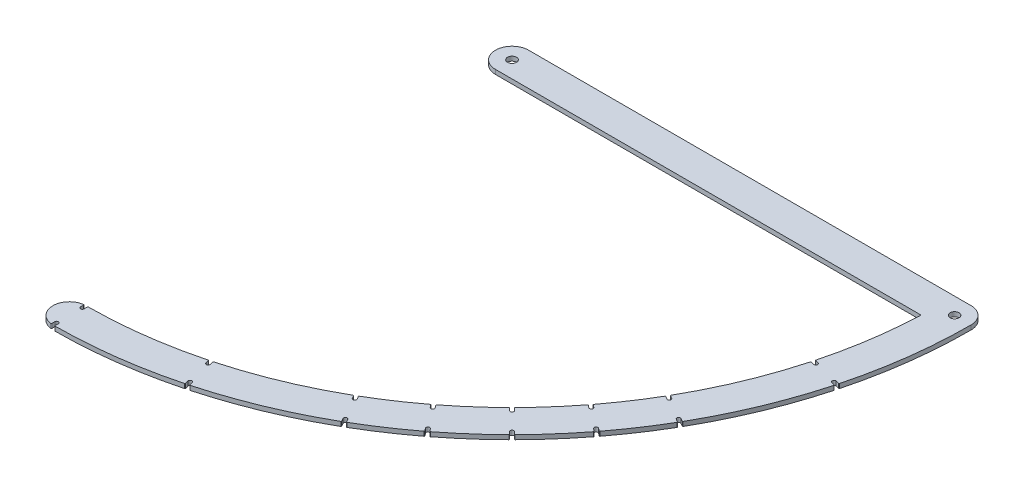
ISO-10303-21;
HEADER;
FILE_DESCRIPTION(('STEP AP214'),'2;1');
FILE_NAME('part.step','',(''),(''),'','','');
FILE_SCHEMA(('AUTOMOTIVE_DESIGN { 1 0 10303 214 1 1 1 1 }'));
ENDSEC;
DATA;
#1=APPLICATION_CONTEXT('core data for automotive mechanical design processes');
#2=APPLICATION_PROTOCOL_DEFINITION('international standard','automotive_design',2000,#1);
#3=PRODUCT_CONTEXT('',#1,'mechanical');
#4=PRODUCT('Part','Part','',(#3));
#5=PRODUCT_RELATED_PRODUCT_CATEGORY('part','',(#4));
#6=PRODUCT_DEFINITION_FORMATION('','',#4);
#7=PRODUCT_DEFINITION_CONTEXT('part definition',#1,'design');
#8=PRODUCT_DEFINITION('design','',#6,#7);
#9=PRODUCT_DEFINITION_SHAPE('','',#8);
#10=(LENGTH_UNIT() NAMED_UNIT(*) SI_UNIT(.MILLI.,.METRE.));
#11=(NAMED_UNIT(*) PLANE_ANGLE_UNIT() SI_UNIT($,.RADIAN.));
#12=(NAMED_UNIT(*) SI_UNIT($,.STERADIAN.) SOLID_ANGLE_UNIT());
#13=UNCERTAINTY_MEASURE_WITH_UNIT(LENGTH_MEASURE(1.E-05),#10,'distance_accuracy_value','');
#14=(GEOMETRIC_REPRESENTATION_CONTEXT(3) GLOBAL_UNCERTAINTY_ASSIGNED_CONTEXT((#13)) GLOBAL_UNIT_ASSIGNED_CONTEXT((#10,
#11,#12)) REPRESENTATION_CONTEXT('',''));
#15=CARTESIAN_POINT('',(0.,0.,0.));
#16=DIRECTION('',(0.,0.,1.));
#17=DIRECTION('',(1.,0.,0.));
#18=AXIS2_PLACEMENT_3D('',#15,#16,#17);
#19=CARTESIAN_POINT('',(1854.31165841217,4.,-1910.37014902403));
#20=DIRECTION('',(0.,1.,0.));
#21=DIRECTION('',(0.,0.,1.));
#22=AXIS2_PLACEMENT_3D('',#19,#20,#21);
#23=PLANE('',#22);
#24=CARTESIAN_POINT('',(1854.31165841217,4.,-1910.37014902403));
#25=DIRECTION('',(0.,1.,0.));
#26=DIRECTION('',(0.,0.,1.));
#27=AXIS2_PLACEMENT_3D('',#24,#25,#26);
#28=CIRCLE('',#27,4.05000000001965);
#29=CARTESIAN_POINT('',(1854.31165841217,4.,-1906.32014902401));
#30=VERTEX_POINT('',#29);
#31=EDGE_CURVE('E1303',#30,#30,#28,.T.);
#32=ORIENTED_EDGE('',*,*,#31,.F.);
#33=EDGE_LOOP('',(#32));
#34=FACE_BOUND('',#33,.T.);
#35=CARTESIAN_POINT('',(1854.31165841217,4.,-1910.37014902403));
#36=DIRECTION('',(0.,1.,0.));
#37=DIRECTION('',(0.,0.,1.));
#38=AXIS2_PLACEMENT_3D('',#35,#36,#37);
#39=CIRCLE('',#38,14.9999999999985);
#40=CARTESIAN_POINT('',(1854.31165841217,4.,-1925.37014902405));
#41=VERTEX_POINT('',#40);
#42=CARTESIAN_POINT('',(1854.31165841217,4.,-1895.37014902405));
#43=VERTEX_POINT('',#42);
#44=EDGE_CURVE('E1567',#41,#43,#39,.T.);
#45=ORIENTED_EDGE('',*,*,#44,.T.);
#46=DIRECTION('',(1.,0.,0.));
#47=VECTOR('',#46,1.);
#48=CARTESIAN_POINT('',(1854.31165841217,4.,-1895.37014902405));
#49=LINE('',#48,#47);
#50=CARTESIAN_POINT('',(2239.0193396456,4.,-1895.37014902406));
#51=VERTEX_POINT('',#50);
#52=EDGE_CURVE('E979',#43,#51,#49,.T.);
#53=ORIENTED_EDGE('',*,*,#52,.T.);
#54=CARTESIAN_POINT('',(1854.31165841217,4.,-1910.37014902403));
#55=DIRECTION('',(0.,1.,0.));
#56=DIRECTION('',(0.,0.,1.));
#57=AXIS2_PLACEMENT_3D('',#54,#55,#56);
#58=CIRCLE('',#57,384.999999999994);
#59=CARTESIAN_POINT('',(2226.73039875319,4.,-1812.75210846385));
#60=VERTEX_POINT('',#59);
#61=EDGE_CURVE('E1797',#60,#51,#58,.T.);
#62=ORIENTED_EDGE('',*,*,#61,.F.);
#63=CARTESIAN_POINT('',(2227.21405945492,4.,-1812.6253317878));
#64=DIRECTION('',(0.,1.,0.));
#65=DIRECTION('',(0.,0.,1.));
#66=AXIS2_PLACEMENT_3D('',#63,#64,#65);
#67=CIRCLE('',#66,0.499999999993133);
#68=CARTESIAN_POINT('',(2227.08464993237,4.,-1812.14236887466));
#69=VERTEX_POINT('',#68);
#70=EDGE_CURVE('E1810',#60,#69,#67,.T.);
#71=ORIENTED_EDGE('',*,*,#70,.T.);
#72=DIRECTION('',(-0.965925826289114,0.,-0.258819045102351));
#73=VECTOR('',#72,1.);
#74=CARTESIAN_POINT('',(2229.89398753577,4.,-1811.38960913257));
#75=LINE('',#74,#73);
#76=CARTESIAN_POINT('',(2229.89398753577,4.,-1811.38960913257));
#77=VERTEX_POINT('',#76);
#78=EDGE_CURVE('E1812',#77,#69,#75,.T.);
#79=ORIENTED_EDGE('',*,*,#78,.F.);
#80=CARTESIAN_POINT('',(2229.47987706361,4.,-1809.8441278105));
#81=DIRECTION('',(0.,1.,0.));
#82=DIRECTION('',(0.,0.,1.));
#83=AXIS2_PLACEMENT_3D('',#80,#81,#82);
#84=CIRCLE('',#83,1.60000000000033);
#85=CARTESIAN_POINT('',(2229.06576659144,4.,-1808.29864648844));
#86=VERTEX_POINT('',#85);
#87=EDGE_CURVE('E1819',#86,#77,#84,.T.);
#88=ORIENTED_EDGE('',*,*,#87,.F.);
#89=DIRECTION('',(-0.965925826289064,0.,-0.258819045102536));
#90=VECTOR('',#89,1.);
#91=CARTESIAN_POINT('',(2229.06576659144,4.,-1808.29864648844));
#92=LINE('',#91,#90);
#93=CARTESIAN_POINT('',(2226.25642898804,4.,-1809.05140623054));
#94=VERTEX_POINT('',#93);
#95=EDGE_CURVE('E1822',#86,#94,#92,.T.);
#96=ORIENTED_EDGE('',*,*,#95,.T.);
#97=CARTESIAN_POINT('',(2226.1270194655,4.,-1808.56844331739));
#98=DIRECTION('',(0.,1.,0.));
#99=DIRECTION('',(0.,0.,1.));
#100=AXIS2_PLACEMENT_3D('',#97,#98,#99);
#101=CIRCLE('',#100,0.4999999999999);
#102=CARTESIAN_POINT('',(2225.64476867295,4.,-1808.70048184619));
#103=VERTEX_POINT('',#102);
#104=EDGE_CURVE('E1824',#94,#103,#101,.T.);
#105=ORIENTED_EDGE('',*,*,#104,.T.);
#106=CARTESIAN_POINT('',(1854.31165841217,4.,-1910.37014902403));
#107=DIRECTION('',(0.,1.,0.));
#108=DIRECTION('',(0.,0.,1.));
#109=AXIS2_PLACEMENT_3D('',#106,#107,#108);
#110=CIRCLE('',#109,384.999999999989);
#111=CARTESIAN_POINT('',(2188.77512985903,4.,-1719.68929978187));
#112=VERTEX_POINT('',#111);
#113=EDGE_CURVE('E1826',#112,#103,#110,.T.);
#114=ORIENTED_EDGE('',*,*,#113,.F.);
#115=CARTESIAN_POINT('',(2189.20949800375,4.,-1719.44166231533));
#116=DIRECTION('',(0.,1.,0.));
#117=DIRECTION('',(0.,0.,1.));
#118=AXIS2_PLACEMENT_3D('',#115,#116,#117);
#119=CIRCLE('',#118,0.499999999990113);
#120=CARTESIAN_POINT('',(2188.95949800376,4.,-1719.00864961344));
#121=VERTEX_POINT('',#120);
#122=EDGE_CURVE('E1829',#112,#121,#119,.T.);
#123=ORIENTED_EDGE('',*,*,#122,.T.);
#124=DIRECTION('',(-0.86602540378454,0.,-0.499999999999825));
#125=VECTOR('',#124,1.);
#126=CARTESIAN_POINT('',(2191.47828119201,4.,-1717.55442946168));
#127=LINE('',#126,#125);
#128=CARTESIAN_POINT('',(2191.47828119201,4.,-1717.55442946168));
#129=VERTEX_POINT('',#128);
#130=EDGE_CURVE('E1831',#129,#121,#127,.T.);
#131=ORIENTED_EDGE('',*,*,#130,.F.);
#132=CARTESIAN_POINT('',(2190.67828119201,4.,-1716.16878881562));
#133=DIRECTION('',(0.,1.,0.));
#134=DIRECTION('',(0.,0.,1.));
#135=AXIS2_PLACEMENT_3D('',#132,#133,#134);
#136=CIRCLE('',#135,1.59999999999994);
#137=CARTESIAN_POINT('',(2189.87828119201,4.,-1714.78314816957));
#138=VERTEX_POINT('',#137);
#139=EDGE_CURVE('E1834',#138,#129,#136,.T.);
#140=ORIENTED_EDGE('',*,*,#139,.F.);
#141=DIRECTION('',(-0.866025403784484,0.,-0.499999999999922));
#142=VECTOR('',#141,1.);
#143=CARTESIAN_POINT('',(2189.87828119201,4.,-1714.78314816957));
#144=LINE('',#143,#142);
#145=CARTESIAN_POINT('',(2187.35949800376,4.,-1716.23736832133));
#146=VERTEX_POINT('',#145);
#147=EDGE_CURVE('E1837',#138,#146,#144,.T.);
#148=ORIENTED_EDGE('',*,*,#147,.T.);
#149=CARTESIAN_POINT('',(2187.10949800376,4.,-1715.80435561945));
#150=DIRECTION('',(0.,1.,0.));
#151=DIRECTION('',(0.,0.,1.));
#152=AXIS2_PLACEMENT_3D('',#149,#150,#151);
#153=CIRCLE('',#152,0.499999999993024);
#154=CARTESIAN_POINT('',(2186.67785359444,4.,-1716.05671073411));
#155=VERTEX_POINT('',#154);
#156=EDGE_CURVE('E1839',#146,#155,#153,.T.);
#157=ORIENTED_EDGE('',*,*,#156,.T.);
#158=CARTESIAN_POINT('',(1854.31165841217,4.,-1910.37014902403));
#159=DIRECTION('',(0.,1.,0.));
#160=DIRECTION('',(0.,0.,1.));
#161=AXIS2_PLACEMENT_3D('',#158,#159,#160);
#162=CIRCLE('',#161,384.999999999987);
#163=CARTESIAN_POINT('',(2161.02490331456,4.,-1677.66435751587));
#164=VERTEX_POINT('',#163);
#165=EDGE_CURVE('E1841',#164,#155,#162,.T.);
#166=ORIENTED_EDGE('',*,*,#165,.F.);
#167=CARTESIAN_POINT('',(2161.42323220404,4.,-1677.3621422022));
#168=DIRECTION('',(0.,1.,0.));
#169=DIRECTION('',(0.,0.,1.));
#170=AXIS2_PLACEMENT_3D('',#167,#168,#169);
#171=CIRCLE('',#170,0.500000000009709);
#172=CARTESIAN_POINT('',(2161.11885148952,4.,-1676.96546553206));
#173=VERTEX_POINT('',#172);
#174=EDGE_CURVE('E1844',#164,#173,#171,.T.);
#175=ORIENTED_EDGE('',*,*,#174,.T.);
#176=DIRECTION('',(-0.79335334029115,0.,-0.608761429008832));
#177=VECTOR('',#176,1.);
#178=CARTESIAN_POINT('',(2163.42627231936,4.,-1675.1949192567));
#179=LINE('',#178,#177);
#180=CARTESIAN_POINT('',(2163.42627231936,4.,-1675.1949192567));
#181=VERTEX_POINT('',#180);
#182=EDGE_CURVE('E1846',#181,#173,#179,.T.);
#183=ORIENTED_EDGE('',*,*,#182,.F.);
#184=CARTESIAN_POINT('',(2162.45225403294,4.,-1673.92555391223));
#185=DIRECTION('',(0.,1.,0.));
#186=DIRECTION('',(0.,0.,1.));
#187=AXIS2_PLACEMENT_3D('',#184,#185,#186);
#188=CIRCLE('',#187,1.59999999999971);
#189=CARTESIAN_POINT('',(2161.47823574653,4.,-1672.65618856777));
#190=VERTEX_POINT('',#189);
#191=EDGE_CURVE('E1849',#190,#181,#188,.T.);
#192=ORIENTED_EDGE('',*,*,#191,.F.);
#193=DIRECTION('',(-0.793353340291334,0.,-0.608761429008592));
#194=VECTOR('',#193,1.);
#195=CARTESIAN_POINT('',(2161.47823574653,4.,-1672.65618856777));
#196=LINE('',#195,#194);
#197=CARTESIAN_POINT('',(2159.17081491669,4.,-1674.42673484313));
#198=VERTEX_POINT('',#197);
#199=EDGE_CURVE('E1852',#190,#198,#196,.T.);
#200=ORIENTED_EDGE('',*,*,#199,.T.);
#201=CARTESIAN_POINT('',(2158.86643420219,4.,-1674.030058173));
#202=DIRECTION('',(0.,1.,0.));
#203=DIRECTION('',(0.,0.,1.));
#204=AXIS2_PLACEMENT_3D('',#201,#202,#203);
#205=CIRCLE('',#204,0.499999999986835);
#206=CARTESIAN_POINT('',(2158.47142152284,4.,-1674.33659525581));
#207=VERTEX_POINT('',#206);
#208=EDGE_CURVE('E1854',#198,#207,#205,.T.);
#209=ORIENTED_EDGE('',*,*,#208,.T.);
#210=CARTESIAN_POINT('',(1854.31165841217,4.,-1910.37014902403));
#211=DIRECTION('',(0.,1.,0.));
#212=DIRECTION('',(0.,0.,1.));
#213=AXIS2_PLACEMENT_3D('',#210,#211,#212);
#214=CIRCLE('',#213,384.999999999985);
#215=CARTESIAN_POINT('',(2128.02672811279,4.,-1639.62107586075));
#216=VERTEX_POINT('',#215);
#217=EDGE_CURVE('E1856',#216,#207,#214,.T.);
#218=ORIENTED_EDGE('',*,*,#217,.F.);
#219=CARTESIAN_POINT('',(2128.38220222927,4.,-1639.26945368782));
#220=DIRECTION('',(0.,1.,0.));
#221=DIRECTION('',(0.,0.,1.));
#222=AXIS2_PLACEMENT_3D('',#219,#220,#221);
#223=CIRCLE('',#222,0.499999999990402);
#224=CARTESIAN_POINT('',(2128.02864883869,4.,-1638.91590029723));
#225=VERTEX_POINT('',#224);
#226=EDGE_CURVE('E1859',#216,#225,#223,.T.);
#227=ORIENTED_EDGE('',*,*,#226,.T.);
#228=DIRECTION('',(-0.707106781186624,0.,-0.707106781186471));
#229=VECTOR('',#228,1.);
#230=CARTESIAN_POINT('',(2130.08522669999,4.,-1636.85932243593));
#231=LINE('',#230,#229);
#232=CARTESIAN_POINT('',(2130.08522669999,4.,-1636.85932243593));
#233=VERTEX_POINT('',#232);
#234=EDGE_CURVE('E1861',#233,#225,#231,.T.);
#235=ORIENTED_EDGE('',*,*,#234,.F.);
#236=CARTESIAN_POINT('',(2128.95385585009,4.,-1635.72795158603));
#237=DIRECTION('',(0.,1.,0.));
#238=DIRECTION('',(0.,0.,1.));
#239=AXIS2_PLACEMENT_3D('',#236,#237,#238);
#240=CIRCLE('',#239,1.59999999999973);
#241=CARTESIAN_POINT('',(2127.8224850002,4.,-1634.59658073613));
#242=VERTEX_POINT('',#241);
#243=EDGE_CURVE('E1864',#242,#233,#240,.T.);
#244=ORIENTED_EDGE('',*,*,#243,.F.);
#245=DIRECTION('',(-0.707106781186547,0.,-0.707106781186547));
#246=VECTOR('',#245,1.);
#247=CARTESIAN_POINT('',(2127.8224850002,4.,-1634.59658073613));
#248=LINE('',#247,#246);
#249=CARTESIAN_POINT('',(2125.76590713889,4.,-1636.65315859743));
#250=VERTEX_POINT('',#249);
#251=EDGE_CURVE('E1867',#242,#250,#248,.T.);
#252=ORIENTED_EDGE('',*,*,#251,.T.);
#253=CARTESIAN_POINT('',(2125.41235374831,4.,-1636.29960520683));
#254=DIRECTION('',(0.,1.,0.));
#255=DIRECTION('',(0.,0.,1.));
#256=AXIS2_PLACEMENT_3D('',#253,#254,#255);
#257=CIRCLE('',#256,0.500000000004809);
#258=CARTESIAN_POINT('',(2125.06073157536,4.,-1636.65507932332));
#259=VERTEX_POINT('',#258);
#260=EDGE_CURVE('E1869',#250,#259,#257,.T.);
#261=ORIENTED_EDGE('',*,*,#260,.T.);
#262=CARTESIAN_POINT('',(1854.31165841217,4.,-1910.37014902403));
#263=DIRECTION('',(0.,1.,0.));
#264=DIRECTION('',(0.,0.,1.));
#265=AXIS2_PLACEMENT_3D('',#262,#263,#264);
#266=CIRCLE('',#265,384.999999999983);
#267=CARTESIAN_POINT('',(2090.34521218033,4.,-1606.21038591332));
#268=VERTEX_POINT('',#267);
#269=EDGE_CURVE('E1871',#268,#259,#266,.T.);
#270=ORIENTED_EDGE('',*,*,#269,.F.);
#271=CARTESIAN_POINT('',(2090.65174926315,4.,-1605.81537323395));
#272=DIRECTION('',(0.,1.,0.));
#273=DIRECTION('',(0.,0.,1.));
#274=AXIS2_PLACEMENT_3D('',#271,#272,#273);
#275=CIRCLE('',#274,0.500000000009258);
#276=CARTESIAN_POINT('',(2090.255072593,4.,-1605.51099251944));
#277=VERTEX_POINT('',#276);
#278=EDGE_CURVE('E1874',#268,#277,#275,.T.);
#279=ORIENTED_EDGE('',*,*,#278,.T.);
#280=DIRECTION('',(-0.608761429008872,0.,-0.793353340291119));
#281=VECTOR('',#280,1.);
#282=CARTESIAN_POINT('',(2092.02561886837,4.,-1603.2035716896));
#283=LINE('',#282,#281);
#284=CARTESIAN_POINT('',(2092.02561886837,4.,-1603.2035716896));
#285=VERTEX_POINT('',#284);
#286=EDGE_CURVE('E1876',#285,#277,#283,.T.);
#287=ORIENTED_EDGE('',*,*,#286,.F.);
#288=CARTESIAN_POINT('',(2090.7562535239,4.,-1602.22955340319));
#289=DIRECTION('',(0.,1.,0.));
#290=DIRECTION('',(0.,0.,1.));
#291=AXIS2_PLACEMENT_3D('',#288,#289,#290);
#292=CIRCLE('',#291,1.6);
#293=CARTESIAN_POINT('',(2089.48688817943,4.,-1601.25553511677));
#294=VERTEX_POINT('',#293);
#295=EDGE_CURVE('E1879',#294,#285,#292,.T.);
#296=ORIENTED_EDGE('',*,*,#295,.F.);
#297=DIRECTION('',(-0.608761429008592,0.,-0.793353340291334));
#298=VECTOR('',#297,1.);
#299=CARTESIAN_POINT('',(2089.48688817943,4.,-1601.25553511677));
#300=LINE('',#299,#298);
#301=CARTESIAN_POINT('',(2087.71634190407,4.,-1603.56295594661));
#302=VERTEX_POINT('',#301);
#303=EDGE_CURVE('E1882',#294,#302,#300,.T.);
#304=ORIENTED_EDGE('',*,*,#303,.T.);
#305=CARTESIAN_POINT('',(2087.31966523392,4.,-1603.25857523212));
#306=DIRECTION('',(0.,1.,0.));
#307=DIRECTION('',(0.,0.,1.));
#308=AXIS2_PLACEMENT_3D('',#305,#306,#307);
#309=CIRCLE('',#308,0.499999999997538);
#310=CARTESIAN_POINT('',(2087.01744992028,4.,-1603.65690412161));
#311=VERTEX_POINT('',#310);
#312=EDGE_CURVE('E1884',#302,#311,#309,.T.);
#313=ORIENTED_EDGE('',*,*,#312,.T.);
#314=CARTESIAN_POINT('',(1854.31165841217,4.,-1910.37014902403));
#315=DIRECTION('',(0.,1.,0.));
#316=DIRECTION('',(0.,0.,1.));
#317=AXIS2_PLACEMENT_3D('',#314,#315,#316);
#318=CIRCLE('',#317,384.999999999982);
#319=CARTESIAN_POINT('',(2048.62509670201,4.,-1578.00395384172));
#320=VERTEX_POINT('',#319);
#321=EDGE_CURVE('E1886',#320,#311,#318,.T.);
#322=ORIENTED_EDGE('',*,*,#321,.F.);
#323=CARTESIAN_POINT('',(2048.8774518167,4.,-1577.57230943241));
#324=DIRECTION('',(0.,1.,0.));
#325=DIRECTION('',(0.,0.,1.));
#326=AXIS2_PLACEMENT_3D('',#323,#324,#325);
#327=CIRCLE('',#326,0.499999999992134);
#328=CARTESIAN_POINT('',(2048.44443911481,4.,-1577.32230943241));
#329=VERTEX_POINT('',#328);
#330=EDGE_CURVE('E1889',#320,#329,#327,.T.);
#331=ORIENTED_EDGE('',*,*,#330,.T.);
#332=DIRECTION('',(-0.500000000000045,0.,-0.866025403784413));
#333=VECTOR('',#332,1.);
#334=CARTESIAN_POINT('',(2049.89865926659,4.,-1574.80352624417));
#335=LINE('',#334,#333);
#336=CARTESIAN_POINT('',(2049.89865926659,4.,-1574.80352624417));
#337=VERTEX_POINT('',#336);
#338=EDGE_CURVE('E1891',#337,#329,#335,.T.);
#339=ORIENTED_EDGE('',*,*,#338,.F.);
#340=CARTESIAN_POINT('',(2048.51165841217,4.,-1574.00588219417));
#341=DIRECTION('',(0.,1.,0.));
#342=DIRECTION('',(0.,0.,1.));
#343=AXIS2_PLACEMENT_3D('',#340,#341,#342);
#344=CIRCLE('',#343,1.60000231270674);
#345=CARTESIAN_POINT('',(2047.12737797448,4.,-1573.20352624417));
#346=VERTEX_POINT('',#345);
#347=EDGE_CURVE('E1894',#346,#337,#344,.T.);
#348=ORIENTED_EDGE('',*,*,#347,.F.);
#349=DIRECTION('',(-0.499999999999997,0.,-0.866025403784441));
#350=VECTOR('',#349,1.);
#351=CARTESIAN_POINT('',(2047.12737797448,4.,-1573.20352624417));
#352=LINE('',#351,#350);
#353=CARTESIAN_POINT('',(2045.67315782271,4.,-1575.72230943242));
#354=VERTEX_POINT('',#353);
#355=EDGE_CURVE('E1897',#346,#354,#352,.T.);
#356=ORIENTED_EDGE('',*,*,#355,.T.);
#357=CARTESIAN_POINT('',(2045.24014512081,4.,-1575.47230943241));
#358=DIRECTION('',(0.,1.,0.));
#359=DIRECTION('',(0.,0.,1.));
#360=AXIS2_PLACEMENT_3D('',#357,#358,#359);
#361=CIRCLE('',#360,0.500000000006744);
#362=CARTESIAN_POINT('',(2044.99250765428,4.,-1575.90667757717));
#363=VERTEX_POINT('',#362);
#364=EDGE_CURVE('E1899',#354,#363,#361,.T.);
#365=ORIENTED_EDGE('',*,*,#364,.T.);
#366=CARTESIAN_POINT('',(1854.31165841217,4.,-1910.37014902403));
#367=DIRECTION('',(0.,1.,0.));
#368=DIRECTION('',(0.,0.,1.));
#369=AXIS2_PLACEMENT_3D('',#366,#367,#368);
#370=CIRCLE('',#369,384.999999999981);
#371=CARTESIAN_POINT('',(1955.9813255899,4.,-1539.03703876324));
#372=VERTEX_POINT('',#371);
#373=EDGE_CURVE('E1901',#372,#363,#370,.T.);
#374=ORIENTED_EDGE('',*,*,#373,.F.);
#375=CARTESIAN_POINT('',(1956.11336411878,4.,-1538.55478797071));
#376=DIRECTION('',(0.,1.,0.));
#377=DIRECTION('',(0.,0.,1.));
#378=AXIS2_PLACEMENT_3D('',#375,#376,#377);
#379=CIRCLE('',#378,0.500000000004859);
#380=CARTESIAN_POINT('',(1955.63040120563,4.,-1538.42537844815));
#381=VERTEX_POINT('',#380);
#382=EDGE_CURVE('E1904',#372,#381,#379,.T.);
#383=ORIENTED_EDGE('',*,*,#382,.T.);
#384=DIRECTION('',(-0.258819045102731,0.,-0.965925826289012));
#385=VECTOR('',#384,1.);
#386=CARTESIAN_POINT('',(1956.38316094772,4.,-1535.61604084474));
#387=LINE('',#386,#385);
#388=CARTESIAN_POINT('',(1956.38316094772,4.,-1535.61604084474));
#389=VERTEX_POINT('',#388);
#390=EDGE_CURVE('E1906',#389,#381,#387,.T.);
#391=ORIENTED_EDGE('',*,*,#390,.F.);
#392=CARTESIAN_POINT('',(1954.83697553,4.,-1535.20455809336));
#393=DIRECTION('',(0.,1.,0.));
#394=DIRECTION('',(0.,0.,1.));
#395=AXIS2_PLACEMENT_3D('',#392,#393,#394);
#396=CIRCLE('',#395,1.60000231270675);
#397=CARTESIAN_POINT('',(1953.2921983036,4.,-1534.78781990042));
#398=VERTEX_POINT('',#397);
#399=EDGE_CURVE('E1909',#398,#389,#396,.T.);
#400=ORIENTED_EDGE('',*,*,#399,.F.);
#401=DIRECTION('',(-0.258819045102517,0.,-0.965925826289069));
#402=VECTOR('',#401,1.);
#403=CARTESIAN_POINT('',(1953.2921983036,4.,-1534.78781990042));
#404=LINE('',#403,#402);
#405=CARTESIAN_POINT('',(1952.5394385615,4.,-1537.59715750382));
#406=VERTEX_POINT('',#405);
#407=EDGE_CURVE('E1912',#398,#406,#404,.T.);
#408=ORIENTED_EDGE('',*,*,#407,.T.);
#409=CARTESIAN_POINT('',(1952.05647564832,4.,-1537.46774798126));
#410=DIRECTION('',(0.,1.,0.));
#411=DIRECTION('',(0.,0.,1.));
#412=AXIS2_PLACEMENT_3D('',#409,#410,#411);
#413=CIRCLE('',#412,0.500000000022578);
#414=CARTESIAN_POINT('',(1951.92969897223,4.,-1537.95140868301));
#415=VERTEX_POINT('',#414);
#416=EDGE_CURVE('E1914',#406,#415,#413,.T.);
#417=ORIENTED_EDGE('',*,*,#416,.T.);
#418=CARTESIAN_POINT('',(1854.31165841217,4.,-1910.37014902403));
#419=DIRECTION('',(0.,1.,0.));
#420=DIRECTION('',(0.,0.,1.));
#421=AXIS2_PLACEMENT_3D('',#418,#419,#420);
#422=CIRCLE('',#421,384.99999999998);
#423=CARTESIAN_POINT('',(1856.40893467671,4.,-1525.37586149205));
#424=VERTEX_POINT('',#423);
#425=EDGE_CURVE('E1916',#424,#415,#422,.T.);
#426=ORIENTED_EDGE('',*,*,#425,.F.);
#427=CARTESIAN_POINT('',(1856.41165841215,4.,-1524.87586891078));
#428=DIRECTION('',(0.,1.,0.));
#429=DIRECTION('',(0.,0.,1.));
#430=AXIS2_PLACEMENT_3D('',#427,#428,#429);
#431=CIRCLE('',#430,0.500000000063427);
#432=CARTESIAN_POINT('',(1855.91165841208,4.,-1524.87586891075));
#433=VERTEX_POINT('',#432);
#434=EDGE_CURVE('E1919',#424,#433,#431,.T.);
#435=ORIENTED_EDGE('',*,*,#434,.T.);
#436=DIRECTION('',(3.05379628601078E-13,0.,-1.));
#437=VECTOR('',#436,1.);
#438=CARTESIAN_POINT('',(1855.91165841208,4.,-1521.96742860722));
#439=LINE('',#438,#437);
#440=CARTESIAN_POINT('',(1855.91165841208,4.,-1521.96742860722));
#441=VERTEX_POINT('',#440);
#442=EDGE_CURVE('E1921',#441,#433,#439,.T.);
#443=ORIENTED_EDGE('',*,*,#442,.F.);
#444=CARTESIAN_POINT('',(1854.31165841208,4.,-1521.97014902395));
#445=DIRECTION('',(0.,1.,0.));
#446=DIRECTION('',(0.,0.,1.));
#447=AXIS2_PLACEMENT_3D('',#444,#445,#446);
#448=CIRCLE('',#447,1.60000231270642);
#449=CARTESIAN_POINT('',(1852.71165841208,4.,-1521.96742860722));
#450=VERTEX_POINT('',#449);
#451=EDGE_CURVE('E1924',#450,#441,#448,.T.);
#452=ORIENTED_EDGE('',*,*,#451,.F.);
#453=DIRECTION('',(0.,0.,-1.));
#454=VECTOR('',#453,1.);
#455=CARTESIAN_POINT('',(1852.71165841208,4.,-1521.96742860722));
#456=LINE('',#455,#454);
#457=CARTESIAN_POINT('',(1852.71165841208,4.,-1524.71727417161));
#458=VERTEX_POINT('',#457);
#459=EDGE_CURVE('E1927',#450,#458,#456,.T.);
#460=ORIENTED_EDGE('',*,*,#459,.T.);
#461=CARTESIAN_POINT('',(1852.21165841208,4.,-1524.71727417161));
#462=DIRECTION('',(0.,1.,0.));
#463=DIRECTION('',(0.,0.,1.));
#464=AXIS2_PLACEMENT_3D('',#461,#462,#463);
#465=CIRCLE('',#464,0.500000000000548);
#466=CARTESIAN_POINT('',(1852.13924461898,4.,-1525.21200262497));
#467=VERTEX_POINT('',#466);
#468=EDGE_CURVE('E1929',#458,#467,#465,.T.);
#469=ORIENTED_EDGE('',*,*,#468,.T.);
#470=CARTESIAN_POINT('',(1854.31165841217,4.,-1510.37014902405));
#471=DIRECTION('',(0.,1.,0.));
#472=DIRECTION('',(0.,0.,1.));
#473=AXIS2_PLACEMENT_3D('',#470,#471,#472);
#474=CIRCLE('',#473,14.9999999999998);
#475=CARTESIAN_POINT('',(1852.13924461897,4.,-1495.52829542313));
#476=VERTEX_POINT('',#475);
#477=EDGE_CURVE('E1931',#467,#476,#474,.T.);
#478=ORIENTED_EDGE('',*,*,#477,.T.);
#479=CARTESIAN_POINT('',(1852.21165841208,4.,-1496.0230238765));
#480=DIRECTION('',(0.,1.,0.));
#481=DIRECTION('',(0.,0.,1.));
#482=AXIS2_PLACEMENT_3D('',#479,#480,#481);
#483=CIRCLE('',#482,0.499999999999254);
#484=CARTESIAN_POINT('',(1852.71165841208,4.,-1496.0230238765));
#485=VERTEX_POINT('',#484);
#486=EDGE_CURVE('E1933',#476,#485,#483,.T.);
#487=ORIENTED_EDGE('',*,*,#486,.T.);
#488=DIRECTION('',(0.,0.,1.));
#489=VECTOR('',#488,1.);
#490=CARTESIAN_POINT('',(1852.71165841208,4.,-1498.77286944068));
#491=LINE('',#490,#489);
#492=CARTESIAN_POINT('',(1852.71165841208,4.,-1498.77286944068));
#493=VERTEX_POINT('',#492);
#494=EDGE_CURVE('E1935',#493,#485,#491,.T.);
#495=ORIENTED_EDGE('',*,*,#494,.F.);
#496=CARTESIAN_POINT('',(1854.31165841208,4.,-1498.77286944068));
#497=DIRECTION('',(0.,1.,0.));
#498=DIRECTION('',(0.,0.,1.));
#499=AXIS2_PLACEMENT_3D('',#496,#497,#498);
#500=CIRCLE('',#499,1.60000000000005);
#501=CARTESIAN_POINT('',(1855.91165841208,4.,-1498.77286944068));
#502=VERTEX_POINT('',#501);
#503=EDGE_CURVE('E1938',#502,#493,#500,.T.);
#504=ORIENTED_EDGE('',*,*,#503,.F.);
#505=DIRECTION('',(0.,0.,1.));
#506=VECTOR('',#505,1.);
#507=CARTESIAN_POINT('',(1855.91165841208,4.,-1498.77286944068));
#508=LINE('',#507,#506);
#509=CARTESIAN_POINT('',(1855.91165841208,4.,-1495.87546872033));
#510=VERTEX_POINT('',#509);
#511=EDGE_CURVE('E1941',#502,#510,#508,.T.);
#512=ORIENTED_EDGE('',*,*,#511,.T.);
#513=CARTESIAN_POINT('',(1856.41165841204,4.,-1495.87546872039));
#514=DIRECTION('',(0.,1.,0.));
#515=DIRECTION('',(0.,0.,1.));
#516=AXIS2_PLACEMENT_3D('',#513,#514,#515);
#517=CIRCLE('',#516,0.499999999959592);
#518=CARTESIAN_POINT('',(1856.4141915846,4.,-1495.37547513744));
#519=VERTEX_POINT('',#518);
#520=EDGE_CURVE('E1943',#510,#519,#517,.T.);
#521=ORIENTED_EDGE('',*,*,#520,.T.);
#522=CARTESIAN_POINT('',(1854.31165841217,4.,-1910.37014902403));
#523=DIRECTION('',(0.,1.,0.));
#524=DIRECTION('',(0.,0.,1.));
#525=AXIS2_PLACEMENT_3D('',#522,#523,#524);
#526=CIRCLE('',#525,414.99999999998);
#527=CARTESIAN_POINT('',(1959.6892925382,4.,-1508.97190011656));
#528=VERTEX_POINT('',#527);
#529=EDGE_CURVE('E1945',#519,#528,#526,.T.);
#530=ORIENTED_EDGE('',*,*,#529,.T.);
#531=CARTESIAN_POINT('',(1959.56233153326,4.,-1509.45551246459));
#532=DIRECTION('',(0.,1.,0.));
#533=DIRECTION('',(0.,0.,1.));
#534=AXIS2_PLACEMENT_3D('',#531,#532,#533);
#535=CIRCLE('',#534,0.499999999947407);
#536=CARTESIAN_POINT('',(1960.04529444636,4.,-1509.58492198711));
#537=VERTEX_POINT('',#536);
#538=EDGE_CURVE('E1947',#528,#537,#535,.T.);
#539=ORIENTED_EDGE('',*,*,#538,.T.);
#540=DIRECTION('',(0.258819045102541,0.,0.965925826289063));
#541=VECTOR('',#540,1.);
#542=CARTESIAN_POINT('',(1959.29539195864,4.,-1512.38359617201));
#543=LINE('',#542,#541);
#544=CARTESIAN_POINT('',(1959.29539195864,4.,-1512.38359617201));
#545=VERTEX_POINT('',#544);
#546=EDGE_CURVE('E1949',#545,#537,#543,.T.);
#547=ORIENTED_EDGE('',*,*,#546,.F.);
#548=CARTESIAN_POINT('',(1960.84087328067,4.,-1512.79770664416));
#549=DIRECTION('',(0.,1.,0.));
#550=DIRECTION('',(0.,0.,1.));
#551=AXIS2_PLACEMENT_3D('',#548,#549,#550);
#552=CIRCLE('',#551,1.59999999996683);
#553=CARTESIAN_POINT('',(1962.3863546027,4.,-1513.21181711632));
#554=VERTEX_POINT('',#553);
#555=EDGE_CURVE('E1952',#554,#545,#552,.T.);
#556=ORIENTED_EDGE('',*,*,#555,.F.);
#557=DIRECTION('',(0.258819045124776,0.,0.965925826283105));
#558=VECTOR('',#557,1.);
#559=CARTESIAN_POINT('',(1962.3863546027,4.,-1513.21181711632));
#560=LINE('',#559,#558);
#561=CARTESIAN_POINT('',(1963.13625709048,4.,-1510.41314293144));
#562=VERTEX_POINT('',#561);
#563=EDGE_CURVE('E1955',#554,#562,#560,.T.);
#564=ORIENTED_EDGE('',*,*,#563,.T.);
#565=CARTESIAN_POINT('',(1963.61922000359,4.,-1510.54255245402));
#566=DIRECTION('',(0.,1.,0.));
#567=DIRECTION('',(0.,0.,1.));
#568=AXIS2_PLACEMENT_3D('',#565,#566,#567);
#569=CIRCLE('',#568,0.499999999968);
#570=CARTESIAN_POINT('',(1963.75107472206,4.,-1510.06025137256));
#571=VERTEX_POINT('',#570);
#572=EDGE_CURVE('E1957',#562,#571,#569,.T.);
#573=ORIENTED_EDGE('',*,*,#572,.T.);
#574=CARTESIAN_POINT('',(1854.31165841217,4.,-1910.37014902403));
#575=DIRECTION('',(0.,1.,0.));
#576=DIRECTION('',(0.,0.,1.));
#577=AXIS2_PLACEMENT_3D('',#574,#575,#576);
#578=CIRCLE('',#577,414.999999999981);
#579=CARTESIAN_POINT('',(2059.98814821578,4.,-1549.92295241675));
#580=VERTEX_POINT('',#579);
#581=EDGE_CURVE('E1959',#571,#580,#578,.T.);
#582=ORIENTED_EDGE('',*,*,#581,.T.);
#583=CARTESIAN_POINT('',(2059.74034521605,4.,-1550.35722614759));
#584=DIRECTION('',(0.,1.,0.));
#585=DIRECTION('',(0.,0.,1.));
#586=AXIS2_PLACEMENT_3D('',#583,#584,#585);
#587=CIRCLE('',#586,0.499999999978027);
#588=CARTESIAN_POINT('',(2060.17335791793,4.,-1550.60722614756));
#589=VERTEX_POINT('',#588);
#590=EDGE_CURVE('E1961',#580,#589,#587,.T.);
#591=ORIENTED_EDGE('',*,*,#590,.T.);
#592=DIRECTION('',(0.500000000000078,0.,0.866025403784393));
#593=VECTOR('',#592,1.);
#594=CARTESIAN_POINT('',(2058.72465755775,4.,-1553.11644877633));
#595=LINE('',#594,#593);
#596=CARTESIAN_POINT('',(2058.72465755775,4.,-1553.11644877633));
#597=VERTEX_POINT('',#596);
#598=EDGE_CURVE('E1963',#597,#589,#595,.T.);
#599=ORIENTED_EDGE('',*,*,#598,.F.);
#600=CARTESIAN_POINT('',(2060.11029820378,4.,-1553.91644877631));
#601=DIRECTION('',(0.,1.,0.));
#602=DIRECTION('',(0.,0.,1.));
#603=AXIS2_PLACEMENT_3D('',#600,#601,#602);
#604=CIRCLE('',#603,1.59999999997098);
#605=CARTESIAN_POINT('',(2061.49593884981,4.,-1554.7164487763));
#606=VERTEX_POINT('',#605);
#607=EDGE_CURVE('E1966',#606,#597,#604,.T.);
#608=ORIENTED_EDGE('',*,*,#607,.F.);
#609=DIRECTION('',(0.499999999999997,0.,0.866025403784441));
#610=VECTOR('',#609,1.);
#611=CARTESIAN_POINT('',(2061.49593884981,4.,-1554.7164487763));
#612=LINE('',#611,#610);
#613=CARTESIAN_POINT('',(2062.94463920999,4.,-1552.20722614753));
#614=VERTEX_POINT('',#613);
#615=EDGE_CURVE('E1969',#606,#614,#612,.T.);
#616=ORIENTED_EDGE('',*,*,#615,.T.);
#617=CARTESIAN_POINT('',(2063.37765191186,4.,-1552.45722614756));
#618=DIRECTION('',(0.,1.,0.));
#619=DIRECTION('',(0.,0.,1.));
#620=AXIS2_PLACEMENT_3D('',#617,#618,#619);
#621=CIRCLE('',#620,0.499999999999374);
#622=CARTESIAN_POINT('',(2063.62984249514,4.,-1552.02548558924));
#623=VERTEX_POINT('',#622);
#624=EDGE_CURVE('E1971',#614,#623,#621,.T.);
#625=ORIENTED_EDGE('',*,*,#624,.T.);
#626=CARTESIAN_POINT('',(1854.31165841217,4.,-1910.37014902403));
#627=DIRECTION('',(0.,1.,0.));
#628=DIRECTION('',(0.,0.,1.));
#629=AXIS2_PLACEMENT_3D('',#626,#627,#628);
#630=CIRCLE('',#629,414.999999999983);
#631=CARTESIAN_POINT('',(2105.27635740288,4.,-1579.85279719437));
#632=VERTEX_POINT('',#631);
#633=EDGE_CURVE('E1973',#623,#632,#630,.T.);
#634=ORIENTED_EDGE('',*,*,#633,.T.);
#635=CARTESIAN_POINT('',(2104.97399029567,4.,-1580.25101087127));
#636=DIRECTION('',(0.,1.,0.));
#637=DIRECTION('',(0.,0.,1.));
#638=AXIS2_PLACEMENT_3D('',#635,#636,#637);
#639=CIRCLE('',#638,0.499999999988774);
#640=CARTESIAN_POINT('',(2105.37066696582,4.,-1580.55539158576));
#641=VERTEX_POINT('',#640);
#642=EDGE_CURVE('E1975',#632,#641,#639,.T.);
#643=ORIENTED_EDGE('',*,*,#642,.T.);
#644=DIRECTION('',(0.608761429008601,0.,0.793353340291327));
#645=VECTOR('',#644,1.);
#646=CARTESIAN_POINT('',(2103.60684116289,4.,-1582.85405412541));
#647=LINE('',#646,#645);
#648=CARTESIAN_POINT('',(2103.60684116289,4.,-1582.85405412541));
#649=VERTEX_POINT('',#648);
#650=EDGE_CURVE('E1977',#649,#641,#647,.T.);
#651=ORIENTED_EDGE('',*,*,#650,.F.);
#652=CARTESIAN_POINT('',(2104.87620650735,4.,-1583.82807241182));
#653=DIRECTION('',(0.,1.,0.));
#654=DIRECTION('',(0.,0.,1.));
#655=AXIS2_PLACEMENT_3D('',#652,#653,#654);
#656=CIRCLE('',#655,1.5999999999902);
#657=CARTESIAN_POINT('',(2106.1455718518,4.,-1584.80209069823));
#658=VERTEX_POINT('',#657);
#659=EDGE_CURVE('E1980',#658,#649,#656,.T.);
#660=ORIENTED_EDGE('',*,*,#659,.F.);
#661=DIRECTION('',(0.608761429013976,0.,0.793353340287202));
#662=VECTOR('',#661,1.);
#663=CARTESIAN_POINT('',(2106.1455718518,4.,-1584.80209069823));
#664=LINE('',#663,#662);
#665=CARTESIAN_POINT('',(2107.90939765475,4.,-1582.50342815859));
#666=VERTEX_POINT('',#665);
#667=EDGE_CURVE('E1983',#658,#666,#664,.T.);
#668=ORIENTED_EDGE('',*,*,#667,.T.);
#669=CARTESIAN_POINT('',(2108.30607432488,4.,-1582.80780887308));
#670=DIRECTION('',(0.,1.,0.));
#671=DIRECTION('',(0.,0.,1.));
#672=AXIS2_PLACEMENT_3D('',#669,#670,#671);
#673=CIRCLE('',#672,0.499999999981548);
#674=CARTESIAN_POINT('',(2108.61246083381,4.,-1582.41267939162));
#675=VERTEX_POINT('',#674);
#676=EDGE_CURVE('E1985',#666,#675,#673,.T.);
#677=ORIENTED_EDGE('',*,*,#676,.T.);
#678=CARTESIAN_POINT('',(1854.31165841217,4.,-1910.37014902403));
#679=DIRECTION('',(0.,1.,0.));
#680=DIRECTION('',(0.,0.,1.));
#681=AXIS2_PLACEMENT_3D('',#678,#679,#680);
#682=CIRCLE('',#681,414.999999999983);
#683=CARTESIAN_POINT('',(2146.2704910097,4.,-1615.43788549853));
#684=VERTEX_POINT('',#683);
#685=EDGE_CURVE('E1987',#675,#684,#682,.T.);
#686=ORIENTED_EDGE('',*,*,#685,.T.);
#687=CARTESIAN_POINT('',(2145.91873338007,4.,-1615.79322557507));
#688=DIRECTION('',(0.,1.,0.));
#689=DIRECTION('',(0.,0.,1.));
#690=AXIS2_PLACEMENT_3D('',#687,#688,#689);
#691=CIRCLE('',#690,0.49999999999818);
#692=CARTESIAN_POINT('',(2146.27228677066,4.,-1616.14677896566));
#693=VERTEX_POINT('',#692);
#694=EDGE_CURVE('E1989',#684,#693,#691,.T.);
#695=ORIENTED_EDGE('',*,*,#694,.T.);
#696=DIRECTION('',(0.707106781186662,0.,0.707106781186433));
#697=VECTOR('',#696,1.);
#698=CARTESIAN_POINT('',(2144.22351507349,4.,-1618.19555066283));
#699=LINE('',#698,#697);
#700=CARTESIAN_POINT('',(2144.22351507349,4.,-1618.19555066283));
#701=VERTEX_POINT('',#700);
#702=EDGE_CURVE('E1991',#701,#693,#699,.T.);
#703=ORIENTED_EDGE('',*,*,#702,.F.);
#704=CARTESIAN_POINT('',(2145.3548859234,4.,-1619.32692151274));
#705=DIRECTION('',(0.,1.,0.));
#706=DIRECTION('',(0.,0.,1.));
#707=AXIS2_PLACEMENT_3D('',#704,#705,#706);
#708=CIRCLE('',#707,1.60000000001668);
#709=CARTESIAN_POINT('',(2146.48625677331,4.,-1620.45829236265));
#710=VERTEX_POINT('',#709);
#711=EDGE_CURVE('E1994',#710,#701,#708,.T.);
#712=ORIENTED_EDGE('',*,*,#711,.F.);
#713=DIRECTION('',(0.707106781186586,0.,0.707106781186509));
#714=VECTOR('',#713,1.);
#715=CARTESIAN_POINT('',(2146.48625677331,4.,-1620.45829236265));
#716=LINE('',#715,#714);
#717=CARTESIAN_POINT('',(2148.53502847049,4.,-1618.40952066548));
#718=VERTEX_POINT('',#717);
#719=EDGE_CURVE('E1997',#710,#718,#716,.T.);
#720=ORIENTED_EDGE('',*,*,#719,.T.);
#721=CARTESIAN_POINT('',(2148.88858186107,4.,-1618.76307405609));
#722=DIRECTION('',(0.,1.,0.));
#723=DIRECTION('',(0.,0.,1.));
#724=AXIS2_PLACEMENT_3D('',#721,#722,#723);
#725=CIRCLE('',#724,0.500000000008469);
#726=CARTESIAN_POINT('',(2149.24392193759,4.,-1618.41131642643));
#727=VERTEX_POINT('',#726);
#728=EDGE_CURVE('E1999',#718,#727,#725,.T.);
#729=ORIENTED_EDGE('',*,*,#728,.T.);
#730=CARTESIAN_POINT('',(1854.31165841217,4.,-1910.37014902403));
#731=DIRECTION('',(0.,1.,0.));
#732=DIRECTION('',(0.,0.,1.));
#733=AXIS2_PLACEMENT_3D('',#730,#731,#732);
#734=CIRCLE('',#733,414.999999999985);
#735=CARTESIAN_POINT('',(2182.26912804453,4.,-1656.06934660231));
#736=VERTEX_POINT('',#735);
#737=EDGE_CURVE('E2001',#727,#736,#734,.T.);
#738=ORIENTED_EDGE('',*,*,#737,.T.);
#739=CARTESIAN_POINT('',(2181.87399856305,4.,-1656.37573311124));
#740=DIRECTION('',(0.,1.,0.));
#741=DIRECTION('',(0.,0.,1.));
#742=AXIS2_PLACEMENT_3D('',#739,#740,#741);
#743=CIRCLE('',#742,0.499999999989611);
#744=CARTESIAN_POINT('',(2182.17837927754,4.,-1656.77240978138));
#745=VERTEX_POINT('',#744);
#746=EDGE_CURVE('E2003',#736,#745,#743,.T.);
#747=ORIENTED_EDGE('',*,*,#746,.T.);
#748=DIRECTION('',(0.793353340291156,0.,0.608761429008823));
#749=VECTOR('',#748,1.);
#750=CARTESIAN_POINT('',(2179.87971673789,4.,-1658.53623558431));
#751=LINE('',#750,#749);
#752=CARTESIAN_POINT('',(2179.87971673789,4.,-1658.53623558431));
#753=VERTEX_POINT('',#752);
#754=EDGE_CURVE('E2005',#753,#745,#751,.T.);
#755=ORIENTED_EDGE('',*,*,#754,.F.);
#756=CARTESIAN_POINT('',(2180.85373502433,4.,-1659.8056009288));
#757=DIRECTION('',(0.,1.,0.));
#758=DIRECTION('',(0.,0.,1.));
#759=AXIS2_PLACEMENT_3D('',#756,#757,#758);
#760=CIRCLE('',#759,1.60000000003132);
#761=CARTESIAN_POINT('',(2181.82775331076,4.,-1661.07496627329));
#762=VERTEX_POINT('',#761);
#763=EDGE_CURVE('E2008',#762,#753,#760,.T.);
#764=ORIENTED_EDGE('',*,*,#763,.F.);
#765=DIRECTION('',(0.793353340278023,0.,0.608761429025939));
#766=VECTOR('',#765,1.);
#767=CARTESIAN_POINT('',(2181.82775331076,4.,-1661.07496627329));
#768=LINE('',#767,#766);
#769=CARTESIAN_POINT('',(2184.12641585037,4.,-1659.31114047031));
#770=VERTEX_POINT('',#769);
#771=EDGE_CURVE('E2011',#762,#770,#768,.T.);
#772=ORIENTED_EDGE('',*,*,#771,.T.);
#773=CARTESIAN_POINT('',(2184.43079656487,4.,-1659.70781714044));
#774=DIRECTION('',(0.,1.,0.));
#775=DIRECTION('',(0.,0.,1.));
#776=AXIS2_PLACEMENT_3D('',#773,#774,#775);
#777=CIRCLE('',#776,0.499999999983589);
#778=CARTESIAN_POINT('',(2184.82901024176,4.,-1659.40545003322));
#779=VERTEX_POINT('',#778);
#780=EDGE_CURVE('E2013',#770,#779,#777,.T.);
#781=ORIENTED_EDGE('',*,*,#780,.T.);
#782=CARTESIAN_POINT('',(1854.31165841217,4.,-1910.37014902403));
#783=DIRECTION('',(0.,1.,0.));
#784=DIRECTION('',(0.,0.,1.));
#785=AXIS2_PLACEMENT_3D('',#782,#783,#784);
#786=CIRCLE('',#785,414.999999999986);
#787=CARTESIAN_POINT('',(2212.65632184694,4.,-1701.05196494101));
#788=VERTEX_POINT('',#787);
#789=EDGE_CURVE('E2015',#779,#788,#786,.T.);
#790=ORIENTED_EDGE('',*,*,#789,.T.);
#791=CARTESIAN_POINT('',(2212.22458128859,4.,-1701.30415552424));
#792=DIRECTION('',(0.,1.,0.));
#793=DIRECTION('',(0.,0.,1.));
#794=AXIS2_PLACEMENT_3D('',#791,#792,#793);
#795=CIRCLE('',#794,0.499999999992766);
#796=CARTESIAN_POINT('',(2212.47458128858,4.,-1701.73716822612));
#797=VERTEX_POINT('',#796);
#798=EDGE_CURVE('E2017',#788,#797,#795,.T.);
#799=ORIENTED_EDGE('',*,*,#798,.T.);
#800=DIRECTION('',(0.866025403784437,0.,0.500000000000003));
#801=VECTOR('',#800,1.);
#802=CARTESIAN_POINT('',(2209.96535865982,4.,-1703.1858685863));
#803=LINE('',#802,#801);
#804=CARTESIAN_POINT('',(2209.96535865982,4.,-1703.1858685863));
#805=VERTEX_POINT('',#804);
#806=EDGE_CURVE('E2019',#805,#797,#803,.T.);
#807=ORIENTED_EDGE('',*,*,#806,.F.);
#808=CARTESIAN_POINT('',(2210.76535865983,4.,-1704.57150923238));
#809=DIRECTION('',(0.,1.,0.));
#810=DIRECTION('',(0.,0.,1.));
#811=AXIS2_PLACEMENT_3D('',#808,#809,#810);
#812=CIRCLE('',#811,1.60000000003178);
#813=CARTESIAN_POINT('',(2211.56535865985,4.,-1705.95714987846));
#814=VERTEX_POINT('',#813);
#815=EDGE_CURVE('E2022',#814,#805,#812,.T.);
#816=ORIENTED_EDGE('',*,*,#815,.F.);
#817=DIRECTION('',(0.866025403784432,0.,0.500000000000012));
#818=VECTOR('',#817,1.);
#819=CARTESIAN_POINT('',(2211.56535865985,4.,-1705.95714987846));
#820=LINE('',#819,#818);
#821=CARTESIAN_POINT('',(2214.07458128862,4.,-1704.50844951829));
#822=VERTEX_POINT('',#821);
#823=EDGE_CURVE('E2025',#814,#822,#820,.T.);
#824=ORIENTED_EDGE('',*,*,#823,.T.);
#825=CARTESIAN_POINT('',(2214.3245812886,4.,-1704.9414622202));
#826=DIRECTION('',(0.,1.,0.));
#827=DIRECTION('',(0.,0.,1.));
#828=AXIS2_PLACEMENT_3D('',#825,#826,#827);
#829=CIRCLE('',#828,0.500000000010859);
#830=CARTESIAN_POINT('',(2214.75885501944,4.,-1704.69365922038));
#831=VERTEX_POINT('',#830);
#832=EDGE_CURVE('E2027',#822,#831,#829,.T.);
#833=ORIENTED_EDGE('',*,*,#832,.T.);
#834=CARTESIAN_POINT('',(1854.31165841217,4.,-1910.37014902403));
#835=DIRECTION('',(0.,1.,0.));
#836=DIRECTION('',(0.,0.,1.));
#837=AXIS2_PLACEMENT_3D('',#834,#835,#836);
#838=CIRCLE('',#837,414.999999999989);
#839=CARTESIAN_POINT('',(2254.62155606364,4.,-1800.93073271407));
#840=VERTEX_POINT('',#839);
#841=EDGE_CURVE('E2029',#831,#840,#838,.T.);
#842=ORIENTED_EDGE('',*,*,#841,.T.);
#843=CARTESIAN_POINT('',(2254.13925498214,4.,-1801.06258743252));
#844=DIRECTION('',(0.,1.,0.));
#845=DIRECTION('',(0.,0.,1.));
#846=AXIS2_PLACEMENT_3D('',#843,#844,#845);
#847=CIRCLE('',#846,0.499999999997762);
#848=CARTESIAN_POINT('',(2254.26866450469,4.,-1801.54555034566));
#849=VERTEX_POINT('',#848);
#850=EDGE_CURVE('E2031',#840,#849,#847,.T.);
#851=ORIENTED_EDGE('',*,*,#850,.T.);
#852=DIRECTION('',(0.965925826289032,0.,0.258819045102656));
#853=VECTOR('',#852,1.);
#854=CARTESIAN_POINT('',(2251.4699903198,4.,-1802.29545283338));
#855=LINE('',#854,#853);
#856=CARTESIAN_POINT('',(2251.4699903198,4.,-1802.29545283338));
#857=VERTEX_POINT('',#856);
#858=EDGE_CURVE('E2033',#857,#849,#855,.T.);
#859=ORIENTED_EDGE('',*,*,#858,.F.);
#860=CARTESIAN_POINT('',(2251.88410079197,4.,-1803.84093415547));
#861=DIRECTION('',(0.,1.,0.));
#862=DIRECTION('',(0.,0.,1.));
#863=AXIS2_PLACEMENT_3D('',#860,#861,#862);
#864=CIRCLE('',#863,1.60000000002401);
#865=CARTESIAN_POINT('',(2252.29821126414,4.,-1805.38641547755));
#866=VERTEX_POINT('',#865);
#867=EDGE_CURVE('E2036',#866,#857,#864,.T.);
#868=ORIENTED_EDGE('',*,*,#867,.F.);
#869=DIRECTION('',(0.96592582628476,0.,0.258819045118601));
#870=VECTOR('',#869,1.);
#871=CARTESIAN_POINT('',(2252.29821126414,4.,-1805.38641547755));
#872=LINE('',#871,#870);
#873=CARTESIAN_POINT('',(2255.09688544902,4.,-1804.63651298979));
#874=VERTEX_POINT('',#873);
#875=EDGE_CURVE('E2039',#866,#874,#872,.T.);
#876=ORIENTED_EDGE('',*,*,#875,.T.);
#877=CARTESIAN_POINT('',(2255.22629497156,4.,-1805.11947590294));
#878=DIRECTION('',(0.,1.,0.));
#879=DIRECTION('',(0.,0.,1.));
#880=AXIS2_PLACEMENT_3D('',#877,#878,#879);
#881=CIRCLE('',#880,0.500000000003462);
#882=CARTESIAN_POINT('',(2255.70990731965,4.,-1804.99251489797));
#883=VERTEX_POINT('',#882);
#884=EDGE_CURVE('E1280',#874,#883,#881,.T.);
#885=ORIENTED_EDGE('',*,*,#884,.T.);
#886=CARTESIAN_POINT('',(1854.31165841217,4.,-1910.37014902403));
#887=DIRECTION('',(0.,1.,0.));
#888=DIRECTION('',(0.,0.,1.));
#889=AXIS2_PLACEMENT_3D('',#886,#887,#888);
#890=CIRCLE('',#889,414.999999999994);
#891=CARTESIAN_POINT('',(2269.31165841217,4.,-1910.37014902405));
#892=VERTEX_POINT('',#891);
#893=EDGE_CURVE('E1273',#883,#892,#890,.T.);
#894=ORIENTED_EDGE('',*,*,#893,.T.);
#895=CARTESIAN_POINT('',(2254.31165841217,4.,-1910.37014902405));
#896=DIRECTION('',(0.,1.,0.));
#897=DIRECTION('',(0.,0.,1.));
#898=AXIS2_PLACEMENT_3D('',#895,#896,#897);
#899=CIRCLE('',#898,15.0000000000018);
#900=CARTESIAN_POINT('',(2254.31165841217,4.,-1925.37014902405));
#901=VERTEX_POINT('',#900);
#902=EDGE_CURVE('E1278',#892,#901,#899,.T.);
#903=ORIENTED_EDGE('',*,*,#902,.T.);
#904=DIRECTION('',(1.,0.,0.));
#905=VECTOR('',#904,1.);
#906=CARTESIAN_POINT('',(1854.31165841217,4.,-1925.37014902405));
#907=LINE('',#906,#905);
#908=EDGE_CURVE('E1295',#41,#901,#907,.T.);
#909=ORIENTED_EDGE('',*,*,#908,.F.);
#910=EDGE_LOOP('',(#45,#53,#62,#71,#79,#88,#96,#105,#114,#123,#131,#140,#148,#157,#166,#175,
#183,#192,#200,#209,#218,#227,#235,#244,#252,#261,#270,#279,#287,#296,#304,#313,#322,#331,#339,
#348,#356,#365,#374,#383,#391,#400,#408,#417,#426,#435,#443,#452,#460,#469,#478,#487,#495,#504,
#512,#521,#530,#539,#547,#556,#564,#573,#582,#591,#599,#608,#616,#625,#634,#643,#651,#660,#668,
#677,#686,#695,#703,#712,#720,#729,#738,#747,#755,#764,#772,#781,#790,#799,#807,#816,#824,#833,
#842,#851,#859,#868,#876,#885,#894,#903,#909));
#911=FACE_BOUND('',#910,.T.);
#912=CARTESIAN_POINT('',(2254.31165841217,4.,-1910.37014902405));
#913=DIRECTION('',(0.,1.,0.));
#914=DIRECTION('',(0.,0.,1.));
#915=AXIS2_PLACEMENT_3D('',#912,#913,#914);
#916=CIRCLE('',#915,4.000000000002);
#917=CARTESIAN_POINT('',(2254.31165841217,4.,-1906.37014902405));
#918=VERTEX_POINT('',#917);
#919=EDGE_CURVE('E2079',#918,#918,#916,.T.);
#920=ORIENTED_EDGE('',*,*,#919,.F.);
#921=EDGE_LOOP('',(#920));
#922=FACE_BOUND('',#921,.T.);
#923=ADVANCED_FACE('F644',(#34,#911,#922),#23,.T.);
#924=CARTESIAN_POINT('',(1854.31165841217,0.,-1910.37014902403));
#925=DIRECTION('',(0.,1.,0.));
#926=DIRECTION('',(0.,0.,1.));
#927=AXIS2_PLACEMENT_3D('',#924,#925,#926);
#928=PLANE('',#927);
#929=CARTESIAN_POINT('',(1854.31165841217,0.,-1910.37014902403));
#930=DIRECTION('',(0.,1.,0.));
#931=DIRECTION('',(0.,0.,1.));
#932=AXIS2_PLACEMENT_3D('',#929,#930,#931);
#933=CIRCLE('',#932,4.05000000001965);
#934=CARTESIAN_POINT('',(1854.31165841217,0.,-1906.32014902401));
#935=VERTEX_POINT('',#934);
#936=EDGE_CURVE('E2084',#935,#935,#933,.T.);
#937=ORIENTED_EDGE('',*,*,#936,.T.);
#938=EDGE_LOOP('',(#937));
#939=FACE_BOUND('',#938,.T.);
#940=CARTESIAN_POINT('',(1854.31165841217,0.,-1910.37014902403));
#941=DIRECTION('',(0.,1.,0.));
#942=DIRECTION('',(0.,0.,1.));
#943=AXIS2_PLACEMENT_3D('',#940,#941,#942);
#944=CIRCLE('',#943,14.9999999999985);
#945=CARTESIAN_POINT('',(1854.31165841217,0.,-1925.37014902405));
#946=VERTEX_POINT('',#945);
#947=CARTESIAN_POINT('',(1854.31165841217,0.,-1895.37014902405));
#948=VERTEX_POINT('',#947);
#949=EDGE_CURVE('E1300',#946,#948,#944,.T.);
#950=ORIENTED_EDGE('',*,*,#949,.F.);
#951=DIRECTION('',(1.,0.,0.));
#952=VECTOR('',#951,1.);
#953=CARTESIAN_POINT('',(1854.31165841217,0.,-1925.37014902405));
#954=LINE('',#953,#952);
#955=CARTESIAN_POINT('',(2254.31165841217,0.,-1925.37014902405));
#956=VERTEX_POINT('',#955);
#957=EDGE_CURVE('E1564',#946,#956,#954,.T.);
#958=ORIENTED_EDGE('',*,*,#957,.T.);
#959=CARTESIAN_POINT('',(2254.31165841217,0.,-1910.37014902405));
#960=DIRECTION('',(0.,1.,0.));
#961=DIRECTION('',(0.,0.,1.));
#962=AXIS2_PLACEMENT_3D('',#959,#960,#961);
#963=CIRCLE('',#962,15.0000000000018);
#964=CARTESIAN_POINT('',(2269.31165841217,0.,-1910.37014902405));
#965=VERTEX_POINT('',#964);
#966=EDGE_CURVE('E1562',#965,#956,#963,.T.);
#967=ORIENTED_EDGE('',*,*,#966,.F.);
#968=CARTESIAN_POINT('',(1854.31165841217,0.,-1910.37014902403));
#969=DIRECTION('',(0.,1.,0.));
#970=DIRECTION('',(0.,0.,1.));
#971=AXIS2_PLACEMENT_3D('',#968,#969,#970);
#972=CIRCLE('',#971,414.999999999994);
#973=CARTESIAN_POINT('',(2255.70990731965,0.,-1804.99251489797));
#974=VERTEX_POINT('',#973);
#975=EDGE_CURVE('E1289',#974,#965,#972,.T.);
#976=ORIENTED_EDGE('',*,*,#975,.F.);
#977=CARTESIAN_POINT('',(2255.22629497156,0.,-1805.11947590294));
#978=DIRECTION('',(0.,1.,0.));
#979=DIRECTION('',(0.,0.,1.));
#980=AXIS2_PLACEMENT_3D('',#977,#978,#979);
#981=CIRCLE('',#980,0.500000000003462);
#982=CARTESIAN_POINT('',(2255.09688544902,0.,-1804.63651298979));
#983=VERTEX_POINT('',#982);
#984=EDGE_CURVE('E1559',#983,#974,#981,.T.);
#985=ORIENTED_EDGE('',*,*,#984,.F.);
#986=DIRECTION('',(0.96592582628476,0.,0.258819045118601));
#987=VECTOR('',#986,1.);
#988=CARTESIAN_POINT('',(2252.29821126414,0.,-1805.38641547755));
#989=LINE('',#988,#987);
#990=CARTESIAN_POINT('',(2252.29821126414,0.,-1805.38641547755));
#991=VERTEX_POINT('',#990);
#992=EDGE_CURVE('E1557',#991,#983,#989,.T.);
#993=ORIENTED_EDGE('',*,*,#992,.F.);
#994=CARTESIAN_POINT('',(2251.88410079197,0.,-1803.84093415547));
#995=DIRECTION('',(0.,1.,0.));
#996=DIRECTION('',(0.,0.,1.));
#997=AXIS2_PLACEMENT_3D('',#994,#995,#996);
#998=CIRCLE('',#997,1.60000000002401);
#999=CARTESIAN_POINT('',(2251.4699903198,0.,-1802.29545283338));
#1000=VERTEX_POINT('',#999);
#1001=EDGE_CURVE('E1554',#991,#1000,#998,.T.);
#1002=ORIENTED_EDGE('',*,*,#1001,.T.);
#1003=DIRECTION('',(0.965925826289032,0.,0.258819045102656));
#1004=VECTOR('',#1003,1.);
#1005=CARTESIAN_POINT('',(2251.4699903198,0.,-1802.29545283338));
#1006=LINE('',#1005,#1004);
#1007=CARTESIAN_POINT('',(2254.26866450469,0.,-1801.54555034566));
#1008=VERTEX_POINT('',#1007);
#1009=EDGE_CURVE('E1551',#1000,#1008,#1006,.T.);
#1010=ORIENTED_EDGE('',*,*,#1009,.T.);
#1011=CARTESIAN_POINT('',(2254.13925498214,0.,-1801.06258743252));
#1012=DIRECTION('',(0.,1.,0.));
#1013=DIRECTION('',(0.,0.,1.));
#1014=AXIS2_PLACEMENT_3D('',#1011,#1012,#1013);
#1015=CIRCLE('',#1014,0.499999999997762);
#1016=CARTESIAN_POINT('',(2254.62155606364,0.,-1800.93073271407));
#1017=VERTEX_POINT('',#1016);
#1018=EDGE_CURVE('E1548',#1017,#1008,#1015,.T.);
#1019=ORIENTED_EDGE('',*,*,#1018,.F.);
#1020=CARTESIAN_POINT('',(1854.31165841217,0.,-1910.37014902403));
#1021=DIRECTION('',(0.,1.,0.));
#1022=DIRECTION('',(0.,0.,1.));
#1023=AXIS2_PLACEMENT_3D('',#1020,#1021,#1022);
#1024=CIRCLE('',#1023,414.999999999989);
#1025=CARTESIAN_POINT('',(2214.75885501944,0.,-1704.69365922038));
#1026=VERTEX_POINT('',#1025);
#1027=EDGE_CURVE('E1546',#1026,#1017,#1024,.T.);
#1028=ORIENTED_EDGE('',*,*,#1027,.F.);
#1029=CARTESIAN_POINT('',(2214.3245812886,0.,-1704.9414622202));
#1030=DIRECTION('',(0.,1.,0.));
#1031=DIRECTION('',(0.,0.,1.));
#1032=AXIS2_PLACEMENT_3D('',#1029,#1030,#1031);
#1033=CIRCLE('',#1032,0.500000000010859);
#1034=CARTESIAN_POINT('',(2214.07458128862,0.,-1704.50844951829));
#1035=VERTEX_POINT('',#1034);
#1036=EDGE_CURVE('E1544',#1035,#1026,#1033,.T.);
#1037=ORIENTED_EDGE('',*,*,#1036,.F.);
#1038=DIRECTION('',(0.866025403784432,0.,0.500000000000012));
#1039=VECTOR('',#1038,1.);
#1040=CARTESIAN_POINT('',(2211.56535865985,0.,-1705.95714987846));
#1041=LINE('',#1040,#1039);
#1042=CARTESIAN_POINT('',(2211.56535865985,0.,-1705.95714987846));
#1043=VERTEX_POINT('',#1042);
#1044=EDGE_CURVE('E1542',#1043,#1035,#1041,.T.);
#1045=ORIENTED_EDGE('',*,*,#1044,.F.);
#1046=CARTESIAN_POINT('',(2210.76535865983,0.,-1704.57150923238));
#1047=DIRECTION('',(0.,1.,0.));
#1048=DIRECTION('',(0.,0.,1.));
#1049=AXIS2_PLACEMENT_3D('',#1046,#1047,#1048);
#1050=CIRCLE('',#1049,1.60000000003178);
#1051=CARTESIAN_POINT('',(2209.96535865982,0.,-1703.1858685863));
#1052=VERTEX_POINT('',#1051);
#1053=EDGE_CURVE('E1539',#1043,#1052,#1050,.T.);
#1054=ORIENTED_EDGE('',*,*,#1053,.T.);
#1055=DIRECTION('',(0.866025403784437,0.,0.500000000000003));
#1056=VECTOR('',#1055,1.);
#1057=CARTESIAN_POINT('',(2209.96535865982,0.,-1703.1858685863));
#1058=LINE('',#1057,#1056);
#1059=CARTESIAN_POINT('',(2212.47458128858,0.,-1701.73716822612));
#1060=VERTEX_POINT('',#1059);
#1061=EDGE_CURVE('E1536',#1052,#1060,#1058,.T.);
#1062=ORIENTED_EDGE('',*,*,#1061,.T.);
#1063=CARTESIAN_POINT('',(2212.22458128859,0.,-1701.30415552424));
#1064=DIRECTION('',(0.,1.,0.));
#1065=DIRECTION('',(0.,0.,1.));
#1066=AXIS2_PLACEMENT_3D('',#1063,#1064,#1065);
#1067=CIRCLE('',#1066,0.499999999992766);
#1068=CARTESIAN_POINT('',(2212.65632184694,0.,-1701.05196494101));
#1069=VERTEX_POINT('',#1068);
#1070=EDGE_CURVE('E1533',#1069,#1060,#1067,.T.);
#1071=ORIENTED_EDGE('',*,*,#1070,.F.);
#1072=CARTESIAN_POINT('',(1854.31165841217,0.,-1910.37014902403));
#1073=DIRECTION('',(0.,1.,0.));
#1074=DIRECTION('',(0.,0.,1.));
#1075=AXIS2_PLACEMENT_3D('',#1072,#1073,#1074);
#1076=CIRCLE('',#1075,414.999999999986);
#1077=CARTESIAN_POINT('',(2184.82901024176,0.,-1659.40545003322));
#1078=VERTEX_POINT('',#1077);
#1079=EDGE_CURVE('E1531',#1078,#1069,#1076,.T.);
#1080=ORIENTED_EDGE('',*,*,#1079,.F.);
#1081=CARTESIAN_POINT('',(2184.43079656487,0.,-1659.70781714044));
#1082=DIRECTION('',(0.,1.,0.));
#1083=DIRECTION('',(0.,0.,1.));
#1084=AXIS2_PLACEMENT_3D('',#1081,#1082,#1083);
#1085=CIRCLE('',#1084,0.499999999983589);
#1086=CARTESIAN_POINT('',(2184.12641585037,0.,-1659.31114047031));
#1087=VERTEX_POINT('',#1086);
#1088=EDGE_CURVE('E1529',#1087,#1078,#1085,.T.);
#1089=ORIENTED_EDGE('',*,*,#1088,.F.);
#1090=DIRECTION('',(0.793353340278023,0.,0.608761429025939));
#1091=VECTOR('',#1090,1.);
#1092=CARTESIAN_POINT('',(2181.82775331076,0.,-1661.07496627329));
#1093=LINE('',#1092,#1091);
#1094=CARTESIAN_POINT('',(2181.82775331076,0.,-1661.07496627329));
#1095=VERTEX_POINT('',#1094);
#1096=EDGE_CURVE('E1527',#1095,#1087,#1093,.T.);
#1097=ORIENTED_EDGE('',*,*,#1096,.F.);
#1098=CARTESIAN_POINT('',(2180.85373502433,0.,-1659.8056009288));
#1099=DIRECTION('',(0.,1.,0.));
#1100=DIRECTION('',(0.,0.,1.));
#1101=AXIS2_PLACEMENT_3D('',#1098,#1099,#1100);
#1102=CIRCLE('',#1101,1.60000000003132);
#1103=CARTESIAN_POINT('',(2179.87971673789,0.,-1658.53623558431));
#1104=VERTEX_POINT('',#1103);
#1105=EDGE_CURVE('E1524',#1095,#1104,#1102,.T.);
#1106=ORIENTED_EDGE('',*,*,#1105,.T.);
#1107=DIRECTION('',(0.793353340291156,0.,0.608761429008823));
#1108=VECTOR('',#1107,1.);
#1109=CARTESIAN_POINT('',(2179.87971673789,0.,-1658.53623558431));
#1110=LINE('',#1109,#1108);
#1111=CARTESIAN_POINT('',(2182.17837927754,0.,-1656.77240978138));
#1112=VERTEX_POINT('',#1111);
#1113=EDGE_CURVE('E1521',#1104,#1112,#1110,.T.);
#1114=ORIENTED_EDGE('',*,*,#1113,.T.);
#1115=CARTESIAN_POINT('',(2181.87399856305,0.,-1656.37573311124));
#1116=DIRECTION('',(0.,1.,0.));
#1117=DIRECTION('',(0.,0.,1.));
#1118=AXIS2_PLACEMENT_3D('',#1115,#1116,#1117);
#1119=CIRCLE('',#1118,0.499999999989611);
#1120=CARTESIAN_POINT('',(2182.26912804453,0.,-1656.06934660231));
#1121=VERTEX_POINT('',#1120);
#1122=EDGE_CURVE('E1518',#1121,#1112,#1119,.T.);
#1123=ORIENTED_EDGE('',*,*,#1122,.F.);
#1124=CARTESIAN_POINT('',(1854.31165841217,0.,-1910.37014902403));
#1125=DIRECTION('',(0.,1.,0.));
#1126=DIRECTION('',(0.,0.,1.));
#1127=AXIS2_PLACEMENT_3D('',#1124,#1125,#1126);
#1128=CIRCLE('',#1127,414.999999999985);
#1129=CARTESIAN_POINT('',(2149.24392193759,0.,-1618.41131642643));
#1130=VERTEX_POINT('',#1129);
#1131=EDGE_CURVE('E1516',#1130,#1121,#1128,.T.);
#1132=ORIENTED_EDGE('',*,*,#1131,.F.);
#1133=CARTESIAN_POINT('',(2148.88858186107,0.,-1618.76307405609));
#1134=DIRECTION('',(0.,1.,0.));
#1135=DIRECTION('',(0.,0.,1.));
#1136=AXIS2_PLACEMENT_3D('',#1133,#1134,#1135);
#1137=CIRCLE('',#1136,0.500000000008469);
#1138=CARTESIAN_POINT('',(2148.53502847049,0.,-1618.40952066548));
#1139=VERTEX_POINT('',#1138);
#1140=EDGE_CURVE('E1514',#1139,#1130,#1137,.T.);
#1141=ORIENTED_EDGE('',*,*,#1140,.F.);
#1142=DIRECTION('',(0.707106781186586,0.,0.707106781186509));
#1143=VECTOR('',#1142,1.);
#1144=CARTESIAN_POINT('',(2146.48625677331,0.,-1620.45829236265));
#1145=LINE('',#1144,#1143);
#1146=CARTESIAN_POINT('',(2146.48625677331,0.,-1620.45829236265));
#1147=VERTEX_POINT('',#1146);
#1148=EDGE_CURVE('E1512',#1147,#1139,#1145,.T.);
#1149=ORIENTED_EDGE('',*,*,#1148,.F.);
#1150=CARTESIAN_POINT('',(2145.3548859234,0.,-1619.32692151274));
#1151=DIRECTION('',(0.,1.,0.));
#1152=DIRECTION('',(0.,0.,1.));
#1153=AXIS2_PLACEMENT_3D('',#1150,#1151,#1152);
#1154=CIRCLE('',#1153,1.60000000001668);
#1155=CARTESIAN_POINT('',(2144.22351507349,0.,-1618.19555066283));
#1156=VERTEX_POINT('',#1155);
#1157=EDGE_CURVE('E1509',#1147,#1156,#1154,.T.);
#1158=ORIENTED_EDGE('',*,*,#1157,.T.);
#1159=DIRECTION('',(0.707106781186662,0.,0.707106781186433));
#1160=VECTOR('',#1159,1.);
#1161=CARTESIAN_POINT('',(2144.22351507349,0.,-1618.19555066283));
#1162=LINE('',#1161,#1160);
#1163=CARTESIAN_POINT('',(2146.27228677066,0.,-1616.14677896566));
#1164=VERTEX_POINT('',#1163);
#1165=EDGE_CURVE('E1506',#1156,#1164,#1162,.T.);
#1166=ORIENTED_EDGE('',*,*,#1165,.T.);
#1167=CARTESIAN_POINT('',(2145.91873338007,0.,-1615.79322557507));
#1168=DIRECTION('',(0.,1.,0.));
#1169=DIRECTION('',(0.,0.,1.));
#1170=AXIS2_PLACEMENT_3D('',#1167,#1168,#1169);
#1171=CIRCLE('',#1170,0.49999999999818);
#1172=CARTESIAN_POINT('',(2146.2704910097,0.,-1615.43788549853));
#1173=VERTEX_POINT('',#1172);
#1174=EDGE_CURVE('E1503',#1173,#1164,#1171,.T.);
#1175=ORIENTED_EDGE('',*,*,#1174,.F.);
#1176=CARTESIAN_POINT('',(1854.31165841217,0.,-1910.37014902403));
#1177=DIRECTION('',(0.,1.,0.));
#1178=DIRECTION('',(0.,0.,1.));
#1179=AXIS2_PLACEMENT_3D('',#1176,#1177,#1178);
#1180=CIRCLE('',#1179,414.999999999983);
#1181=CARTESIAN_POINT('',(2108.61246083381,0.,-1582.41267939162));
#1182=VERTEX_POINT('',#1181);
#1183=EDGE_CURVE('E1501',#1182,#1173,#1180,.T.);
#1184=ORIENTED_EDGE('',*,*,#1183,.F.);
#1185=CARTESIAN_POINT('',(2108.30607432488,0.,-1582.80780887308));
#1186=DIRECTION('',(0.,1.,0.));
#1187=DIRECTION('',(0.,0.,1.));
#1188=AXIS2_PLACEMENT_3D('',#1185,#1186,#1187);
#1189=CIRCLE('',#1188,0.499999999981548);
#1190=CARTESIAN_POINT('',(2107.90939765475,0.,-1582.50342815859));
#1191=VERTEX_POINT('',#1190);
#1192=EDGE_CURVE('E1499',#1191,#1182,#1189,.T.);
#1193=ORIENTED_EDGE('',*,*,#1192,.F.);
#1194=DIRECTION('',(0.608761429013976,0.,0.793353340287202));
#1195=VECTOR('',#1194,1.);
#1196=CARTESIAN_POINT('',(2106.1455718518,0.,-1584.80209069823));
#1197=LINE('',#1196,#1195);
#1198=CARTESIAN_POINT('',(2106.1455718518,0.,-1584.80209069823));
#1199=VERTEX_POINT('',#1198);
#1200=EDGE_CURVE('E1497',#1199,#1191,#1197,.T.);
#1201=ORIENTED_EDGE('',*,*,#1200,.F.);
#1202=CARTESIAN_POINT('',(2104.87620650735,0.,-1583.82807241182));
#1203=DIRECTION('',(0.,1.,0.));
#1204=DIRECTION('',(0.,0.,1.));
#1205=AXIS2_PLACEMENT_3D('',#1202,#1203,#1204);
#1206=CIRCLE('',#1205,1.5999999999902);
#1207=CARTESIAN_POINT('',(2103.60684116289,0.,-1582.85405412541));
#1208=VERTEX_POINT('',#1207);
#1209=EDGE_CURVE('E1494',#1199,#1208,#1206,.T.);
#1210=ORIENTED_EDGE('',*,*,#1209,.T.);
#1211=DIRECTION('',(0.608761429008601,0.,0.793353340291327));
#1212=VECTOR('',#1211,1.);
#1213=CARTESIAN_POINT('',(2103.60684116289,0.,-1582.85405412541));
#1214=LINE('',#1213,#1212);
#1215=CARTESIAN_POINT('',(2105.37066696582,0.,-1580.55539158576));
#1216=VERTEX_POINT('',#1215);
#1217=EDGE_CURVE('E1491',#1208,#1216,#1214,.T.);
#1218=ORIENTED_EDGE('',*,*,#1217,.T.);
#1219=CARTESIAN_POINT('',(2104.97399029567,0.,-1580.25101087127));
#1220=DIRECTION('',(0.,1.,0.));
#1221=DIRECTION('',(0.,0.,1.));
#1222=AXIS2_PLACEMENT_3D('',#1219,#1220,#1221);
#1223=CIRCLE('',#1222,0.499999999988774);
#1224=CARTESIAN_POINT('',(2105.27635740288,0.,-1579.85279719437));
#1225=VERTEX_POINT('',#1224);
#1226=EDGE_CURVE('E1488',#1225,#1216,#1223,.T.);
#1227=ORIENTED_EDGE('',*,*,#1226,.F.);
#1228=CARTESIAN_POINT('',(1854.31165841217,0.,-1910.37014902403));
#1229=DIRECTION('',(0.,1.,0.));
#1230=DIRECTION('',(0.,0.,1.));
#1231=AXIS2_PLACEMENT_3D('',#1228,#1229,#1230);
#1232=CIRCLE('',#1231,414.999999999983);
#1233=CARTESIAN_POINT('',(2063.62984249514,0.,-1552.02548558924));
#1234=VERTEX_POINT('',#1233);
#1235=EDGE_CURVE('E1486',#1234,#1225,#1232,.T.);
#1236=ORIENTED_EDGE('',*,*,#1235,.F.);
#1237=CARTESIAN_POINT('',(2063.37765191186,0.,-1552.45722614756));
#1238=DIRECTION('',(0.,1.,0.));
#1239=DIRECTION('',(0.,0.,1.));
#1240=AXIS2_PLACEMENT_3D('',#1237,#1238,#1239);
#1241=CIRCLE('',#1240,0.499999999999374);
#1242=CARTESIAN_POINT('',(2062.94463920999,0.,-1552.20722614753));
#1243=VERTEX_POINT('',#1242);
#1244=EDGE_CURVE('E1484',#1243,#1234,#1241,.T.);
#1245=ORIENTED_EDGE('',*,*,#1244,.F.);
#1246=DIRECTION('',(0.499999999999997,0.,0.866025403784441));
#1247=VECTOR('',#1246,1.);
#1248=CARTESIAN_POINT('',(2061.49593884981,0.,-1554.7164487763));
#1249=LINE('',#1248,#1247);
#1250=CARTESIAN_POINT('',(2061.49593884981,0.,-1554.7164487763));
#1251=VERTEX_POINT('',#1250);
#1252=EDGE_CURVE('E1482',#1251,#1243,#1249,.T.);
#1253=ORIENTED_EDGE('',*,*,#1252,.F.);
#1254=CARTESIAN_POINT('',(2060.11029820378,0.,-1553.91644877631));
#1255=DIRECTION('',(0.,1.,0.));
#1256=DIRECTION('',(0.,0.,1.));
#1257=AXIS2_PLACEMENT_3D('',#1254,#1255,#1256);
#1258=CIRCLE('',#1257,1.59999999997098);
#1259=CARTESIAN_POINT('',(2058.72465755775,0.,-1553.11644877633));
#1260=VERTEX_POINT('',#1259);
#1261=EDGE_CURVE('E1479',#1251,#1260,#1258,.T.);
#1262=ORIENTED_EDGE('',*,*,#1261,.T.);
#1263=DIRECTION('',(0.500000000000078,0.,0.866025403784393));
#1264=VECTOR('',#1263,1.);
#1265=CARTESIAN_POINT('',(2058.72465755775,0.,-1553.11644877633));
#1266=LINE('',#1265,#1264);
#1267=CARTESIAN_POINT('',(2060.17335791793,0.,-1550.60722614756));
#1268=VERTEX_POINT('',#1267);
#1269=EDGE_CURVE('E1476',#1260,#1268,#1266,.T.);
#1270=ORIENTED_EDGE('',*,*,#1269,.T.);
#1271=CARTESIAN_POINT('',(2059.74034521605,0.,-1550.35722614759));
#1272=DIRECTION('',(0.,1.,0.));
#1273=DIRECTION('',(0.,0.,1.));
#1274=AXIS2_PLACEMENT_3D('',#1271,#1272,#1273);
#1275=CIRCLE('',#1274,0.499999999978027);
#1276=CARTESIAN_POINT('',(2059.98814821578,0.,-1549.92295241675));
#1277=VERTEX_POINT('',#1276);
#1278=EDGE_CURVE('E1473',#1277,#1268,#1275,.T.);
#1279=ORIENTED_EDGE('',*,*,#1278,.F.);
#1280=CARTESIAN_POINT('',(1854.31165841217,0.,-1910.37014902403));
#1281=DIRECTION('',(0.,1.,0.));
#1282=DIRECTION('',(0.,0.,1.));
#1283=AXIS2_PLACEMENT_3D('',#1280,#1281,#1282);
#1284=CIRCLE('',#1283,414.999999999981);
#1285=CARTESIAN_POINT('',(1963.75107472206,0.,-1510.06025137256));
#1286=VERTEX_POINT('',#1285);
#1287=EDGE_CURVE('E1471',#1286,#1277,#1284,.T.);
#1288=ORIENTED_EDGE('',*,*,#1287,.F.);
#1289=CARTESIAN_POINT('',(1963.61922000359,0.,-1510.54255245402));
#1290=DIRECTION('',(0.,1.,0.));
#1291=DIRECTION('',(0.,0.,1.));
#1292=AXIS2_PLACEMENT_3D('',#1289,#1290,#1291);
#1293=CIRCLE('',#1292,0.499999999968);
#1294=CARTESIAN_POINT('',(1963.13625709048,0.,-1510.41314293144));
#1295=VERTEX_POINT('',#1294);
#1296=EDGE_CURVE('E1469',#1295,#1286,#1293,.T.);
#1297=ORIENTED_EDGE('',*,*,#1296,.F.);
#1298=DIRECTION('',(0.258819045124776,0.,0.965925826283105));
#1299=VECTOR('',#1298,1.);
#1300=CARTESIAN_POINT('',(1962.3863546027,0.,-1513.21181711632));
#1301=LINE('',#1300,#1299);
#1302=CARTESIAN_POINT('',(1962.3863546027,0.,-1513.21181711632));
#1303=VERTEX_POINT('',#1302);
#1304=EDGE_CURVE('E1467',#1303,#1295,#1301,.T.);
#1305=ORIENTED_EDGE('',*,*,#1304,.F.);
#1306=CARTESIAN_POINT('',(1960.84087328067,0.,-1512.79770664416));
#1307=DIRECTION('',(0.,1.,0.));
#1308=DIRECTION('',(0.,0.,1.));
#1309=AXIS2_PLACEMENT_3D('',#1306,#1307,#1308);
#1310=CIRCLE('',#1309,1.59999999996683);
#1311=CARTESIAN_POINT('',(1959.29539195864,0.,-1512.38359617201));
#1312=VERTEX_POINT('',#1311);
#1313=EDGE_CURVE('E1464',#1303,#1312,#1310,.T.);
#1314=ORIENTED_EDGE('',*,*,#1313,.T.);
#1315=DIRECTION('',(0.258819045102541,0.,0.965925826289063));
#1316=VECTOR('',#1315,1.);
#1317=CARTESIAN_POINT('',(1959.29539195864,0.,-1512.38359617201));
#1318=LINE('',#1317,#1316);
#1319=CARTESIAN_POINT('',(1960.04529444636,0.,-1509.58492198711));
#1320=VERTEX_POINT('',#1319);
#1321=EDGE_CURVE('E1461',#1312,#1320,#1318,.T.);
#1322=ORIENTED_EDGE('',*,*,#1321,.T.);
#1323=CARTESIAN_POINT('',(1959.56233153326,0.,-1509.45551246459));
#1324=DIRECTION('',(0.,1.,0.));
#1325=DIRECTION('',(0.,0.,1.));
#1326=AXIS2_PLACEMENT_3D('',#1323,#1324,#1325);
#1327=CIRCLE('',#1326,0.499999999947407);
#1328=CARTESIAN_POINT('',(1959.6892925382,0.,-1508.97190011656));
#1329=VERTEX_POINT('',#1328);
#1330=EDGE_CURVE('E1458',#1329,#1320,#1327,.T.);
#1331=ORIENTED_EDGE('',*,*,#1330,.F.);
#1332=CARTESIAN_POINT('',(1854.31165841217,0.,-1910.37014902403));
#1333=DIRECTION('',(0.,1.,0.));
#1334=DIRECTION('',(0.,0.,1.));
#1335=AXIS2_PLACEMENT_3D('',#1332,#1333,#1334);
#1336=CIRCLE('',#1335,414.99999999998);
#1337=CARTESIAN_POINT('',(1856.4141915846,0.,-1495.37547513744));
#1338=VERTEX_POINT('',#1337);
#1339=EDGE_CURVE('E1456',#1338,#1329,#1336,.T.);
#1340=ORIENTED_EDGE('',*,*,#1339,.F.);
#1341=CARTESIAN_POINT('',(1856.41165841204,0.,-1495.87546872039));
#1342=DIRECTION('',(0.,1.,0.));
#1343=DIRECTION('',(0.,0.,1.));
#1344=AXIS2_PLACEMENT_3D('',#1341,#1342,#1343);
#1345=CIRCLE('',#1344,0.499999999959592);
#1346=CARTESIAN_POINT('',(1855.91165841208,0.,-1495.87546872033));
#1347=VERTEX_POINT('',#1346);
#1348=EDGE_CURVE('E1454',#1347,#1338,#1345,.T.);
#1349=ORIENTED_EDGE('',*,*,#1348,.F.);
#1350=DIRECTION('',(0.,0.,1.));
#1351=VECTOR('',#1350,1.);
#1352=CARTESIAN_POINT('',(1855.91165841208,0.,-1498.77286944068));
#1353=LINE('',#1352,#1351);
#1354=CARTESIAN_POINT('',(1855.91165841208,0.,-1498.77286944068));
#1355=VERTEX_POINT('',#1354);
#1356=EDGE_CURVE('E1452',#1355,#1347,#1353,.T.);
#1357=ORIENTED_EDGE('',*,*,#1356,.F.);
#1358=CARTESIAN_POINT('',(1854.31165841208,0.,-1498.77286944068));
#1359=DIRECTION('',(0.,1.,0.));
#1360=DIRECTION('',(0.,0.,1.));
#1361=AXIS2_PLACEMENT_3D('',#1358,#1359,#1360);
#1362=CIRCLE('',#1361,1.60000000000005);
#1363=CARTESIAN_POINT('',(1852.71165841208,0.,-1498.77286944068));
#1364=VERTEX_POINT('',#1363);
#1365=EDGE_CURVE('E1449',#1355,#1364,#1362,.T.);
#1366=ORIENTED_EDGE('',*,*,#1365,.T.);
#1367=DIRECTION('',(0.,0.,1.));
#1368=VECTOR('',#1367,1.);
#1369=CARTESIAN_POINT('',(1852.71165841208,0.,-1498.77286944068));
#1370=LINE('',#1369,#1368);
#1371=CARTESIAN_POINT('',(1852.71165841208,0.,-1496.0230238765));
#1372=VERTEX_POINT('',#1371);
#1373=EDGE_CURVE('E1446',#1364,#1372,#1370,.T.);
#1374=ORIENTED_EDGE('',*,*,#1373,.T.);
#1375=CARTESIAN_POINT('',(1852.21165841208,0.,-1496.0230238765));
#1376=DIRECTION('',(0.,1.,0.));
#1377=DIRECTION('',(0.,0.,1.));
#1378=AXIS2_PLACEMENT_3D('',#1375,#1376,#1377);
#1379=CIRCLE('',#1378,0.499999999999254);
#1380=CARTESIAN_POINT('',(1852.13924461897,0.,-1495.52829542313));
#1381=VERTEX_POINT('',#1380);
#1382=EDGE_CURVE('E1443',#1381,#1372,#1379,.T.);
#1383=ORIENTED_EDGE('',*,*,#1382,.F.);
#1384=CARTESIAN_POINT('',(1854.31165841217,0.,-1510.37014902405));
#1385=DIRECTION('',(0.,1.,0.));
#1386=DIRECTION('',(0.,0.,1.));
#1387=AXIS2_PLACEMENT_3D('',#1384,#1385,#1386);
#1388=CIRCLE('',#1387,14.9999999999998);
#1389=CARTESIAN_POINT('',(1852.13924461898,0.,-1525.21200262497));
#1390=VERTEX_POINT('',#1389);
#1391=EDGE_CURVE('E1441',#1390,#1381,#1388,.T.);
#1392=ORIENTED_EDGE('',*,*,#1391,.F.);
#1393=CARTESIAN_POINT('',(1852.21165841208,0.,-1524.71727417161));
#1394=DIRECTION('',(0.,1.,0.));
#1395=DIRECTION('',(0.,0.,1.));
#1396=AXIS2_PLACEMENT_3D('',#1393,#1394,#1395);
#1397=CIRCLE('',#1396,0.500000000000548);
#1398=CARTESIAN_POINT('',(1852.71165841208,0.,-1524.71727417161));
#1399=VERTEX_POINT('',#1398);
#1400=EDGE_CURVE('E1439',#1399,#1390,#1397,.T.);
#1401=ORIENTED_EDGE('',*,*,#1400,.F.);
#1402=DIRECTION('',(0.,0.,-1.));
#1403=VECTOR('',#1402,1.);
#1404=CARTESIAN_POINT('',(1852.71165841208,0.,-1521.96742860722));
#1405=LINE('',#1404,#1403);
#1406=CARTESIAN_POINT('',(1852.71165841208,0.,-1521.96742860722));
#1407=VERTEX_POINT('',#1406);
#1408=EDGE_CURVE('E1437',#1407,#1399,#1405,.T.);
#1409=ORIENTED_EDGE('',*,*,#1408,.F.);
#1410=CARTESIAN_POINT('',(1854.31165841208,0.,-1521.97014902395));
#1411=DIRECTION('',(0.,1.,0.));
#1412=DIRECTION('',(0.,0.,1.));
#1413=AXIS2_PLACEMENT_3D('',#1410,#1411,#1412);
#1414=CIRCLE('',#1413,1.60000231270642);
#1415=CARTESIAN_POINT('',(1855.91165841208,0.,-1521.96742860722));
#1416=VERTEX_POINT('',#1415);
#1417=EDGE_CURVE('E1434',#1407,#1416,#1414,.T.);
#1418=ORIENTED_EDGE('',*,*,#1417,.T.);
#1419=DIRECTION('',(3.05379628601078E-13,0.,-1.));
#1420=VECTOR('',#1419,1.);
#1421=CARTESIAN_POINT('',(1855.91165841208,0.,-1521.96742860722));
#1422=LINE('',#1421,#1420);
#1423=CARTESIAN_POINT('',(1855.91165841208,0.,-1524.87586891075));
#1424=VERTEX_POINT('',#1423);
#1425=EDGE_CURVE('E1431',#1416,#1424,#1422,.T.);
#1426=ORIENTED_EDGE('',*,*,#1425,.T.);
#1427=CARTESIAN_POINT('',(1856.41165841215,0.,-1524.87586891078));
#1428=DIRECTION('',(0.,1.,0.));
#1429=DIRECTION('',(0.,0.,1.));
#1430=AXIS2_PLACEMENT_3D('',#1427,#1428,#1429);
#1431=CIRCLE('',#1430,0.500000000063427);
#1432=CARTESIAN_POINT('',(1856.40893467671,0.,-1525.37586149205));
#1433=VERTEX_POINT('',#1432);
#1434=EDGE_CURVE('E1428',#1433,#1424,#1431,.T.);
#1435=ORIENTED_EDGE('',*,*,#1434,.F.);
#1436=CARTESIAN_POINT('',(1854.31165841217,0.,-1910.37014902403));
#1437=DIRECTION('',(0.,1.,0.));
#1438=DIRECTION('',(0.,0.,1.));
#1439=AXIS2_PLACEMENT_3D('',#1436,#1437,#1438);
#1440=CIRCLE('',#1439,384.99999999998);
#1441=CARTESIAN_POINT('',(1951.92969897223,0.,-1537.95140868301));
#1442=VERTEX_POINT('',#1441);
#1443=EDGE_CURVE('E1425',#1433,#1442,#1440,.T.);
#1444=ORIENTED_EDGE('',*,*,#1443,.T.);
#1445=CARTESIAN_POINT('',(1952.05647564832,0.,-1537.46774798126));
#1446=DIRECTION('',(0.,1.,0.));
#1447=DIRECTION('',(0.,0.,1.));
#1448=AXIS2_PLACEMENT_3D('',#1445,#1446,#1447);
#1449=CIRCLE('',#1448,0.500000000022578);
#1450=CARTESIAN_POINT('',(1952.5394385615,0.,-1537.59715750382));
#1451=VERTEX_POINT('',#1450);
#1452=EDGE_CURVE('E1422',#1451,#1442,#1449,.T.);
#1453=ORIENTED_EDGE('',*,*,#1452,.F.);
#1454=DIRECTION('',(-0.258819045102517,0.,-0.965925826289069));
#1455=VECTOR('',#1454,1.);
#1456=CARTESIAN_POINT('',(1953.2921983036,0.,-1534.78781990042));
#1457=LINE('',#1456,#1455);
#1458=CARTESIAN_POINT('',(1953.2921983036,0.,-1534.78781990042));
#1459=VERTEX_POINT('',#1458);
#1460=EDGE_CURVE('E1420',#1459,#1451,#1457,.T.);
#1461=ORIENTED_EDGE('',*,*,#1460,.F.);
#1462=CARTESIAN_POINT('',(1954.83697553,0.,-1535.20455809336));
#1463=DIRECTION('',(0.,1.,0.));
#1464=DIRECTION('',(0.,0.,1.));
#1465=AXIS2_PLACEMENT_3D('',#1462,#1463,#1464);
#1466=CIRCLE('',#1465,1.60000231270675);
#1467=CARTESIAN_POINT('',(1956.38316094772,0.,-1535.61604084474));
#1468=VERTEX_POINT('',#1467);
#1469=EDGE_CURVE('E1417',#1459,#1468,#1466,.T.);
#1470=ORIENTED_EDGE('',*,*,#1469,.T.);
#1471=DIRECTION('',(-0.258819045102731,0.,-0.965925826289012));
#1472=VECTOR('',#1471,1.);
#1473=CARTESIAN_POINT('',(1956.38316094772,0.,-1535.61604084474));
#1474=LINE('',#1473,#1472);
#1475=CARTESIAN_POINT('',(1955.63040120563,0.,-1538.42537844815));
#1476=VERTEX_POINT('',#1475);
#1477=EDGE_CURVE('E1414',#1468,#1476,#1474,.T.);
#1478=ORIENTED_EDGE('',*,*,#1477,.T.);
#1479=CARTESIAN_POINT('',(1956.11336411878,0.,-1538.55478797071));
#1480=DIRECTION('',(0.,1.,0.));
#1481=DIRECTION('',(0.,0.,1.));
#1482=AXIS2_PLACEMENT_3D('',#1479,#1480,#1481);
#1483=CIRCLE('',#1482,0.500000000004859);
#1484=CARTESIAN_POINT('',(1955.9813255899,0.,-1539.03703876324));
#1485=VERTEX_POINT('',#1484);
#1486=EDGE_CURVE('E1411',#1485,#1476,#1483,.T.);
#1487=ORIENTED_EDGE('',*,*,#1486,.F.);
#1488=CARTESIAN_POINT('',(1854.31165841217,0.,-1910.37014902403));
#1489=DIRECTION('',(0.,1.,0.));
#1490=DIRECTION('',(0.,0.,1.));
#1491=AXIS2_PLACEMENT_3D('',#1488,#1489,#1490);
#1492=CIRCLE('',#1491,384.999999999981);
#1493=CARTESIAN_POINT('',(2044.99250765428,0.,-1575.90667757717));
#1494=VERTEX_POINT('',#1493);
#1495=EDGE_CURVE('E1408',#1485,#1494,#1492,.T.);
#1496=ORIENTED_EDGE('',*,*,#1495,.T.);
#1497=CARTESIAN_POINT('',(2045.24014512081,0.,-1575.47230943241));
#1498=DIRECTION('',(0.,1.,0.));
#1499=DIRECTION('',(0.,0.,1.));
#1500=AXIS2_PLACEMENT_3D('',#1497,#1498,#1499);
#1501=CIRCLE('',#1500,0.500000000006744);
#1502=CARTESIAN_POINT('',(2045.67315782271,0.,-1575.72230943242));
#1503=VERTEX_POINT('',#1502);
#1504=EDGE_CURVE('E1405',#1503,#1494,#1501,.T.);
#1505=ORIENTED_EDGE('',*,*,#1504,.F.);
#1506=DIRECTION('',(-0.499999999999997,0.,-0.866025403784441));
#1507=VECTOR('',#1506,1.);
#1508=CARTESIAN_POINT('',(2047.12737797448,0.,-1573.20352624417));
#1509=LINE('',#1508,#1507);
#1510=CARTESIAN_POINT('',(2047.12737797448,0.,-1573.20352624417));
#1511=VERTEX_POINT('',#1510);
#1512=EDGE_CURVE('E1403',#1511,#1503,#1509,.T.);
#1513=ORIENTED_EDGE('',*,*,#1512,.F.);
#1514=CARTESIAN_POINT('',(2048.51165841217,0.,-1574.00588219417));
#1515=DIRECTION('',(0.,1.,0.));
#1516=DIRECTION('',(0.,0.,1.));
#1517=AXIS2_PLACEMENT_3D('',#1514,#1515,#1516);
#1518=CIRCLE('',#1517,1.60000231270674);
#1519=CARTESIAN_POINT('',(2049.89865926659,0.,-1574.80352624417));
#1520=VERTEX_POINT('',#1519);
#1521=EDGE_CURVE('E1400',#1511,#1520,#1518,.T.);
#1522=ORIENTED_EDGE('',*,*,#1521,.T.);
#1523=DIRECTION('',(-0.500000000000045,0.,-0.866025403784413));
#1524=VECTOR('',#1523,1.);
#1525=CARTESIAN_POINT('',(2049.89865926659,0.,-1574.80352624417));
#1526=LINE('',#1525,#1524);
#1527=CARTESIAN_POINT('',(2048.44443911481,0.,-1577.32230943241));
#1528=VERTEX_POINT('',#1527);
#1529=EDGE_CURVE('E1397',#1520,#1528,#1526,.T.);
#1530=ORIENTED_EDGE('',*,*,#1529,.T.);
#1531=CARTESIAN_POINT('',(2048.8774518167,0.,-1577.57230943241));
#1532=DIRECTION('',(0.,1.,0.));
#1533=DIRECTION('',(0.,0.,1.));
#1534=AXIS2_PLACEMENT_3D('',#1531,#1532,#1533);
#1535=CIRCLE('',#1534,0.499999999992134);
#1536=CARTESIAN_POINT('',(2048.62509670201,0.,-1578.00395384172));
#1537=VERTEX_POINT('',#1536);
#1538=EDGE_CURVE('E1394',#1537,#1528,#1535,.T.);
#1539=ORIENTED_EDGE('',*,*,#1538,.F.);
#1540=CARTESIAN_POINT('',(1854.31165841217,0.,-1910.37014902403));
#1541=DIRECTION('',(0.,1.,0.));
#1542=DIRECTION('',(0.,0.,1.));
#1543=AXIS2_PLACEMENT_3D('',#1540,#1541,#1542);
#1544=CIRCLE('',#1543,384.999999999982);
#1545=CARTESIAN_POINT('',(2087.01744992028,0.,-1603.65690412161));
#1546=VERTEX_POINT('',#1545);
#1547=EDGE_CURVE('E1391',#1537,#1546,#1544,.T.);
#1548=ORIENTED_EDGE('',*,*,#1547,.T.);
#1549=CARTESIAN_POINT('',(2087.31966523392,0.,-1603.25857523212));
#1550=DIRECTION('',(0.,1.,0.));
#1551=DIRECTION('',(0.,0.,1.));
#1552=AXIS2_PLACEMENT_3D('',#1549,#1550,#1551);
#1553=CIRCLE('',#1552,0.499999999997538);
#1554=CARTESIAN_POINT('',(2087.71634190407,0.,-1603.56295594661));
#1555=VERTEX_POINT('',#1554);
#1556=EDGE_CURVE('E1388',#1555,#1546,#1553,.T.);
#1557=ORIENTED_EDGE('',*,*,#1556,.F.);
#1558=DIRECTION('',(-0.608761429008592,0.,-0.793353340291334));
#1559=VECTOR('',#1558,1.);
#1560=CARTESIAN_POINT('',(2089.48688817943,0.,-1601.25553511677));
#1561=LINE('',#1560,#1559);
#1562=CARTESIAN_POINT('',(2089.48688817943,0.,-1601.25553511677));
#1563=VERTEX_POINT('',#1562);
#1564=EDGE_CURVE('E1386',#1563,#1555,#1561,.T.);
#1565=ORIENTED_EDGE('',*,*,#1564,.F.);
#1566=CARTESIAN_POINT('',(2090.7562535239,0.,-1602.22955340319));
#1567=DIRECTION('',(0.,1.,0.));
#1568=DIRECTION('',(0.,0.,1.));
#1569=AXIS2_PLACEMENT_3D('',#1566,#1567,#1568);
#1570=CIRCLE('',#1569,1.6);
#1571=CARTESIAN_POINT('',(2092.02561886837,0.,-1603.2035716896));
#1572=VERTEX_POINT('',#1571);
#1573=EDGE_CURVE('E1383',#1563,#1572,#1570,.T.);
#1574=ORIENTED_EDGE('',*,*,#1573,.T.);
#1575=DIRECTION('',(-0.608761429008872,0.,-0.793353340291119));
#1576=VECTOR('',#1575,1.);
#1577=CARTESIAN_POINT('',(2092.02561886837,0.,-1603.2035716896));
#1578=LINE('',#1577,#1576);
#1579=CARTESIAN_POINT('',(2090.255072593,0.,-1605.51099251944));
#1580=VERTEX_POINT('',#1579);
#1581=EDGE_CURVE('E1380',#1572,#1580,#1578,.T.);
#1582=ORIENTED_EDGE('',*,*,#1581,.T.);
#1583=CARTESIAN_POINT('',(2090.65174926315,0.,-1605.81537323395));
#1584=DIRECTION('',(0.,1.,0.));
#1585=DIRECTION('',(0.,0.,1.));
#1586=AXIS2_PLACEMENT_3D('',#1583,#1584,#1585);
#1587=CIRCLE('',#1586,0.500000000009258);
#1588=CARTESIAN_POINT('',(2090.34521218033,0.,-1606.21038591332));
#1589=VERTEX_POINT('',#1588);
#1590=EDGE_CURVE('E1377',#1589,#1580,#1587,.T.);
#1591=ORIENTED_EDGE('',*,*,#1590,.F.);
#1592=CARTESIAN_POINT('',(1854.31165841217,0.,-1910.37014902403));
#1593=DIRECTION('',(0.,1.,0.));
#1594=DIRECTION('',(0.,0.,1.));
#1595=AXIS2_PLACEMENT_3D('',#1592,#1593,#1594);
#1596=CIRCLE('',#1595,384.999999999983);
#1597=CARTESIAN_POINT('',(2125.06073157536,0.,-1636.65507932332));
#1598=VERTEX_POINT('',#1597);
#1599=EDGE_CURVE('E1374',#1589,#1598,#1596,.T.);
#1600=ORIENTED_EDGE('',*,*,#1599,.T.);
#1601=CARTESIAN_POINT('',(2125.41235374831,0.,-1636.29960520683));
#1602=DIRECTION('',(0.,1.,0.));
#1603=DIRECTION('',(0.,0.,1.));
#1604=AXIS2_PLACEMENT_3D('',#1601,#1602,#1603);
#1605=CIRCLE('',#1604,0.500000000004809);
#1606=CARTESIAN_POINT('',(2125.76590713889,0.,-1636.65315859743));
#1607=VERTEX_POINT('',#1606);
#1608=EDGE_CURVE('E1371',#1607,#1598,#1605,.T.);
#1609=ORIENTED_EDGE('',*,*,#1608,.F.);
#1610=DIRECTION('',(-0.707106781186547,0.,-0.707106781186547));
#1611=VECTOR('',#1610,1.);
#1612=CARTESIAN_POINT('',(2127.8224850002,0.,-1634.59658073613));
#1613=LINE('',#1612,#1611);
#1614=CARTESIAN_POINT('',(2127.8224850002,0.,-1634.59658073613));
#1615=VERTEX_POINT('',#1614);
#1616=EDGE_CURVE('E1369',#1615,#1607,#1613,.T.);
#1617=ORIENTED_EDGE('',*,*,#1616,.F.);
#1618=CARTESIAN_POINT('',(2128.95385585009,0.,-1635.72795158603));
#1619=DIRECTION('',(0.,1.,0.));
#1620=DIRECTION('',(0.,0.,1.));
#1621=AXIS2_PLACEMENT_3D('',#1618,#1619,#1620);
#1622=CIRCLE('',#1621,1.59999999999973);
#1623=CARTESIAN_POINT('',(2130.08522669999,0.,-1636.85932243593));
#1624=VERTEX_POINT('',#1623);
#1625=EDGE_CURVE('E1366',#1615,#1624,#1622,.T.);
#1626=ORIENTED_EDGE('',*,*,#1625,.T.);
#1627=DIRECTION('',(-0.707106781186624,0.,-0.707106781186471));
#1628=VECTOR('',#1627,1.);
#1629=CARTESIAN_POINT('',(2130.08522669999,0.,-1636.85932243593));
#1630=LINE('',#1629,#1628);
#1631=CARTESIAN_POINT('',(2128.02864883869,0.,-1638.91590029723));
#1632=VERTEX_POINT('',#1631);
#1633=EDGE_CURVE('E1363',#1624,#1632,#1630,.T.);
#1634=ORIENTED_EDGE('',*,*,#1633,.T.);
#1635=CARTESIAN_POINT('',(2128.38220222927,0.,-1639.26945368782));
#1636=DIRECTION('',(0.,1.,0.));
#1637=DIRECTION('',(0.,0.,1.));
#1638=AXIS2_PLACEMENT_3D('',#1635,#1636,#1637);
#1639=CIRCLE('',#1638,0.499999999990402);
#1640=CARTESIAN_POINT('',(2128.02672811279,0.,-1639.62107586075));
#1641=VERTEX_POINT('',#1640);
#1642=EDGE_CURVE('E1360',#1641,#1632,#1639,.T.);
#1643=ORIENTED_EDGE('',*,*,#1642,.F.);
#1644=CARTESIAN_POINT('',(1854.31165841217,0.,-1910.37014902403));
#1645=DIRECTION('',(0.,1.,0.));
#1646=DIRECTION('',(0.,0.,1.));
#1647=AXIS2_PLACEMENT_3D('',#1644,#1645,#1646);
#1648=CIRCLE('',#1647,384.999999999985);
#1649=CARTESIAN_POINT('',(2158.47142152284,0.,-1674.33659525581));
#1650=VERTEX_POINT('',#1649);
#1651=EDGE_CURVE('E1357',#1641,#1650,#1648,.T.);
#1652=ORIENTED_EDGE('',*,*,#1651,.T.);
#1653=CARTESIAN_POINT('',(2158.86643420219,0.,-1674.030058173));
#1654=DIRECTION('',(0.,1.,0.));
#1655=DIRECTION('',(0.,0.,1.));
#1656=AXIS2_PLACEMENT_3D('',#1653,#1654,#1655);
#1657=CIRCLE('',#1656,0.499999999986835);
#1658=CARTESIAN_POINT('',(2159.17081491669,0.,-1674.42673484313));
#1659=VERTEX_POINT('',#1658);
#1660=EDGE_CURVE('E1354',#1659,#1650,#1657,.T.);
#1661=ORIENTED_EDGE('',*,*,#1660,.F.);
#1662=DIRECTION('',(-0.793353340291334,0.,-0.608761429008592));
#1663=VECTOR('',#1662,1.);
#1664=CARTESIAN_POINT('',(2161.47823574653,0.,-1672.65618856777));
#1665=LINE('',#1664,#1663);
#1666=CARTESIAN_POINT('',(2161.47823574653,0.,-1672.65618856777));
#1667=VERTEX_POINT('',#1666);
#1668=EDGE_CURVE('E1352',#1667,#1659,#1665,.T.);
#1669=ORIENTED_EDGE('',*,*,#1668,.F.);
#1670=CARTESIAN_POINT('',(2162.45225403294,0.,-1673.92555391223));
#1671=DIRECTION('',(0.,1.,0.));
#1672=DIRECTION('',(0.,0.,1.));
#1673=AXIS2_PLACEMENT_3D('',#1670,#1671,#1672);
#1674=CIRCLE('',#1673,1.59999999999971);
#1675=CARTESIAN_POINT('',(2163.42627231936,0.,-1675.1949192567));
#1676=VERTEX_POINT('',#1675);
#1677=EDGE_CURVE('E1349',#1667,#1676,#1674,.T.);
#1678=ORIENTED_EDGE('',*,*,#1677,.T.);
#1679=DIRECTION('',(-0.79335334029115,0.,-0.608761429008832));
#1680=VECTOR('',#1679,1.);
#1681=CARTESIAN_POINT('',(2163.42627231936,0.,-1675.1949192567));
#1682=LINE('',#1681,#1680);
#1683=CARTESIAN_POINT('',(2161.11885148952,0.,-1676.96546553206));
#1684=VERTEX_POINT('',#1683);
#1685=EDGE_CURVE('E1346',#1676,#1684,#1682,.T.);
#1686=ORIENTED_EDGE('',*,*,#1685,.T.);
#1687=CARTESIAN_POINT('',(2161.42323220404,0.,-1677.3621422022));
#1688=DIRECTION('',(0.,1.,0.));
#1689=DIRECTION('',(0.,0.,1.));
#1690=AXIS2_PLACEMENT_3D('',#1687,#1688,#1689);
#1691=CIRCLE('',#1690,0.500000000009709);
#1692=CARTESIAN_POINT('',(2161.02490331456,0.,-1677.66435751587));
#1693=VERTEX_POINT('',#1692);
#1694=EDGE_CURVE('E1343',#1693,#1684,#1691,.T.);
#1695=ORIENTED_EDGE('',*,*,#1694,.F.);
#1696=CARTESIAN_POINT('',(1854.31165841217,0.,-1910.37014902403));
#1697=DIRECTION('',(0.,1.,0.));
#1698=DIRECTION('',(0.,0.,1.));
#1699=AXIS2_PLACEMENT_3D('',#1696,#1697,#1698);
#1700=CIRCLE('',#1699,384.999999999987);
#1701=CARTESIAN_POINT('',(2186.67785359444,0.,-1716.05671073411));
#1702=VERTEX_POINT('',#1701);
#1703=EDGE_CURVE('E1340',#1693,#1702,#1700,.T.);
#1704=ORIENTED_EDGE('',*,*,#1703,.T.);
#1705=CARTESIAN_POINT('',(2187.10949800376,0.,-1715.80435561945));
#1706=DIRECTION('',(0.,1.,0.));
#1707=DIRECTION('',(0.,0.,1.));
#1708=AXIS2_PLACEMENT_3D('',#1705,#1706,#1707);
#1709=CIRCLE('',#1708,0.499999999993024);
#1710=CARTESIAN_POINT('',(2187.35949800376,0.,-1716.23736832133));
#1711=VERTEX_POINT('',#1710);
#1712=EDGE_CURVE('E1337',#1711,#1702,#1709,.T.);
#1713=ORIENTED_EDGE('',*,*,#1712,.F.);
#1714=DIRECTION('',(-0.866025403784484,0.,-0.499999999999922));
#1715=VECTOR('',#1714,1.);
#1716=CARTESIAN_POINT('',(2189.87828119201,0.,-1714.78314816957));
#1717=LINE('',#1716,#1715);
#1718=CARTESIAN_POINT('',(2189.87828119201,0.,-1714.78314816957));
#1719=VERTEX_POINT('',#1718);
#1720=EDGE_CURVE('E1335',#1719,#1711,#1717,.T.);
#1721=ORIENTED_EDGE('',*,*,#1720,.F.);
#1722=CARTESIAN_POINT('',(2190.67828119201,0.,-1716.16878881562));
#1723=DIRECTION('',(0.,1.,0.));
#1724=DIRECTION('',(0.,0.,1.));
#1725=AXIS2_PLACEMENT_3D('',#1722,#1723,#1724);
#1726=CIRCLE('',#1725,1.59999999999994);
#1727=CARTESIAN_POINT('',(2191.47828119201,0.,-1717.55442946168));
#1728=VERTEX_POINT('',#1727);
#1729=EDGE_CURVE('E1332',#1719,#1728,#1726,.T.);
#1730=ORIENTED_EDGE('',*,*,#1729,.T.);
#1731=DIRECTION('',(-0.86602540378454,0.,-0.499999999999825));
#1732=VECTOR('',#1731,1.);
#1733=CARTESIAN_POINT('',(2191.47828119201,0.,-1717.55442946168));
#1734=LINE('',#1733,#1732);
#1735=CARTESIAN_POINT('',(2188.95949800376,0.,-1719.00864961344));
#1736=VERTEX_POINT('',#1735);
#1737=EDGE_CURVE('E1329',#1728,#1736,#1734,.T.);
#1738=ORIENTED_EDGE('',*,*,#1737,.T.);
#1739=CARTESIAN_POINT('',(2189.20949800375,0.,-1719.44166231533));
#1740=DIRECTION('',(0.,1.,0.));
#1741=DIRECTION('',(0.,0.,1.));
#1742=AXIS2_PLACEMENT_3D('',#1739,#1740,#1741);
#1743=CIRCLE('',#1742,0.499999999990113);
#1744=CARTESIAN_POINT('',(2188.77512985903,0.,-1719.68929978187));
#1745=VERTEX_POINT('',#1744);
#1746=EDGE_CURVE('E1326',#1745,#1736,#1743,.T.);
#1747=ORIENTED_EDGE('',*,*,#1746,.F.);
#1748=CARTESIAN_POINT('',(1854.31165841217,0.,-1910.37014902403));
#1749=DIRECTION('',(0.,1.,0.));
#1750=DIRECTION('',(0.,0.,1.));
#1751=AXIS2_PLACEMENT_3D('',#1748,#1749,#1750);
#1752=CIRCLE('',#1751,384.999999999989);
#1753=CARTESIAN_POINT('',(2225.64476867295,0.,-1808.70048184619));
#1754=VERTEX_POINT('',#1753);
#1755=EDGE_CURVE('E1323',#1745,#1754,#1752,.T.);
#1756=ORIENTED_EDGE('',*,*,#1755,.T.);
#1757=CARTESIAN_POINT('',(2226.1270194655,0.,-1808.56844331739));
#1758=DIRECTION('',(0.,1.,0.));
#1759=DIRECTION('',(0.,0.,1.));
#1760=AXIS2_PLACEMENT_3D('',#1757,#1758,#1759);
#1761=CIRCLE('',#1760,0.4999999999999);
#1762=CARTESIAN_POINT('',(2226.25642898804,0.,-1809.05140623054));
#1763=VERTEX_POINT('',#1762);
#1764=EDGE_CURVE('E1320',#1763,#1754,#1761,.T.);
#1765=ORIENTED_EDGE('',*,*,#1764,.F.);
#1766=DIRECTION('',(-0.965925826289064,0.,-0.258819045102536));
#1767=VECTOR('',#1766,1.);
#1768=CARTESIAN_POINT('',(2229.06576659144,0.,-1808.29864648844));
#1769=LINE('',#1768,#1767);
#1770=CARTESIAN_POINT('',(2229.06576659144,0.,-1808.29864648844));
#1771=VERTEX_POINT('',#1770);
#1772=EDGE_CURVE('E1318',#1771,#1763,#1769,.T.);
#1773=ORIENTED_EDGE('',*,*,#1772,.F.);
#1774=CARTESIAN_POINT('',(2229.47987706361,0.,-1809.8441278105));
#1775=DIRECTION('',(0.,1.,0.));
#1776=DIRECTION('',(0.,0.,1.));
#1777=AXIS2_PLACEMENT_3D('',#1774,#1775,#1776);
#1778=CIRCLE('',#1777,1.60000000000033);
#1779=CARTESIAN_POINT('',(2229.89398753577,0.,-1811.38960913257));
#1780=VERTEX_POINT('',#1779);
#1781=EDGE_CURVE('E1315',#1771,#1780,#1778,.T.);
#1782=ORIENTED_EDGE('',*,*,#1781,.T.);
#1783=DIRECTION('',(-0.965925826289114,0.,-0.258819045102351));
#1784=VECTOR('',#1783,1.);
#1785=CARTESIAN_POINT('',(2229.89398753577,0.,-1811.38960913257));
#1786=LINE('',#1785,#1784);
#1787=CARTESIAN_POINT('',(2227.08464993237,0.,-1812.14236887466));
#1788=VERTEX_POINT('',#1787);
#1789=EDGE_CURVE('E1312',#1780,#1788,#1786,.T.);
#1790=ORIENTED_EDGE('',*,*,#1789,.T.);
#1791=CARTESIAN_POINT('',(2227.21405945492,0.,-1812.6253317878));
#1792=DIRECTION('',(0.,1.,0.));
#1793=DIRECTION('',(0.,0.,1.));
#1794=AXIS2_PLACEMENT_3D('',#1791,#1792,#1793);
#1795=CIRCLE('',#1794,0.499999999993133);
#1796=CARTESIAN_POINT('',(2226.73039875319,0.,-1812.75210846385));
#1797=VERTEX_POINT('',#1796);
#1798=EDGE_CURVE('E1309',#1797,#1788,#1795,.T.);
#1799=ORIENTED_EDGE('',*,*,#1798,.F.);
#1800=CARTESIAN_POINT('',(1854.31165841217,0.,-1910.37014902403));
#1801=DIRECTION('',(0.,1.,0.));
#1802=DIRECTION('',(0.,0.,1.));
#1803=AXIS2_PLACEMENT_3D('',#1800,#1801,#1802);
#1804=CIRCLE('',#1803,384.999999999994);
#1805=CARTESIAN_POINT('',(2239.0193396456,0.,-1895.37014902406));
#1806=VERTEX_POINT('',#1805);
#1807=EDGE_CURVE('E1306',#1797,#1806,#1804,.T.);
#1808=ORIENTED_EDGE('',*,*,#1807,.T.);
#1809=DIRECTION('',(1.,0.,0.));
#1810=VECTOR('',#1809,1.);
#1811=CARTESIAN_POINT('',(1854.31165841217,0.,-1895.37014902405));
#1812=LINE('',#1811,#1810);
#1813=EDGE_CURVE('E1302',#948,#1806,#1812,.T.);
#1814=ORIENTED_EDGE('',*,*,#1813,.F.);
#1815=EDGE_LOOP('',(#950,#958,#967,#976,#985,#993,#1002,#1010,#1019,#1028,#1037,#1045,#1054,
#1062,#1071,#1080,#1089,#1097,#1106,#1114,#1123,#1132,#1141,#1149,#1158,#1166,#1175,#1184,#1193,
#1201,#1210,#1218,#1227,#1236,#1245,#1253,#1262,#1270,#1279,#1288,#1297,#1305,#1314,#1322,#1331,
#1340,#1349,#1357,#1366,#1374,#1383,#1392,#1401,#1409,#1418,#1426,#1435,#1444,#1453,#1461,#1470,
#1478,#1487,#1496,#1505,#1513,#1522,#1530,#1539,#1548,#1557,#1565,#1574,#1582,#1591,#1600,#1609,
#1617,#1626,#1634,#1643,#1652,#1661,#1669,#1678,#1686,#1695,#1704,#1713,#1721,#1730,#1738,#1747,
#1756,#1765,#1773,#1782,#1790,#1799,#1808,#1814));
#1816=FACE_BOUND('',#1815,.T.);
#1817=CARTESIAN_POINT('',(2254.31165841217,0.,-1910.37014902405));
#1818=DIRECTION('',(0.,1.,0.));
#1819=DIRECTION('',(0.,0.,1.));
#1820=AXIS2_PLACEMENT_3D('',#1817,#1818,#1819);
#1821=CIRCLE('',#1820,4.000000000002);
#1822=CARTESIAN_POINT('',(2254.31165841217,0.,-1906.37014902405));
#1823=VERTEX_POINT('',#1822);
#1824=EDGE_CURVE('E2082',#1823,#1823,#1821,.T.);
#1825=ORIENTED_EDGE('',*,*,#1824,.T.);
#1826=EDGE_LOOP('',(#1825));
#1827=FACE_BOUND('',#1826,.T.);
#1828=ADVANCED_FACE('F1802',(#939,#1816,#1827),#928,.F.);
#1829=CARTESIAN_POINT('',(1854.31165841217,4.,-1910.37014902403));
#1830=DIRECTION('',(0.,-1.,0.));
#1831=DIRECTION('',(0.,0.,-1.));
#1832=AXIS2_PLACEMENT_3D('',#1829,#1830,#1831);
#1833=CYLINDRICAL_SURFACE('',#1832,14.9999999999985);
#1834=ORIENTED_EDGE('',*,*,#949,.T.);
#1835=DIRECTION('',(0.,-1.,0.));
#1836=VECTOR('',#1835,1.);
#1837=CARTESIAN_POINT('',(1854.31165841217,4.,-1895.37014902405));
#1838=LINE('',#1837,#1836);
#1839=EDGE_CURVE('E12',#43,#948,#1838,.T.);
#1840=ORIENTED_EDGE('',*,*,#1839,.F.);
#1841=ORIENTED_EDGE('',*,*,#44,.F.);
#1842=DIRECTION('',(0.,-1.,0.));
#1843=VECTOR('',#1842,1.);
#1844=CARTESIAN_POINT('',(1854.31165841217,4.,-1925.37014902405));
#1845=LINE('',#1844,#1843);
#1846=EDGE_CURVE('E661',#41,#946,#1845,.T.);
#1847=ORIENTED_EDGE('',*,*,#1846,.T.);
#1848=EDGE_LOOP('',(#1834,#1840,#1841,#1847));
#1849=FACE_BOUND('',#1848,.T.);
#1850=ADVANCED_FACE('F646',(#1849),#1833,.T.);
#1851=CARTESIAN_POINT('',(1854.31165841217,4.,-1895.37014902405));
#1852=DIRECTION('',(0.,0.,-1.));
#1853=DIRECTION('',(-1.,0.,0.));
#1854=AXIS2_PLACEMENT_3D('',#1851,#1852,#1853);
#1855=PLANE('',#1854);
#1856=ORIENTED_EDGE('',*,*,#1813,.T.);
#1857=DIRECTION('',(0.,-1.,0.));
#1858=VECTOR('',#1857,1.);
#1859=CARTESIAN_POINT('',(2239.0193396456,4.,-1895.37014902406));
#1860=LINE('',#1859,#1858);
#1861=EDGE_CURVE('E653',#51,#1806,#1860,.T.);
#1862=ORIENTED_EDGE('',*,*,#1861,.F.);
#1863=ORIENTED_EDGE('',*,*,#52,.F.);
#1864=ORIENTED_EDGE('',*,*,#1839,.T.);
#1865=EDGE_LOOP('',(#1856,#1862,#1863,#1864));
#1866=FACE_BOUND('',#1865,.T.);
#1867=ADVANCED_FACE('F1798',(#1866),#1855,.F.);
#1868=CARTESIAN_POINT('',(1854.31165841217,4.,-1910.37014902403));
#1869=DIRECTION('',(0.,-1.,0.));
#1870=DIRECTION('',(0.,0.,-1.));
#1871=AXIS2_PLACEMENT_3D('',#1868,#1869,#1870);
#1872=CYLINDRICAL_SURFACE('',#1871,384.999999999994);
#1873=ORIENTED_EDGE('',*,*,#1807,.F.);
#1874=DIRECTION('',(0.,-1.,0.));
#1875=VECTOR('',#1874,1.);
#1876=CARTESIAN_POINT('',(2226.73039875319,4.,-1812.75210846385));
#1877=LINE('',#1876,#1875);
#1878=EDGE_CURVE('E1791',#60,#1797,#1877,.T.);
#1879=ORIENTED_EDGE('',*,*,#1878,.F.);
#1880=ORIENTED_EDGE('',*,*,#61,.T.);
#1881=ORIENTED_EDGE('',*,*,#1861,.T.);
#1882=EDGE_LOOP('',(#1873,#1879,#1880,#1881));
#1883=FACE_BOUND('',#1882,.T.);
#1884=ADVANCED_FACE('F1795',(#1883),#1872,.F.);
#1885=CARTESIAN_POINT('',(2227.21405945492,4.,-1812.6253317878));
#1886=DIRECTION('',(0.,-1.,0.));
#1887=DIRECTION('',(0.,0.,-1.));
#1888=AXIS2_PLACEMENT_3D('',#1885,#1886,#1887);
#1889=CYLINDRICAL_SURFACE('',#1888,0.499999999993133);
#1890=ORIENTED_EDGE('',*,*,#1798,.T.);
#1891=DIRECTION('',(0.,-1.,0.));
#1892=VECTOR('',#1891,1.);
#1893=CARTESIAN_POINT('',(2227.08464993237,4.,-1812.14236887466));
#1894=LINE('',#1893,#1892);
#1895=EDGE_CURVE('E1789',#69,#1788,#1894,.T.);
#1896=ORIENTED_EDGE('',*,*,#1895,.F.);
#1897=ORIENTED_EDGE('',*,*,#70,.F.);
#1898=ORIENTED_EDGE('',*,*,#1878,.T.);
#1899=EDGE_LOOP('',(#1890,#1896,#1897,#1898));
#1900=FACE_BOUND('',#1899,.T.);
#1901=ADVANCED_FACE('F1807',(#1900),#1889,.T.);
#1902=CARTESIAN_POINT('',(2229.89398753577,4.,-1811.38960913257));
#1903=DIRECTION('',(-0.258819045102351,0.,0.965925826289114));
#1904=DIRECTION('',(0.965925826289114,0.,0.258819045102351));
#1905=AXIS2_PLACEMENT_3D('',#1902,#1903,#1904);
#1906=PLANE('',#1905);
#1907=ORIENTED_EDGE('',*,*,#1789,.F.);
#1908=DIRECTION('',(0.,-1.,0.));
#1909=VECTOR('',#1908,1.);
#1910=CARTESIAN_POINT('',(2229.89398753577,4.,-1811.38960913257));
#1911=LINE('',#1910,#1909);
#1912=EDGE_CURVE('E1787',#77,#1780,#1911,.T.);
#1913=ORIENTED_EDGE('',*,*,#1912,.F.);
#1914=ORIENTED_EDGE('',*,*,#78,.T.);
#1915=ORIENTED_EDGE('',*,*,#1895,.T.);
#1916=EDGE_LOOP('',(#1907,#1913,#1914,#1915));
#1917=FACE_BOUND('',#1916,.T.);
#1918=ADVANCED_FACE('F2101',(#1917),#1906,.T.);
#1919=CARTESIAN_POINT('',(2229.47987706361,4.,-1809.8441278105));
#1920=DIRECTION('',(0.,-1.,0.));
#1921=DIRECTION('',(0.,0.,-1.));
#1922=AXIS2_PLACEMENT_3D('',#1919,#1920,#1921);
#1923=CYLINDRICAL_SURFACE('',#1922,1.60000000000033);
#1924=ORIENTED_EDGE('',*,*,#1781,.F.);
#1925=DIRECTION('',(0.,-1.,0.));
#1926=VECTOR('',#1925,1.);
#1927=CARTESIAN_POINT('',(2229.06576659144,4.,-1808.29864648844));
#1928=LINE('',#1927,#1926);
#1929=EDGE_CURVE('E1785',#86,#1771,#1928,.T.);
#1930=ORIENTED_EDGE('',*,*,#1929,.F.);
#1931=ORIENTED_EDGE('',*,*,#87,.T.);
#1932=ORIENTED_EDGE('',*,*,#1912,.T.);
#1933=EDGE_LOOP('',(#1924,#1930,#1931,#1932));
#1934=FACE_BOUND('',#1933,.T.);
#1935=ADVANCED_FACE('F2104',(#1934),#1923,.F.);
#1936=CARTESIAN_POINT('',(2229.06576659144,4.,-1808.29864648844));
#1937=DIRECTION('',(-0.258819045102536,0.,0.965925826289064));
#1938=DIRECTION('',(0.965925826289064,0.,0.258819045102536));
#1939=AXIS2_PLACEMENT_3D('',#1936,#1937,#1938);
#1940=PLANE('',#1939);
#1941=ORIENTED_EDGE('',*,*,#1772,.T.);
#1942=DIRECTION('',(0.,-1.,0.));
#1943=VECTOR('',#1942,1.);
#1944=CARTESIAN_POINT('',(2226.25642898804,4.,-1809.05140623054));
#1945=LINE('',#1944,#1943);
#1946=EDGE_CURVE('E1782',#94,#1763,#1945,.T.);
#1947=ORIENTED_EDGE('',*,*,#1946,.F.);
#1948=ORIENTED_EDGE('',*,*,#95,.F.);
#1949=ORIENTED_EDGE('',*,*,#1929,.T.);
#1950=EDGE_LOOP('',(#1941,#1947,#1948,#1949));
#1951=FACE_BOUND('',#1950,.T.);
#1952=ADVANCED_FACE('F2108',(#1951),#1940,.F.);
#1953=CARTESIAN_POINT('',(2226.1270194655,4.,-1808.56844331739));
#1954=DIRECTION('',(0.,-1.,0.));
#1955=DIRECTION('',(0.,0.,-1.));
#1956=AXIS2_PLACEMENT_3D('',#1953,#1954,#1955);
#1957=CYLINDRICAL_SURFACE('',#1956,0.4999999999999);
#1958=ORIENTED_EDGE('',*,*,#1764,.T.);
#1959=DIRECTION('',(0.,-1.,0.));
#1960=VECTOR('',#1959,1.);
#1961=CARTESIAN_POINT('',(2225.64476867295,4.,-1808.70048184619));
#1962=LINE('',#1961,#1960);
#1963=EDGE_CURVE('E1780',#103,#1754,#1962,.T.);
#1964=ORIENTED_EDGE('',*,*,#1963,.F.);
#1965=ORIENTED_EDGE('',*,*,#104,.F.);
#1966=ORIENTED_EDGE('',*,*,#1946,.T.);
#1967=EDGE_LOOP('',(#1958,#1964,#1965,#1966));
#1968=FACE_BOUND('',#1967,.T.);
#1969=ADVANCED_FACE('F2112',(#1968),#1957,.T.);
#1970=CARTESIAN_POINT('',(1854.31165841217,4.,-1910.37014902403));
#1971=DIRECTION('',(0.,-1.,0.));
#1972=DIRECTION('',(0.,0.,-1.));
#1973=AXIS2_PLACEMENT_3D('',#1970,#1971,#1972);
#1974=CYLINDRICAL_SURFACE('',#1973,384.999999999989);
#1975=ORIENTED_EDGE('',*,*,#1755,.F.);
#1976=DIRECTION('',(0.,-1.,0.));
#1977=VECTOR('',#1976,1.);
#1978=CARTESIAN_POINT('',(2188.77512985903,4.,-1719.68929978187));
#1979=LINE('',#1978,#1977);
#1980=EDGE_CURVE('E1778',#112,#1745,#1979,.T.);
#1981=ORIENTED_EDGE('',*,*,#1980,.F.);
#1982=ORIENTED_EDGE('',*,*,#113,.T.);
#1983=ORIENTED_EDGE('',*,*,#1963,.T.);
#1984=EDGE_LOOP('',(#1975,#1981,#1982,#1983));
#1985=FACE_BOUND('',#1984,.T.);
#1986=ADVANCED_FACE('F2116',(#1985),#1974,.F.);
#1987=CARTESIAN_POINT('',(2189.20949800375,4.,-1719.44166231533));
#1988=DIRECTION('',(0.,-1.,0.));
#1989=DIRECTION('',(0.,0.,-1.));
#1990=AXIS2_PLACEMENT_3D('',#1987,#1988,#1989);
#1991=CYLINDRICAL_SURFACE('',#1990,0.499999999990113);
#1992=ORIENTED_EDGE('',*,*,#1746,.T.);
#1993=DIRECTION('',(0.,-1.,0.));
#1994=VECTOR('',#1993,1.);
#1995=CARTESIAN_POINT('',(2188.95949800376,4.,-1719.00864961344));
#1996=LINE('',#1995,#1994);
#1997=EDGE_CURVE('E1776',#121,#1736,#1996,.T.);
#1998=ORIENTED_EDGE('',*,*,#1997,.F.);
#1999=ORIENTED_EDGE('',*,*,#122,.F.);
#2000=ORIENTED_EDGE('',*,*,#1980,.T.);
#2001=EDGE_LOOP('',(#1992,#1998,#1999,#2000));
#2002=FACE_BOUND('',#2001,.T.);
#2003=ADVANCED_FACE('F2120',(#2002),#1991,.T.);
#2004=CARTESIAN_POINT('',(2191.47828119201,4.,-1717.55442946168));
#2005=DIRECTION('',(-0.499999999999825,0.,0.86602540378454));
#2006=DIRECTION('',(0.86602540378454,0.,0.499999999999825));
#2007=AXIS2_PLACEMENT_3D('',#2004,#2005,#2006);
#2008=PLANE('',#2007);
#2009=ORIENTED_EDGE('',*,*,#1737,.F.);
#2010=DIRECTION('',(0.,-1.,0.));
#2011=VECTOR('',#2010,1.);
#2012=CARTESIAN_POINT('',(2191.47828119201,4.,-1717.55442946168));
#2013=LINE('',#2012,#2011);
#2014=EDGE_CURVE('E1774',#129,#1728,#2013,.T.);
#2015=ORIENTED_EDGE('',*,*,#2014,.F.);
#2016=ORIENTED_EDGE('',*,*,#130,.T.);
#2017=ORIENTED_EDGE('',*,*,#1997,.T.);
#2018=EDGE_LOOP('',(#2009,#2015,#2016,#2017));
#2019=FACE_BOUND('',#2018,.T.);
#2020=ADVANCED_FACE('F2124',(#2019),#2008,.T.);
#2021=CARTESIAN_POINT('',(2190.67828119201,4.,-1716.16878881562));
#2022=DIRECTION('',(0.,-1.,0.));
#2023=DIRECTION('',(0.,0.,-1.));
#2024=AXIS2_PLACEMENT_3D('',#2021,#2022,#2023);
#2025=CYLINDRICAL_SURFACE('',#2024,1.59999999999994);
#2026=ORIENTED_EDGE('',*,*,#1729,.F.);
#2027=DIRECTION('',(0.,-1.,0.));
#2028=VECTOR('',#2027,1.);
#2029=CARTESIAN_POINT('',(2189.87828119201,4.,-1714.78314816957));
#2030=LINE('',#2029,#2028);
#2031=EDGE_CURVE('E1772',#138,#1719,#2030,.T.);
#2032=ORIENTED_EDGE('',*,*,#2031,.F.);
#2033=ORIENTED_EDGE('',*,*,#139,.T.);
#2034=ORIENTED_EDGE('',*,*,#2014,.T.);
#2035=EDGE_LOOP('',(#2026,#2032,#2033,#2034));
#2036=FACE_BOUND('',#2035,.T.);
#2037=ADVANCED_FACE('F2128',(#2036),#2025,.F.);
#2038=CARTESIAN_POINT('',(2189.87828119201,4.,-1714.78314816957));
#2039=DIRECTION('',(-0.499999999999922,0.,0.866025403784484));
#2040=DIRECTION('',(0.866025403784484,0.,0.499999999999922));
#2041=AXIS2_PLACEMENT_3D('',#2038,#2039,#2040);
#2042=PLANE('',#2041);
#2043=ORIENTED_EDGE('',*,*,#1720,.T.);
#2044=DIRECTION('',(0.,-1.,0.));
#2045=VECTOR('',#2044,1.);
#2046=CARTESIAN_POINT('',(2187.35949800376,4.,-1716.23736832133));
#2047=LINE('',#2046,#2045);
#2048=EDGE_CURVE('E1769',#146,#1711,#2047,.T.);
#2049=ORIENTED_EDGE('',*,*,#2048,.F.);
#2050=ORIENTED_EDGE('',*,*,#147,.F.);
#2051=ORIENTED_EDGE('',*,*,#2031,.T.);
#2052=EDGE_LOOP('',(#2043,#2049,#2050,#2051));
#2053=FACE_BOUND('',#2052,.T.);
#2054=ADVANCED_FACE('F2132',(#2053),#2042,.F.);
#2055=CARTESIAN_POINT('',(2187.10949800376,4.,-1715.80435561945));
#2056=DIRECTION('',(0.,-1.,0.));
#2057=DIRECTION('',(0.,0.,-1.));
#2058=AXIS2_PLACEMENT_3D('',#2055,#2056,#2057);
#2059=CYLINDRICAL_SURFACE('',#2058,0.499999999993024);
#2060=ORIENTED_EDGE('',*,*,#1712,.T.);
#2061=DIRECTION('',(0.,-1.,0.));
#2062=VECTOR('',#2061,1.);
#2063=CARTESIAN_POINT('',(2186.67785359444,4.,-1716.05671073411));
#2064=LINE('',#2063,#2062);
#2065=EDGE_CURVE('E1767',#155,#1702,#2064,.T.);
#2066=ORIENTED_EDGE('',*,*,#2065,.F.);
#2067=ORIENTED_EDGE('',*,*,#156,.F.);
#2068=ORIENTED_EDGE('',*,*,#2048,.T.);
#2069=EDGE_LOOP('',(#2060,#2066,#2067,#2068));
#2070=FACE_BOUND('',#2069,.T.);
#2071=ADVANCED_FACE('F2136',(#2070),#2059,.T.);
#2072=CARTESIAN_POINT('',(1854.31165841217,4.,-1910.37014902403));
#2073=DIRECTION('',(0.,-1.,0.));
#2074=DIRECTION('',(0.,0.,-1.));
#2075=AXIS2_PLACEMENT_3D('',#2072,#2073,#2074);
#2076=CYLINDRICAL_SURFACE('',#2075,384.999999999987);
#2077=ORIENTED_EDGE('',*,*,#1703,.F.);
#2078=DIRECTION('',(0.,-1.,0.));
#2079=VECTOR('',#2078,1.);
#2080=CARTESIAN_POINT('',(2161.02490331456,4.,-1677.66435751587));
#2081=LINE('',#2080,#2079);
#2082=EDGE_CURVE('E1765',#164,#1693,#2081,.T.);
#2083=ORIENTED_EDGE('',*,*,#2082,.F.);
#2084=ORIENTED_EDGE('',*,*,#165,.T.);
#2085=ORIENTED_EDGE('',*,*,#2065,.T.);
#2086=EDGE_LOOP('',(#2077,#2083,#2084,#2085));
#2087=FACE_BOUND('',#2086,.T.);
#2088=ADVANCED_FACE('F2140',(#2087),#2076,.F.);
#2089=CARTESIAN_POINT('',(2161.42323220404,4.,-1677.3621422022));
#2090=DIRECTION('',(0.,-1.,0.));
#2091=DIRECTION('',(0.,0.,-1.));
#2092=AXIS2_PLACEMENT_3D('',#2089,#2090,#2091);
#2093=CYLINDRICAL_SURFACE('',#2092,0.500000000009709);
#2094=ORIENTED_EDGE('',*,*,#1694,.T.);
#2095=DIRECTION('',(0.,-1.,0.));
#2096=VECTOR('',#2095,1.);
#2097=CARTESIAN_POINT('',(2161.11885148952,4.,-1676.96546553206));
#2098=LINE('',#2097,#2096);
#2099=EDGE_CURVE('E1763',#173,#1684,#2098,.T.);
#2100=ORIENTED_EDGE('',*,*,#2099,.F.);
#2101=ORIENTED_EDGE('',*,*,#174,.F.);
#2102=ORIENTED_EDGE('',*,*,#2082,.T.);
#2103=EDGE_LOOP('',(#2094,#2100,#2101,#2102));
#2104=FACE_BOUND('',#2103,.T.);
#2105=ADVANCED_FACE('F2144',(#2104),#2093,.T.);
#2106=CARTESIAN_POINT('',(2163.42627231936,4.,-1675.1949192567));
#2107=DIRECTION('',(-0.608761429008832,0.,0.79335334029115));
#2108=DIRECTION('',(0.79335334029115,0.,0.608761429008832));
#2109=AXIS2_PLACEMENT_3D('',#2106,#2107,#2108);
#2110=PLANE('',#2109);
#2111=ORIENTED_EDGE('',*,*,#1685,.F.);
#2112=DIRECTION('',(0.,-1.,0.));
#2113=VECTOR('',#2112,1.);
#2114=CARTESIAN_POINT('',(2163.42627231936,4.,-1675.1949192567));
#2115=LINE('',#2114,#2113);
#2116=EDGE_CURVE('E1761',#181,#1676,#2115,.T.);
#2117=ORIENTED_EDGE('',*,*,#2116,.F.);
#2118=ORIENTED_EDGE('',*,*,#182,.T.);
#2119=ORIENTED_EDGE('',*,*,#2099,.T.);
#2120=EDGE_LOOP('',(#2111,#2117,#2118,#2119));
#2121=FACE_BOUND('',#2120,.T.);
#2122=ADVANCED_FACE('F2148',(#2121),#2110,.T.);
#2123=CARTESIAN_POINT('',(2162.45225403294,4.,-1673.92555391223));
#2124=DIRECTION('',(0.,-1.,0.));
#2125=DIRECTION('',(0.,0.,-1.));
#2126=AXIS2_PLACEMENT_3D('',#2123,#2124,#2125);
#2127=CYLINDRICAL_SURFACE('',#2126,1.59999999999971);
#2128=ORIENTED_EDGE('',*,*,#1677,.F.);
#2129=DIRECTION('',(0.,-1.,0.));
#2130=VECTOR('',#2129,1.);
#2131=CARTESIAN_POINT('',(2161.47823574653,4.,-1672.65618856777));
#2132=LINE('',#2131,#2130);
#2133=EDGE_CURVE('E1759',#190,#1667,#2132,.T.);
#2134=ORIENTED_EDGE('',*,*,#2133,.F.);
#2135=ORIENTED_EDGE('',*,*,#191,.T.);
#2136=ORIENTED_EDGE('',*,*,#2116,.T.);
#2137=EDGE_LOOP('',(#2128,#2134,#2135,#2136));
#2138=FACE_BOUND('',#2137,.T.);
#2139=ADVANCED_FACE('F2152',(#2138),#2127,.F.);
#2140=CARTESIAN_POINT('',(2161.47823574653,4.,-1672.65618856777));
#2141=DIRECTION('',(-0.608761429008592,0.,0.793353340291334));
#2142=DIRECTION('',(0.793353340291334,0.,0.608761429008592));
#2143=AXIS2_PLACEMENT_3D('',#2140,#2141,#2142);
#2144=PLANE('',#2143);
#2145=ORIENTED_EDGE('',*,*,#1668,.T.);
#2146=DIRECTION('',(0.,-1.,0.));
#2147=VECTOR('',#2146,1.);
#2148=CARTESIAN_POINT('',(2159.17081491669,4.,-1674.42673484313));
#2149=LINE('',#2148,#2147);
#2150=EDGE_CURVE('E1756',#198,#1659,#2149,.T.);
#2151=ORIENTED_EDGE('',*,*,#2150,.F.);
#2152=ORIENTED_EDGE('',*,*,#199,.F.);
#2153=ORIENTED_EDGE('',*,*,#2133,.T.);
#2154=EDGE_LOOP('',(#2145,#2151,#2152,#2153));
#2155=FACE_BOUND('',#2154,.T.);
#2156=ADVANCED_FACE('F2156',(#2155),#2144,.F.);
#2157=CARTESIAN_POINT('',(2158.86643420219,4.,-1674.030058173));
#2158=DIRECTION('',(0.,-1.,0.));
#2159=DIRECTION('',(0.,0.,-1.));
#2160=AXIS2_PLACEMENT_3D('',#2157,#2158,#2159);
#2161=CYLINDRICAL_SURFACE('',#2160,0.499999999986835);
#2162=ORIENTED_EDGE('',*,*,#1660,.T.);
#2163=DIRECTION('',(0.,-1.,0.));
#2164=VECTOR('',#2163,1.);
#2165=CARTESIAN_POINT('',(2158.47142152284,4.,-1674.33659525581));
#2166=LINE('',#2165,#2164);
#2167=EDGE_CURVE('E1754',#207,#1650,#2166,.T.);
#2168=ORIENTED_EDGE('',*,*,#2167,.F.);
#2169=ORIENTED_EDGE('',*,*,#208,.F.);
#2170=ORIENTED_EDGE('',*,*,#2150,.T.);
#2171=EDGE_LOOP('',(#2162,#2168,#2169,#2170));
#2172=FACE_BOUND('',#2171,.T.);
#2173=ADVANCED_FACE('F2160',(#2172),#2161,.T.);
#2174=CARTESIAN_POINT('',(1854.31165841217,4.,-1910.37014902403));
#2175=DIRECTION('',(0.,-1.,0.));
#2176=DIRECTION('',(0.,0.,-1.));
#2177=AXIS2_PLACEMENT_3D('',#2174,#2175,#2176);
#2178=CYLINDRICAL_SURFACE('',#2177,384.999999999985);
#2179=ORIENTED_EDGE('',*,*,#1651,.F.);
#2180=DIRECTION('',(0.,-1.,0.));
#2181=VECTOR('',#2180,1.);
#2182=CARTESIAN_POINT('',(2128.02672811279,4.,-1639.62107586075));
#2183=LINE('',#2182,#2181);
#2184=EDGE_CURVE('E1752',#216,#1641,#2183,.T.);
#2185=ORIENTED_EDGE('',*,*,#2184,.F.);
#2186=ORIENTED_EDGE('',*,*,#217,.T.);
#2187=ORIENTED_EDGE('',*,*,#2167,.T.);
#2188=EDGE_LOOP('',(#2179,#2185,#2186,#2187));
#2189=FACE_BOUND('',#2188,.T.);
#2190=ADVANCED_FACE('F2164',(#2189),#2178,.F.);
#2191=CARTESIAN_POINT('',(2128.38220222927,4.,-1639.26945368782));
#2192=DIRECTION('',(0.,-1.,0.));
#2193=DIRECTION('',(0.,0.,-1.));
#2194=AXIS2_PLACEMENT_3D('',#2191,#2192,#2193);
#2195=CYLINDRICAL_SURFACE('',#2194,0.499999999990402);
#2196=ORIENTED_EDGE('',*,*,#1642,.T.);
#2197=DIRECTION('',(0.,-1.,0.));
#2198=VECTOR('',#2197,1.);
#2199=CARTESIAN_POINT('',(2128.02864883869,4.,-1638.91590029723));
#2200=LINE('',#2199,#2198);
#2201=EDGE_CURVE('E1750',#225,#1632,#2200,.T.);
#2202=ORIENTED_EDGE('',*,*,#2201,.F.);
#2203=ORIENTED_EDGE('',*,*,#226,.F.);
#2204=ORIENTED_EDGE('',*,*,#2184,.T.);
#2205=EDGE_LOOP('',(#2196,#2202,#2203,#2204));
#2206=FACE_BOUND('',#2205,.T.);
#2207=ADVANCED_FACE('F2168',(#2206),#2195,.T.);
#2208=CARTESIAN_POINT('',(2130.08522669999,4.,-1636.85932243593));
#2209=DIRECTION('',(-0.707106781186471,0.,0.707106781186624));
#2210=DIRECTION('',(0.707106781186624,0.,0.707106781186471));
#2211=AXIS2_PLACEMENT_3D('',#2208,#2209,#2210);
#2212=PLANE('',#2211);
#2213=ORIENTED_EDGE('',*,*,#1633,.F.);
#2214=DIRECTION('',(0.,-1.,0.));
#2215=VECTOR('',#2214,1.);
#2216=CARTESIAN_POINT('',(2130.08522669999,4.,-1636.85932243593));
#2217=LINE('',#2216,#2215);
#2218=EDGE_CURVE('E1748',#233,#1624,#2217,.T.);
#2219=ORIENTED_EDGE('',*,*,#2218,.F.);
#2220=ORIENTED_EDGE('',*,*,#234,.T.);
#2221=ORIENTED_EDGE('',*,*,#2201,.T.);
#2222=EDGE_LOOP('',(#2213,#2219,#2220,#2221));
#2223=FACE_BOUND('',#2222,.T.);
#2224=ADVANCED_FACE('F2172',(#2223),#2212,.T.);
#2225=CARTESIAN_POINT('',(2128.95385585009,4.,-1635.72795158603));
#2226=DIRECTION('',(0.,-1.,0.));
#2227=DIRECTION('',(0.,0.,-1.));
#2228=AXIS2_PLACEMENT_3D('',#2225,#2226,#2227);
#2229=CYLINDRICAL_SURFACE('',#2228,1.59999999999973);
#2230=ORIENTED_EDGE('',*,*,#1625,.F.);
#2231=DIRECTION('',(0.,-1.,0.));
#2232=VECTOR('',#2231,1.);
#2233=CARTESIAN_POINT('',(2127.8224850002,4.,-1634.59658073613));
#2234=LINE('',#2233,#2232);
#2235=EDGE_CURVE('E1746',#242,#1615,#2234,.T.);
#2236=ORIENTED_EDGE('',*,*,#2235,.F.);
#2237=ORIENTED_EDGE('',*,*,#243,.T.);
#2238=ORIENTED_EDGE('',*,*,#2218,.T.);
#2239=EDGE_LOOP('',(#2230,#2236,#2237,#2238));
#2240=FACE_BOUND('',#2239,.T.);
#2241=ADVANCED_FACE('F2176',(#2240),#2229,.F.);
#2242=CARTESIAN_POINT('',(2127.8224850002,4.,-1634.59658073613));
#2243=DIRECTION('',(-0.707106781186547,0.,0.707106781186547));
#2244=DIRECTION('',(0.707106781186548,0.,0.707106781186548));
#2245=AXIS2_PLACEMENT_3D('',#2242,#2243,#2244);
#2246=PLANE('',#2245);
#2247=ORIENTED_EDGE('',*,*,#1616,.T.);
#2248=DIRECTION('',(0.,-1.,0.));
#2249=VECTOR('',#2248,1.);
#2250=CARTESIAN_POINT('',(2125.76590713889,4.,-1636.65315859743));
#2251=LINE('',#2250,#2249);
#2252=EDGE_CURVE('E1743',#250,#1607,#2251,.T.);
#2253=ORIENTED_EDGE('',*,*,#2252,.F.);
#2254=ORIENTED_EDGE('',*,*,#251,.F.);
#2255=ORIENTED_EDGE('',*,*,#2235,.T.);
#2256=EDGE_LOOP('',(#2247,#2253,#2254,#2255));
#2257=FACE_BOUND('',#2256,.T.);
#2258=ADVANCED_FACE('F2180',(#2257),#2246,.F.);
#2259=CARTESIAN_POINT('',(2125.41235374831,4.,-1636.29960520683));
#2260=DIRECTION('',(0.,-1.,0.));
#2261=DIRECTION('',(0.,0.,-1.));
#2262=AXIS2_PLACEMENT_3D('',#2259,#2260,#2261);
#2263=CYLINDRICAL_SURFACE('',#2262,0.500000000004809);
#2264=ORIENTED_EDGE('',*,*,#1608,.T.);
#2265=DIRECTION('',(0.,-1.,0.));
#2266=VECTOR('',#2265,1.);
#2267=CARTESIAN_POINT('',(2125.06073157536,4.,-1636.65507932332));
#2268=LINE('',#2267,#2266);
#2269=EDGE_CURVE('E1741',#259,#1598,#2268,.T.);
#2270=ORIENTED_EDGE('',*,*,#2269,.F.);
#2271=ORIENTED_EDGE('',*,*,#260,.F.);
#2272=ORIENTED_EDGE('',*,*,#2252,.T.);
#2273=EDGE_LOOP('',(#2264,#2270,#2271,#2272));
#2274=FACE_BOUND('',#2273,.T.);
#2275=ADVANCED_FACE('F2184',(#2274),#2263,.T.);
#2276=CARTESIAN_POINT('',(1854.31165841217,4.,-1910.37014902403));
#2277=DIRECTION('',(0.,-1.,0.));
#2278=DIRECTION('',(0.,0.,-1.));
#2279=AXIS2_PLACEMENT_3D('',#2276,#2277,#2278);
#2280=CYLINDRICAL_SURFACE('',#2279,384.999999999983);
#2281=ORIENTED_EDGE('',*,*,#1599,.F.);
#2282=DIRECTION('',(0.,-1.,0.));
#2283=VECTOR('',#2282,1.);
#2284=CARTESIAN_POINT('',(2090.34521218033,4.,-1606.21038591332));
#2285=LINE('',#2284,#2283);
#2286=EDGE_CURVE('E1739',#268,#1589,#2285,.T.);
#2287=ORIENTED_EDGE('',*,*,#2286,.F.);
#2288=ORIENTED_EDGE('',*,*,#269,.T.);
#2289=ORIENTED_EDGE('',*,*,#2269,.T.);
#2290=EDGE_LOOP('',(#2281,#2287,#2288,#2289));
#2291=FACE_BOUND('',#2290,.T.);
#2292=ADVANCED_FACE('F2188',(#2291),#2280,.F.);
#2293=CARTESIAN_POINT('',(2090.65174926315,4.,-1605.81537323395));
#2294=DIRECTION('',(0.,-1.,0.));
#2295=DIRECTION('',(0.,0.,-1.));
#2296=AXIS2_PLACEMENT_3D('',#2293,#2294,#2295);
#2297=CYLINDRICAL_SURFACE('',#2296,0.500000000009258);
#2298=ORIENTED_EDGE('',*,*,#1590,.T.);
#2299=DIRECTION('',(0.,-1.,0.));
#2300=VECTOR('',#2299,1.);
#2301=CARTESIAN_POINT('',(2090.255072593,4.,-1605.51099251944));
#2302=LINE('',#2301,#2300);
#2303=EDGE_CURVE('E1737',#277,#1580,#2302,.T.);
#2304=ORIENTED_EDGE('',*,*,#2303,.F.);
#2305=ORIENTED_EDGE('',*,*,#278,.F.);
#2306=ORIENTED_EDGE('',*,*,#2286,.T.);
#2307=EDGE_LOOP('',(#2298,#2304,#2305,#2306));
#2308=FACE_BOUND('',#2307,.T.);
#2309=ADVANCED_FACE('F2192',(#2308),#2297,.T.);
#2310=CARTESIAN_POINT('',(2092.02561886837,4.,-1603.2035716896));
#2311=DIRECTION('',(-0.793353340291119,0.,0.608761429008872));
#2312=DIRECTION('',(0.608761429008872,0.,0.793353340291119));
#2313=AXIS2_PLACEMENT_3D('',#2310,#2311,#2312);
#2314=PLANE('',#2313);
#2315=ORIENTED_EDGE('',*,*,#1581,.F.);
#2316=DIRECTION('',(0.,-1.,0.));
#2317=VECTOR('',#2316,1.);
#2318=CARTESIAN_POINT('',(2092.02561886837,4.,-1603.2035716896));
#2319=LINE('',#2318,#2317);
#2320=EDGE_CURVE('E1735',#285,#1572,#2319,.T.);
#2321=ORIENTED_EDGE('',*,*,#2320,.F.);
#2322=ORIENTED_EDGE('',*,*,#286,.T.);
#2323=ORIENTED_EDGE('',*,*,#2303,.T.);
#2324=EDGE_LOOP('',(#2315,#2321,#2322,#2323));
#2325=FACE_BOUND('',#2324,.T.);
#2326=ADVANCED_FACE('F2196',(#2325),#2314,.T.);
#2327=CARTESIAN_POINT('',(2090.7562535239,4.,-1602.22955340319));
#2328=DIRECTION('',(0.,-1.,0.));
#2329=DIRECTION('',(0.,0.,-1.));
#2330=AXIS2_PLACEMENT_3D('',#2327,#2328,#2329);
#2331=CYLINDRICAL_SURFACE('',#2330,1.6);
#2332=ORIENTED_EDGE('',*,*,#1573,.F.);
#2333=DIRECTION('',(0.,-1.,0.));
#2334=VECTOR('',#2333,1.);
#2335=CARTESIAN_POINT('',(2089.48688817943,4.,-1601.25553511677));
#2336=LINE('',#2335,#2334);
#2337=EDGE_CURVE('E1733',#294,#1563,#2336,.T.);
#2338=ORIENTED_EDGE('',*,*,#2337,.F.);
#2339=ORIENTED_EDGE('',*,*,#295,.T.);
#2340=ORIENTED_EDGE('',*,*,#2320,.T.);
#2341=EDGE_LOOP('',(#2332,#2338,#2339,#2340));
#2342=FACE_BOUND('',#2341,.T.);
#2343=ADVANCED_FACE('F2200',(#2342),#2331,.F.);
#2344=CARTESIAN_POINT('',(2089.48688817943,4.,-1601.25553511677));
#2345=DIRECTION('',(-0.793353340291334,0.,0.608761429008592));
#2346=DIRECTION('',(0.608761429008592,0.,0.793353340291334));
#2347=AXIS2_PLACEMENT_3D('',#2344,#2345,#2346);
#2348=PLANE('',#2347);
#2349=ORIENTED_EDGE('',*,*,#1564,.T.);
#2350=DIRECTION('',(0.,-1.,0.));
#2351=VECTOR('',#2350,1.);
#2352=CARTESIAN_POINT('',(2087.71634190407,4.,-1603.56295594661));
#2353=LINE('',#2352,#2351);
#2354=EDGE_CURVE('E1730',#302,#1555,#2353,.T.);
#2355=ORIENTED_EDGE('',*,*,#2354,.F.);
#2356=ORIENTED_EDGE('',*,*,#303,.F.);
#2357=ORIENTED_EDGE('',*,*,#2337,.T.);
#2358=EDGE_LOOP('',(#2349,#2355,#2356,#2357));
#2359=FACE_BOUND('',#2358,.T.);
#2360=ADVANCED_FACE('F2204',(#2359),#2348,.F.);
#2361=CARTESIAN_POINT('',(2087.31966523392,4.,-1603.25857523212));
#2362=DIRECTION('',(0.,-1.,0.));
#2363=DIRECTION('',(0.,0.,-1.));
#2364=AXIS2_PLACEMENT_3D('',#2361,#2362,#2363);
#2365=CYLINDRICAL_SURFACE('',#2364,0.499999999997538);
#2366=ORIENTED_EDGE('',*,*,#1556,.T.);
#2367=DIRECTION('',(0.,-1.,0.));
#2368=VECTOR('',#2367,1.);
#2369=CARTESIAN_POINT('',(2087.01744992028,4.,-1603.65690412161));
#2370=LINE('',#2369,#2368);
#2371=EDGE_CURVE('E1728',#311,#1546,#2370,.T.);
#2372=ORIENTED_EDGE('',*,*,#2371,.F.);
#2373=ORIENTED_EDGE('',*,*,#312,.F.);
#2374=ORIENTED_EDGE('',*,*,#2354,.T.);
#2375=EDGE_LOOP('',(#2366,#2372,#2373,#2374));
#2376=FACE_BOUND('',#2375,.T.);
#2377=ADVANCED_FACE('F2208',(#2376),#2365,.T.);
#2378=CARTESIAN_POINT('',(1854.31165841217,4.,-1910.37014902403));
#2379=DIRECTION('',(0.,-1.,0.));
#2380=DIRECTION('',(0.,0.,-1.));
#2381=AXIS2_PLACEMENT_3D('',#2378,#2379,#2380);
#2382=CYLINDRICAL_SURFACE('',#2381,384.999999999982);
#2383=ORIENTED_EDGE('',*,*,#1547,.F.);
#2384=DIRECTION('',(0.,-1.,0.));
#2385=VECTOR('',#2384,1.);
#2386=CARTESIAN_POINT('',(2048.62509670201,4.,-1578.00395384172));
#2387=LINE('',#2386,#2385);
#2388=EDGE_CURVE('E1726',#320,#1537,#2387,.T.);
#2389=ORIENTED_EDGE('',*,*,#2388,.F.);
#2390=ORIENTED_EDGE('',*,*,#321,.T.);
#2391=ORIENTED_EDGE('',*,*,#2371,.T.);
#2392=EDGE_LOOP('',(#2383,#2389,#2390,#2391));
#2393=FACE_BOUND('',#2392,.T.);
#2394=ADVANCED_FACE('F2212',(#2393),#2382,.F.);
#2395=CARTESIAN_POINT('',(2048.8774518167,4.,-1577.57230943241));
#2396=DIRECTION('',(0.,-1.,0.));
#2397=DIRECTION('',(0.,0.,-1.));
#2398=AXIS2_PLACEMENT_3D('',#2395,#2396,#2397);
#2399=CYLINDRICAL_SURFACE('',#2398,0.499999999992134);
#2400=ORIENTED_EDGE('',*,*,#1538,.T.);
#2401=DIRECTION('',(0.,-1.,0.));
#2402=VECTOR('',#2401,1.);
#2403=CARTESIAN_POINT('',(2048.44443911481,4.,-1577.32230943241));
#2404=LINE('',#2403,#2402);
#2405=EDGE_CURVE('E1724',#329,#1528,#2404,.T.);
#2406=ORIENTED_EDGE('',*,*,#2405,.F.);
#2407=ORIENTED_EDGE('',*,*,#330,.F.);
#2408=ORIENTED_EDGE('',*,*,#2388,.T.);
#2409=EDGE_LOOP('',(#2400,#2406,#2407,#2408));
#2410=FACE_BOUND('',#2409,.T.);
#2411=ADVANCED_FACE('F2216',(#2410),#2399,.T.);
#2412=CARTESIAN_POINT('',(2049.89865926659,4.,-1574.80352624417));
#2413=DIRECTION('',(-0.866025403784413,0.,0.500000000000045));
#2414=DIRECTION('',(0.500000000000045,0.,0.866025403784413));
#2415=AXIS2_PLACEMENT_3D('',#2412,#2413,#2414);
#2416=PLANE('',#2415);
#2417=ORIENTED_EDGE('',*,*,#1529,.F.);
#2418=DIRECTION('',(0.,-1.,0.));
#2419=VECTOR('',#2418,1.);
#2420=CARTESIAN_POINT('',(2049.89865926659,4.,-1574.80352624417));
#2421=LINE('',#2420,#2419);
#2422=EDGE_CURVE('E1722',#337,#1520,#2421,.T.);
#2423=ORIENTED_EDGE('',*,*,#2422,.F.);
#2424=ORIENTED_EDGE('',*,*,#338,.T.);
#2425=ORIENTED_EDGE('',*,*,#2405,.T.);
#2426=EDGE_LOOP('',(#2417,#2423,#2424,#2425));
#2427=FACE_BOUND('',#2426,.T.);
#2428=ADVANCED_FACE('F2220',(#2427),#2416,.T.);
#2429=CARTESIAN_POINT('',(2048.51165841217,4.,-1574.00588219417));
#2430=DIRECTION('',(0.,-1.,0.));
#2431=DIRECTION('',(0.,0.,-1.));
#2432=AXIS2_PLACEMENT_3D('',#2429,#2430,#2431);
#2433=CYLINDRICAL_SURFACE('',#2432,1.60000231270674);
#2434=ORIENTED_EDGE('',*,*,#1521,.F.);
#2435=DIRECTION('',(0.,-1.,0.));
#2436=VECTOR('',#2435,1.);
#2437=CARTESIAN_POINT('',(2047.12737797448,4.,-1573.20352624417));
#2438=LINE('',#2437,#2436);
#2439=EDGE_CURVE('E1720',#346,#1511,#2438,.T.);
#2440=ORIENTED_EDGE('',*,*,#2439,.F.);
#2441=ORIENTED_EDGE('',*,*,#347,.T.);
#2442=ORIENTED_EDGE('',*,*,#2422,.T.);
#2443=EDGE_LOOP('',(#2434,#2440,#2441,#2442));
#2444=FACE_BOUND('',#2443,.T.);
#2445=ADVANCED_FACE('F2224',(#2444),#2433,.F.);
#2446=CARTESIAN_POINT('',(2047.12737797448,4.,-1573.20352624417));
#2447=DIRECTION('',(-0.866025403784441,0.,0.499999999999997));
#2448=DIRECTION('',(0.499999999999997,0.,0.866025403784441));
#2449=AXIS2_PLACEMENT_3D('',#2446,#2447,#2448);
#2450=PLANE('',#2449);
#2451=ORIENTED_EDGE('',*,*,#1512,.T.);
#2452=DIRECTION('',(0.,-1.,0.));
#2453=VECTOR('',#2452,1.);
#2454=CARTESIAN_POINT('',(2045.67315782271,4.,-1575.72230943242));
#2455=LINE('',#2454,#2453);
#2456=EDGE_CURVE('E1717',#354,#1503,#2455,.T.);
#2457=ORIENTED_EDGE('',*,*,#2456,.F.);
#2458=ORIENTED_EDGE('',*,*,#355,.F.);
#2459=ORIENTED_EDGE('',*,*,#2439,.T.);
#2460=EDGE_LOOP('',(#2451,#2457,#2458,#2459));
#2461=FACE_BOUND('',#2460,.T.);
#2462=ADVANCED_FACE('F2228',(#2461),#2450,.F.);
#2463=CARTESIAN_POINT('',(2045.24014512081,4.,-1575.47230943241));
#2464=DIRECTION('',(0.,-1.,0.));
#2465=DIRECTION('',(0.,0.,-1.));
#2466=AXIS2_PLACEMENT_3D('',#2463,#2464,#2465);
#2467=CYLINDRICAL_SURFACE('',#2466,0.500000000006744);
#2468=ORIENTED_EDGE('',*,*,#1504,.T.);
#2469=DIRECTION('',(0.,-1.,0.));
#2470=VECTOR('',#2469,1.);
#2471=CARTESIAN_POINT('',(2044.99250765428,4.,-1575.90667757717));
#2472=LINE('',#2471,#2470);
#2473=EDGE_CURVE('E1715',#363,#1494,#2472,.T.);
#2474=ORIENTED_EDGE('',*,*,#2473,.F.);
#2475=ORIENTED_EDGE('',*,*,#364,.F.);
#2476=ORIENTED_EDGE('',*,*,#2456,.T.);
#2477=EDGE_LOOP('',(#2468,#2474,#2475,#2476));
#2478=FACE_BOUND('',#2477,.T.);
#2479=ADVANCED_FACE('F2232',(#2478),#2467,.T.);
#2480=CARTESIAN_POINT('',(1854.31165841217,4.,-1910.37014902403));
#2481=DIRECTION('',(0.,-1.,0.));
#2482=DIRECTION('',(0.,0.,-1.));
#2483=AXIS2_PLACEMENT_3D('',#2480,#2481,#2482);
#2484=CYLINDRICAL_SURFACE('',#2483,384.999999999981);
#2485=ORIENTED_EDGE('',*,*,#1495,.F.);
#2486=DIRECTION('',(0.,-1.,0.));
#2487=VECTOR('',#2486,1.);
#2488=CARTESIAN_POINT('',(1955.9813255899,4.,-1539.03703876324));
#2489=LINE('',#2488,#2487);
#2490=EDGE_CURVE('E1713',#372,#1485,#2489,.T.);
#2491=ORIENTED_EDGE('',*,*,#2490,.F.);
#2492=ORIENTED_EDGE('',*,*,#373,.T.);
#2493=ORIENTED_EDGE('',*,*,#2473,.T.);
#2494=EDGE_LOOP('',(#2485,#2491,#2492,#2493));
#2495=FACE_BOUND('',#2494,.T.);
#2496=ADVANCED_FACE('F2236',(#2495),#2484,.F.);
#2497=CARTESIAN_POINT('',(1956.11336411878,4.,-1538.55478797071));
#2498=DIRECTION('',(0.,-1.,0.));
#2499=DIRECTION('',(0.,0.,-1.));
#2500=AXIS2_PLACEMENT_3D('',#2497,#2498,#2499);
#2501=CYLINDRICAL_SURFACE('',#2500,0.500000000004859);
#2502=ORIENTED_EDGE('',*,*,#1486,.T.);
#2503=DIRECTION('',(0.,-1.,0.));
#2504=VECTOR('',#2503,1.);
#2505=CARTESIAN_POINT('',(1955.63040120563,4.,-1538.42537844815));
#2506=LINE('',#2505,#2504);
#2507=EDGE_CURVE('E1711',#381,#1476,#2506,.T.);
#2508=ORIENTED_EDGE('',*,*,#2507,.F.);
#2509=ORIENTED_EDGE('',*,*,#382,.F.);
#2510=ORIENTED_EDGE('',*,*,#2490,.T.);
#2511=EDGE_LOOP('',(#2502,#2508,#2509,#2510));
#2512=FACE_BOUND('',#2511,.T.);
#2513=ADVANCED_FACE('F2240',(#2512),#2501,.T.);
#2514=CARTESIAN_POINT('',(1956.38316094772,4.,-1535.61604084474));
#2515=DIRECTION('',(-0.965925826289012,0.,0.258819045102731));
#2516=DIRECTION('',(0.258819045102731,0.,0.965925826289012));
#2517=AXIS2_PLACEMENT_3D('',#2514,#2515,#2516);
#2518=PLANE('',#2517);
#2519=ORIENTED_EDGE('',*,*,#1477,.F.);
#2520=DIRECTION('',(0.,-1.,0.));
#2521=VECTOR('',#2520,1.);
#2522=CARTESIAN_POINT('',(1956.38316094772,4.,-1535.61604084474));
#2523=LINE('',#2522,#2521);
#2524=EDGE_CURVE('E1709',#389,#1468,#2523,.T.);
#2525=ORIENTED_EDGE('',*,*,#2524,.F.);
#2526=ORIENTED_EDGE('',*,*,#390,.T.);
#2527=ORIENTED_EDGE('',*,*,#2507,.T.);
#2528=EDGE_LOOP('',(#2519,#2525,#2526,#2527));
#2529=FACE_BOUND('',#2528,.T.);
#2530=ADVANCED_FACE('F2244',(#2529),#2518,.T.);
#2531=CARTESIAN_POINT('',(1954.83697553,4.,-1535.20455809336));
#2532=DIRECTION('',(0.,-1.,0.));
#2533=DIRECTION('',(0.,0.,-1.));
#2534=AXIS2_PLACEMENT_3D('',#2531,#2532,#2533);
#2535=CYLINDRICAL_SURFACE('',#2534,1.60000231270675);
#2536=ORIENTED_EDGE('',*,*,#1469,.F.);
#2537=DIRECTION('',(0.,-1.,0.));
#2538=VECTOR('',#2537,1.);
#2539=CARTESIAN_POINT('',(1953.2921983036,4.,-1534.78781990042));
#2540=LINE('',#2539,#2538);
#2541=EDGE_CURVE('E1707',#398,#1459,#2540,.T.);
#2542=ORIENTED_EDGE('',*,*,#2541,.F.);
#2543=ORIENTED_EDGE('',*,*,#399,.T.);
#2544=ORIENTED_EDGE('',*,*,#2524,.T.);
#2545=EDGE_LOOP('',(#2536,#2542,#2543,#2544));
#2546=FACE_BOUND('',#2545,.T.);
#2547=ADVANCED_FACE('F2248',(#2546),#2535,.F.);
#2548=CARTESIAN_POINT('',(1953.2921983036,4.,-1534.78781990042));
#2549=DIRECTION('',(-0.965925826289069,0.,0.258819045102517));
#2550=DIRECTION('',(0.258819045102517,0.,0.965925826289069));
#2551=AXIS2_PLACEMENT_3D('',#2548,#2549,#2550);
#2552=PLANE('',#2551);
#2553=ORIENTED_EDGE('',*,*,#1460,.T.);
#2554=DIRECTION('',(0.,-1.,0.));
#2555=VECTOR('',#2554,1.);
#2556=CARTESIAN_POINT('',(1952.5394385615,4.,-1537.59715750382));
#2557=LINE('',#2556,#2555);
#2558=EDGE_CURVE('E1704',#406,#1451,#2557,.T.);
#2559=ORIENTED_EDGE('',*,*,#2558,.F.);
#2560=ORIENTED_EDGE('',*,*,#407,.F.);
#2561=ORIENTED_EDGE('',*,*,#2541,.T.);
#2562=EDGE_LOOP('',(#2553,#2559,#2560,#2561));
#2563=FACE_BOUND('',#2562,.T.);
#2564=ADVANCED_FACE('F2252',(#2563),#2552,.F.);
#2565=CARTESIAN_POINT('',(1952.05647564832,4.,-1537.46774798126));
#2566=DIRECTION('',(0.,-1.,0.));
#2567=DIRECTION('',(0.,0.,-1.));
#2568=AXIS2_PLACEMENT_3D('',#2565,#2566,#2567);
#2569=CYLINDRICAL_SURFACE('',#2568,0.500000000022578);
#2570=ORIENTED_EDGE('',*,*,#1452,.T.);
#2571=DIRECTION('',(0.,-1.,0.));
#2572=VECTOR('',#2571,1.);
#2573=CARTESIAN_POINT('',(1951.92969897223,4.,-1537.95140868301));
#2574=LINE('',#2573,#2572);
#2575=EDGE_CURVE('E1702',#415,#1442,#2574,.T.);
#2576=ORIENTED_EDGE('',*,*,#2575,.F.);
#2577=ORIENTED_EDGE('',*,*,#416,.F.);
#2578=ORIENTED_EDGE('',*,*,#2558,.T.);
#2579=EDGE_LOOP('',(#2570,#2576,#2577,#2578));
#2580=FACE_BOUND('',#2579,.T.);
#2581=ADVANCED_FACE('F2256',(#2580),#2569,.T.);
#2582=CARTESIAN_POINT('',(1854.31165841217,4.,-1910.37014902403));
#2583=DIRECTION('',(0.,-1.,0.));
#2584=DIRECTION('',(0.,0.,-1.));
#2585=AXIS2_PLACEMENT_3D('',#2582,#2583,#2584);
#2586=CYLINDRICAL_SURFACE('',#2585,384.99999999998);
#2587=ORIENTED_EDGE('',*,*,#1443,.F.);
#2588=DIRECTION('',(0.,-1.,0.));
#2589=VECTOR('',#2588,1.);
#2590=CARTESIAN_POINT('',(1856.40893467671,4.,-1525.37586149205));
#2591=LINE('',#2590,#2589);
#2592=EDGE_CURVE('E1700',#424,#1433,#2591,.T.);
#2593=ORIENTED_EDGE('',*,*,#2592,.F.);
#2594=ORIENTED_EDGE('',*,*,#425,.T.);
#2595=ORIENTED_EDGE('',*,*,#2575,.T.);
#2596=EDGE_LOOP('',(#2587,#2593,#2594,#2595));
#2597=FACE_BOUND('',#2596,.T.);
#2598=ADVANCED_FACE('F2260',(#2597),#2586,.F.);
#2599=CARTESIAN_POINT('',(1856.41165841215,4.,-1524.87586891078));
#2600=DIRECTION('',(0.,-1.,0.));
#2601=DIRECTION('',(0.,0.,-1.));
#2602=AXIS2_PLACEMENT_3D('',#2599,#2600,#2601);
#2603=CYLINDRICAL_SURFACE('',#2602,0.500000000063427);
#2604=ORIENTED_EDGE('',*,*,#1434,.T.);
#2605=DIRECTION('',(0.,-1.,0.));
#2606=VECTOR('',#2605,1.);
#2607=CARTESIAN_POINT('',(1855.91165841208,4.,-1524.87586891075));
#2608=LINE('',#2607,#2606);
#2609=EDGE_CURVE('E1698',#433,#1424,#2608,.T.);
#2610=ORIENTED_EDGE('',*,*,#2609,.F.);
#2611=ORIENTED_EDGE('',*,*,#434,.F.);
#2612=ORIENTED_EDGE('',*,*,#2592,.T.);
#2613=EDGE_LOOP('',(#2604,#2610,#2611,#2612));
#2614=FACE_BOUND('',#2613,.T.);
#2615=ADVANCED_FACE('F2264',(#2614),#2603,.T.);
#2616=CARTESIAN_POINT('',(1855.91165841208,4.,-1521.96742860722));
#2617=DIRECTION('',(-1.,0.,-3.05379628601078E-13));
#2618=DIRECTION('',(-3.05379628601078E-13,0.,1.));
#2619=AXIS2_PLACEMENT_3D('',#2616,#2617,#2618);
#2620=PLANE('',#2619);
#2621=ORIENTED_EDGE('',*,*,#1425,.F.);
#2622=DIRECTION('',(0.,-1.,0.));
#2623=VECTOR('',#2622,1.);
#2624=CARTESIAN_POINT('',(1855.91165841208,4.,-1521.96742860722));
#2625=LINE('',#2624,#2623);
#2626=EDGE_CURVE('E1696',#441,#1416,#2625,.T.);
#2627=ORIENTED_EDGE('',*,*,#2626,.F.);
#2628=ORIENTED_EDGE('',*,*,#442,.T.);
#2629=ORIENTED_EDGE('',*,*,#2609,.T.);
#2630=EDGE_LOOP('',(#2621,#2627,#2628,#2629));
#2631=FACE_BOUND('',#2630,.T.);
#2632=ADVANCED_FACE('F2268',(#2631),#2620,.T.);
#2633=CARTESIAN_POINT('',(1854.31165841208,4.,-1521.97014902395));
#2634=DIRECTION('',(0.,-1.,0.));
#2635=DIRECTION('',(0.,0.,-1.));
#2636=AXIS2_PLACEMENT_3D('',#2633,#2634,#2635);
#2637=CYLINDRICAL_SURFACE('',#2636,1.60000231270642);
#2638=ORIENTED_EDGE('',*,*,#1417,.F.);
#2639=DIRECTION('',(0.,-1.,0.));
#2640=VECTOR('',#2639,1.);
#2641=CARTESIAN_POINT('',(1852.71165841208,4.,-1521.96742860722));
#2642=LINE('',#2641,#2640);
#2643=EDGE_CURVE('E1694',#450,#1407,#2642,.T.);
#2644=ORIENTED_EDGE('',*,*,#2643,.F.);
#2645=ORIENTED_EDGE('',*,*,#451,.T.);
#2646=ORIENTED_EDGE('',*,*,#2626,.T.);
#2647=EDGE_LOOP('',(#2638,#2644,#2645,#2646));
#2648=FACE_BOUND('',#2647,.T.);
#2649=ADVANCED_FACE('F2272',(#2648),#2637,.F.);
#2650=CARTESIAN_POINT('',(1852.71165841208,4.,-1521.96742860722));
#2651=DIRECTION('',(-1.,0.,0.));
#2652=DIRECTION('',(0.,0.,1.));
#2653=AXIS2_PLACEMENT_3D('',#2650,#2651,#2652);
#2654=PLANE('',#2653);
#2655=ORIENTED_EDGE('',*,*,#1408,.T.);
#2656=DIRECTION('',(0.,-1.,0.));
#2657=VECTOR('',#2656,1.);
#2658=CARTESIAN_POINT('',(1852.71165841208,4.,-1524.71727417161));
#2659=LINE('',#2658,#2657);
#2660=EDGE_CURVE('E1691',#458,#1399,#2659,.T.);
#2661=ORIENTED_EDGE('',*,*,#2660,.F.);
#2662=ORIENTED_EDGE('',*,*,#459,.F.);
#2663=ORIENTED_EDGE('',*,*,#2643,.T.);
#2664=EDGE_LOOP('',(#2655,#2661,#2662,#2663));
#2665=FACE_BOUND('',#2664,.T.);
#2666=ADVANCED_FACE('F2276',(#2665),#2654,.F.);
#2667=CARTESIAN_POINT('',(1852.21165841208,4.,-1524.71727417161));
#2668=DIRECTION('',(0.,-1.,0.));
#2669=DIRECTION('',(0.,0.,-1.));
#2670=AXIS2_PLACEMENT_3D('',#2667,#2668,#2669);
#2671=CYLINDRICAL_SURFACE('',#2670,0.500000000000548);
#2672=ORIENTED_EDGE('',*,*,#1400,.T.);
#2673=DIRECTION('',(0.,-1.,0.));
#2674=VECTOR('',#2673,1.);
#2675=CARTESIAN_POINT('',(1852.13924461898,4.,-1525.21200262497));
#2676=LINE('',#2675,#2674);
#2677=EDGE_CURVE('E1688',#467,#1390,#2676,.T.);
#2678=ORIENTED_EDGE('',*,*,#2677,.F.);
#2679=ORIENTED_EDGE('',*,*,#468,.F.);
#2680=ORIENTED_EDGE('',*,*,#2660,.T.);
#2681=EDGE_LOOP('',(#2672,#2678,#2679,#2680));
#2682=FACE_BOUND('',#2681,.T.);
#2683=ADVANCED_FACE('F2280',(#2682),#2671,.T.);
#2684=CARTESIAN_POINT('',(1854.31165841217,4.,-1510.37014902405));
#2685=DIRECTION('',(0.,-1.,0.));
#2686=DIRECTION('',(0.,0.,-1.));
#2687=AXIS2_PLACEMENT_3D('',#2684,#2685,#2686);
#2688=CYLINDRICAL_SURFACE('',#2687,14.9999999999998);
#2689=ORIENTED_EDGE('',*,*,#1391,.T.);
#2690=DIRECTION('',(0.,-1.,0.));
#2691=VECTOR('',#2690,1.);
#2692=CARTESIAN_POINT('',(1852.13924461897,4.,-1495.52829542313));
#2693=LINE('',#2692,#2691);
#2694=EDGE_CURVE('E1685',#476,#1381,#2693,.T.);
#2695=ORIENTED_EDGE('',*,*,#2694,.F.);
#2696=ORIENTED_EDGE('',*,*,#477,.F.);
#2697=ORIENTED_EDGE('',*,*,#2677,.T.);
#2698=EDGE_LOOP('',(#2689,#2695,#2696,#2697));
#2699=FACE_BOUND('',#2698,.T.);
#2700=ADVANCED_FACE('F2284',(#2699),#2688,.T.);
#2701=CARTESIAN_POINT('',(1852.21165841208,4.,-1496.0230238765));
#2702=DIRECTION('',(0.,-1.,0.));
#2703=DIRECTION('',(0.,0.,-1.));
#2704=AXIS2_PLACEMENT_3D('',#2701,#2702,#2703);
#2705=CYLINDRICAL_SURFACE('',#2704,0.499999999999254);
#2706=ORIENTED_EDGE('',*,*,#1382,.T.);
#2707=DIRECTION('',(0.,-1.,0.));
#2708=VECTOR('',#2707,1.);
#2709=CARTESIAN_POINT('',(1852.71165841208,4.,-1496.0230238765));
#2710=LINE('',#2709,#2708);
#2711=EDGE_CURVE('E1683',#485,#1372,#2710,.T.);
#2712=ORIENTED_EDGE('',*,*,#2711,.F.);
#2713=ORIENTED_EDGE('',*,*,#486,.F.);
#2714=ORIENTED_EDGE('',*,*,#2694,.T.);
#2715=EDGE_LOOP('',(#2706,#2712,#2713,#2714));
#2716=FACE_BOUND('',#2715,.T.);
#2717=ADVANCED_FACE('F2288',(#2716),#2705,.T.);
#2718=CARTESIAN_POINT('',(1852.71165841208,4.,-1498.77286944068));
#2719=DIRECTION('',(1.,0.,0.));
#2720=DIRECTION('',(0.,0.,-1.));
#2721=AXIS2_PLACEMENT_3D('',#2718,#2719,#2720);
#2722=PLANE('',#2721);
#2723=ORIENTED_EDGE('',*,*,#1373,.F.);
#2724=DIRECTION('',(0.,-1.,0.));
#2725=VECTOR('',#2724,1.);
#2726=CARTESIAN_POINT('',(1852.71165841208,4.,-1498.77286944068));
#2727=LINE('',#2726,#2725);
#2728=EDGE_CURVE('E1681',#493,#1364,#2727,.T.);
#2729=ORIENTED_EDGE('',*,*,#2728,.F.);
#2730=ORIENTED_EDGE('',*,*,#494,.T.);
#2731=ORIENTED_EDGE('',*,*,#2711,.T.);
#2732=EDGE_LOOP('',(#2723,#2729,#2730,#2731));
#2733=FACE_BOUND('',#2732,.T.);
#2734=ADVANCED_FACE('F2292',(#2733),#2722,.T.);
#2735=CARTESIAN_POINT('',(1854.31165841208,4.,-1498.77286944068));
#2736=DIRECTION('',(0.,-1.,0.));
#2737=DIRECTION('',(0.,0.,-1.));
#2738=AXIS2_PLACEMENT_3D('',#2735,#2736,#2737);
#2739=CYLINDRICAL_SURFACE('',#2738,1.60000000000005);
#2740=ORIENTED_EDGE('',*,*,#1365,.F.);
#2741=DIRECTION('',(0.,-1.,0.));
#2742=VECTOR('',#2741,1.);
#2743=CARTESIAN_POINT('',(1855.91165841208,4.,-1498.77286944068));
#2744=LINE('',#2743,#2742);
#2745=EDGE_CURVE('E1679',#502,#1355,#2744,.T.);
#2746=ORIENTED_EDGE('',*,*,#2745,.F.);
#2747=ORIENTED_EDGE('',*,*,#503,.T.);
#2748=ORIENTED_EDGE('',*,*,#2728,.T.);
#2749=EDGE_LOOP('',(#2740,#2746,#2747,#2748));
#2750=FACE_BOUND('',#2749,.T.);
#2751=ADVANCED_FACE('F2296',(#2750),#2739,.F.);
#2752=CARTESIAN_POINT('',(1855.91165841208,4.,-1498.77286944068));
#2753=DIRECTION('',(1.,0.,0.));
#2754=DIRECTION('',(0.,0.,-1.));
#2755=AXIS2_PLACEMENT_3D('',#2752,#2753,#2754);
#2756=PLANE('',#2755);
#2757=ORIENTED_EDGE('',*,*,#1356,.T.);
#2758=DIRECTION('',(0.,-1.,0.));
#2759=VECTOR('',#2758,1.);
#2760=CARTESIAN_POINT('',(1855.91165841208,4.,-1495.87546872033));
#2761=LINE('',#2760,#2759);
#2762=EDGE_CURVE('E1676',#510,#1347,#2761,.T.);
#2763=ORIENTED_EDGE('',*,*,#2762,.F.);
#2764=ORIENTED_EDGE('',*,*,#511,.F.);
#2765=ORIENTED_EDGE('',*,*,#2745,.T.);
#2766=EDGE_LOOP('',(#2757,#2763,#2764,#2765));
#2767=FACE_BOUND('',#2766,.T.);
#2768=ADVANCED_FACE('F2300',(#2767),#2756,.F.);
#2769=CARTESIAN_POINT('',(1856.41165841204,4.,-1495.87546872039));
#2770=DIRECTION('',(0.,-1.,0.));
#2771=DIRECTION('',(0.,0.,-1.));
#2772=AXIS2_PLACEMENT_3D('',#2769,#2770,#2771);
#2773=CYLINDRICAL_SURFACE('',#2772,0.499999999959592);
#2774=ORIENTED_EDGE('',*,*,#1348,.T.);
#2775=DIRECTION('',(0.,-1.,0.));
#2776=VECTOR('',#2775,1.);
#2777=CARTESIAN_POINT('',(1856.4141915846,4.,-1495.37547513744));
#2778=LINE('',#2777,#2776);
#2779=EDGE_CURVE('E1673',#519,#1338,#2778,.T.);
#2780=ORIENTED_EDGE('',*,*,#2779,.F.);
#2781=ORIENTED_EDGE('',*,*,#520,.F.);
#2782=ORIENTED_EDGE('',*,*,#2762,.T.);
#2783=EDGE_LOOP('',(#2774,#2780,#2781,#2782));
#2784=FACE_BOUND('',#2783,.T.);
#2785=ADVANCED_FACE('F2304',(#2784),#2773,.T.);
#2786=CARTESIAN_POINT('',(1854.31165841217,4.,-1910.37014902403));
#2787=DIRECTION('',(0.,-1.,0.));
#2788=DIRECTION('',(0.,0.,-1.));
#2789=AXIS2_PLACEMENT_3D('',#2786,#2787,#2788);
#2790=CYLINDRICAL_SURFACE('',#2789,414.99999999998);
#2791=ORIENTED_EDGE('',*,*,#1339,.T.);
#2792=DIRECTION('',(0.,-1.,0.));
#2793=VECTOR('',#2792,1.);
#2794=CARTESIAN_POINT('',(1959.6892925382,4.,-1508.97190011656));
#2795=LINE('',#2794,#2793);
#2796=EDGE_CURVE('E1670',#528,#1329,#2795,.T.);
#2797=ORIENTED_EDGE('',*,*,#2796,.F.);
#2798=ORIENTED_EDGE('',*,*,#529,.F.);
#2799=ORIENTED_EDGE('',*,*,#2779,.T.);
#2800=EDGE_LOOP('',(#2791,#2797,#2798,#2799));
#2801=FACE_BOUND('',#2800,.T.);
#2802=ADVANCED_FACE('F2308',(#2801),#2790,.T.);
#2803=CARTESIAN_POINT('',(1959.56233153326,4.,-1509.45551246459));
#2804=DIRECTION('',(0.,-1.,0.));
#2805=DIRECTION('',(0.,0.,-1.));
#2806=AXIS2_PLACEMENT_3D('',#2803,#2804,#2805);
#2807=CYLINDRICAL_SURFACE('',#2806,0.499999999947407);
#2808=ORIENTED_EDGE('',*,*,#1330,.T.);
#2809=DIRECTION('',(0.,-1.,0.));
#2810=VECTOR('',#2809,1.);
#2811=CARTESIAN_POINT('',(1960.04529444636,4.,-1509.58492198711));
#2812=LINE('',#2811,#2810);
#2813=EDGE_CURVE('E1668',#537,#1320,#2812,.T.);
#2814=ORIENTED_EDGE('',*,*,#2813,.F.);
#2815=ORIENTED_EDGE('',*,*,#538,.F.);
#2816=ORIENTED_EDGE('',*,*,#2796,.T.);
#2817=EDGE_LOOP('',(#2808,#2814,#2815,#2816));
#2818=FACE_BOUND('',#2817,.T.);
#2819=ADVANCED_FACE('F2312',(#2818),#2807,.T.);
#2820=CARTESIAN_POINT('',(1959.29539195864,4.,-1512.38359617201));
#2821=DIRECTION('',(0.965925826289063,0.,-0.258819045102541));
#2822=DIRECTION('',(-0.258819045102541,0.,-0.965925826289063));
#2823=AXIS2_PLACEMENT_3D('',#2820,#2821,#2822);
#2824=PLANE('',#2823);
#2825=ORIENTED_EDGE('',*,*,#1321,.F.);
#2826=DIRECTION('',(0.,-1.,0.));
#2827=VECTOR('',#2826,1.);
#2828=CARTESIAN_POINT('',(1959.29539195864,4.,-1512.38359617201));
#2829=LINE('',#2828,#2827);
#2830=EDGE_CURVE('E1666',#545,#1312,#2829,.T.);
#2831=ORIENTED_EDGE('',*,*,#2830,.F.);
#2832=ORIENTED_EDGE('',*,*,#546,.T.);
#2833=ORIENTED_EDGE('',*,*,#2813,.T.);
#2834=EDGE_LOOP('',(#2825,#2831,#2832,#2833));
#2835=FACE_BOUND('',#2834,.T.);
#2836=ADVANCED_FACE('F2316',(#2835),#2824,.T.);
#2837=CARTESIAN_POINT('',(1960.84087328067,4.,-1512.79770664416));
#2838=DIRECTION('',(0.,-1.,0.));
#2839=DIRECTION('',(0.,0.,-1.));
#2840=AXIS2_PLACEMENT_3D('',#2837,#2838,#2839);
#2841=CYLINDRICAL_SURFACE('',#2840,1.59999999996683);
#2842=ORIENTED_EDGE('',*,*,#1313,.F.);
#2843=DIRECTION('',(0.,-1.,0.));
#2844=VECTOR('',#2843,1.);
#2845=CARTESIAN_POINT('',(1962.3863546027,4.,-1513.21181711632));
#2846=LINE('',#2845,#2844);
#2847=EDGE_CURVE('E1664',#554,#1303,#2846,.T.);
#2848=ORIENTED_EDGE('',*,*,#2847,.F.);
#2849=ORIENTED_EDGE('',*,*,#555,.T.);
#2850=ORIENTED_EDGE('',*,*,#2830,.T.);
#2851=EDGE_LOOP('',(#2842,#2848,#2849,#2850));
#2852=FACE_BOUND('',#2851,.T.);
#2853=ADVANCED_FACE('F2320',(#2852),#2841,.F.);
#2854=CARTESIAN_POINT('',(1962.3863546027,4.,-1513.21181711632));
#2855=DIRECTION('',(0.965925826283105,0.,-0.258819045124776));
#2856=DIRECTION('',(-0.258819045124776,0.,-0.965925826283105));
#2857=AXIS2_PLACEMENT_3D('',#2854,#2855,#2856);
#2858=PLANE('',#2857);
#2859=ORIENTED_EDGE('',*,*,#1304,.T.);
#2860=DIRECTION('',(0.,-1.,0.));
#2861=VECTOR('',#2860,1.);
#2862=CARTESIAN_POINT('',(1963.13625709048,4.,-1510.41314293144));
#2863=LINE('',#2862,#2861);
#2864=EDGE_CURVE('E1661',#562,#1295,#2863,.T.);
#2865=ORIENTED_EDGE('',*,*,#2864,.F.);
#2866=ORIENTED_EDGE('',*,*,#563,.F.);
#2867=ORIENTED_EDGE('',*,*,#2847,.T.);
#2868=EDGE_LOOP('',(#2859,#2865,#2866,#2867));
#2869=FACE_BOUND('',#2868,.T.);
#2870=ADVANCED_FACE('F2324',(#2869),#2858,.F.);
#2871=CARTESIAN_POINT('',(1963.61922000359,4.,-1510.54255245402));
#2872=DIRECTION('',(0.,-1.,0.));
#2873=DIRECTION('',(0.,0.,-1.));
#2874=AXIS2_PLACEMENT_3D('',#2871,#2872,#2873);
#2875=CYLINDRICAL_SURFACE('',#2874,0.499999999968);
#2876=ORIENTED_EDGE('',*,*,#1296,.T.);
#2877=DIRECTION('',(0.,-1.,0.));
#2878=VECTOR('',#2877,1.);
#2879=CARTESIAN_POINT('',(1963.75107472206,4.,-1510.06025137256));
#2880=LINE('',#2879,#2878);
#2881=EDGE_CURVE('E1658',#571,#1286,#2880,.T.);
#2882=ORIENTED_EDGE('',*,*,#2881,.F.);
#2883=ORIENTED_EDGE('',*,*,#572,.F.);
#2884=ORIENTED_EDGE('',*,*,#2864,.T.);
#2885=EDGE_LOOP('',(#2876,#2882,#2883,#2884));
#2886=FACE_BOUND('',#2885,.T.);
#2887=ADVANCED_FACE('F2328',(#2886),#2875,.T.);
#2888=CARTESIAN_POINT('',(1854.31165841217,4.,-1910.37014902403));
#2889=DIRECTION('',(0.,-1.,0.));
#2890=DIRECTION('',(0.,0.,-1.));
#2891=AXIS2_PLACEMENT_3D('',#2888,#2889,#2890);
#2892=CYLINDRICAL_SURFACE('',#2891,414.999999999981);
#2893=ORIENTED_EDGE('',*,*,#1287,.T.);
#2894=DIRECTION('',(0.,-1.,0.));
#2895=VECTOR('',#2894,1.);
#2896=CARTESIAN_POINT('',(2059.98814821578,4.,-1549.92295241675));
#2897=LINE('',#2896,#2895);
#2898=EDGE_CURVE('E1655',#580,#1277,#2897,.T.);
#2899=ORIENTED_EDGE('',*,*,#2898,.F.);
#2900=ORIENTED_EDGE('',*,*,#581,.F.);
#2901=ORIENTED_EDGE('',*,*,#2881,.T.);
#2902=EDGE_LOOP('',(#2893,#2899,#2900,#2901));
#2903=FACE_BOUND('',#2902,.T.);
#2904=ADVANCED_FACE('F2332',(#2903),#2892,.T.);
#2905=CARTESIAN_POINT('',(2059.74034521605,4.,-1550.35722614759));
#2906=DIRECTION('',(0.,-1.,0.));
#2907=DIRECTION('',(0.,0.,-1.));
#2908=AXIS2_PLACEMENT_3D('',#2905,#2906,#2907);
#2909=CYLINDRICAL_SURFACE('',#2908,0.499999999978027);
#2910=ORIENTED_EDGE('',*,*,#1278,.T.);
#2911=DIRECTION('',(0.,-1.,0.));
#2912=VECTOR('',#2911,1.);
#2913=CARTESIAN_POINT('',(2060.17335791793,4.,-1550.60722614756));
#2914=LINE('',#2913,#2912);
#2915=EDGE_CURVE('E1653',#589,#1268,#2914,.T.);
#2916=ORIENTED_EDGE('',*,*,#2915,.F.);
#2917=ORIENTED_EDGE('',*,*,#590,.F.);
#2918=ORIENTED_EDGE('',*,*,#2898,.T.);
#2919=EDGE_LOOP('',(#2910,#2916,#2917,#2918));
#2920=FACE_BOUND('',#2919,.T.);
#2921=ADVANCED_FACE('F2336',(#2920),#2909,.T.);
#2922=CARTESIAN_POINT('',(2058.72465755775,4.,-1553.11644877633));
#2923=DIRECTION('',(0.866025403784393,0.,-0.500000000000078));
#2924=DIRECTION('',(-0.500000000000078,0.,-0.866025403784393));
#2925=AXIS2_PLACEMENT_3D('',#2922,#2923,#2924);
#2926=PLANE('',#2925);
#2927=ORIENTED_EDGE('',*,*,#1269,.F.);
#2928=DIRECTION('',(0.,-1.,0.));
#2929=VECTOR('',#2928,1.);
#2930=CARTESIAN_POINT('',(2058.72465755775,4.,-1553.11644877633));
#2931=LINE('',#2930,#2929);
#2932=EDGE_CURVE('E1651',#597,#1260,#2931,.T.);
#2933=ORIENTED_EDGE('',*,*,#2932,.F.);
#2934=ORIENTED_EDGE('',*,*,#598,.T.);
#2935=ORIENTED_EDGE('',*,*,#2915,.T.);
#2936=EDGE_LOOP('',(#2927,#2933,#2934,#2935));
#2937=FACE_BOUND('',#2936,.T.);
#2938=ADVANCED_FACE('F2340',(#2937),#2926,.T.);
#2939=CARTESIAN_POINT('',(2060.11029820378,4.,-1553.91644877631));
#2940=DIRECTION('',(0.,-1.,0.));
#2941=DIRECTION('',(0.,0.,-1.));
#2942=AXIS2_PLACEMENT_3D('',#2939,#2940,#2941);
#2943=CYLINDRICAL_SURFACE('',#2942,1.59999999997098);
#2944=ORIENTED_EDGE('',*,*,#1261,.F.);
#2945=DIRECTION('',(0.,-1.,0.));
#2946=VECTOR('',#2945,1.);
#2947=CARTESIAN_POINT('',(2061.49593884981,4.,-1554.7164487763));
#2948=LINE('',#2947,#2946);
#2949=EDGE_CURVE('E1649',#606,#1251,#2948,.T.);
#2950=ORIENTED_EDGE('',*,*,#2949,.F.);
#2951=ORIENTED_EDGE('',*,*,#607,.T.);
#2952=ORIENTED_EDGE('',*,*,#2932,.T.);
#2953=EDGE_LOOP('',(#2944,#2950,#2951,#2952));
#2954=FACE_BOUND('',#2953,.T.);
#2955=ADVANCED_FACE('F2344',(#2954),#2943,.F.);
#2956=CARTESIAN_POINT('',(2061.49593884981,4.,-1554.7164487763));
#2957=DIRECTION('',(0.866025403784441,0.,-0.499999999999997));
#2958=DIRECTION('',(-0.499999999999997,0.,-0.866025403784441));
#2959=AXIS2_PLACEMENT_3D('',#2956,#2957,#2958);
#2960=PLANE('',#2959);
#2961=ORIENTED_EDGE('',*,*,#1252,.T.);
#2962=DIRECTION('',(0.,-1.,0.));
#2963=VECTOR('',#2962,1.);
#2964=CARTESIAN_POINT('',(2062.94463920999,4.,-1552.20722614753));
#2965=LINE('',#2964,#2963);
#2966=EDGE_CURVE('E1646',#614,#1243,#2965,.T.);
#2967=ORIENTED_EDGE('',*,*,#2966,.F.);
#2968=ORIENTED_EDGE('',*,*,#615,.F.);
#2969=ORIENTED_EDGE('',*,*,#2949,.T.);
#2970=EDGE_LOOP('',(#2961,#2967,#2968,#2969));
#2971=FACE_BOUND('',#2970,.T.);
#2972=ADVANCED_FACE('F2348',(#2971),#2960,.F.);
#2973=CARTESIAN_POINT('',(2063.37765191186,4.,-1552.45722614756));
#2974=DIRECTION('',(0.,-1.,0.));
#2975=DIRECTION('',(0.,0.,-1.));
#2976=AXIS2_PLACEMENT_3D('',#2973,#2974,#2975);
#2977=CYLINDRICAL_SURFACE('',#2976,0.499999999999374);
#2978=ORIENTED_EDGE('',*,*,#1244,.T.);
#2979=DIRECTION('',(0.,-1.,0.));
#2980=VECTOR('',#2979,1.);
#2981=CARTESIAN_POINT('',(2063.62984249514,4.,-1552.02548558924));
#2982=LINE('',#2981,#2980);
#2983=EDGE_CURVE('E1643',#623,#1234,#2982,.T.);
#2984=ORIENTED_EDGE('',*,*,#2983,.F.);
#2985=ORIENTED_EDGE('',*,*,#624,.F.);
#2986=ORIENTED_EDGE('',*,*,#2966,.T.);
#2987=EDGE_LOOP('',(#2978,#2984,#2985,#2986));
#2988=FACE_BOUND('',#2987,.T.);
#2989=ADVANCED_FACE('F2352',(#2988),#2977,.T.);
#2990=CARTESIAN_POINT('',(1854.31165841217,4.,-1910.37014902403));
#2991=DIRECTION('',(0.,-1.,0.));
#2992=DIRECTION('',(0.,0.,-1.));
#2993=AXIS2_PLACEMENT_3D('',#2990,#2991,#2992);
#2994=CYLINDRICAL_SURFACE('',#2993,414.999999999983);
#2995=ORIENTED_EDGE('',*,*,#1235,.T.);
#2996=DIRECTION('',(0.,-1.,0.));
#2997=VECTOR('',#2996,1.);
#2998=CARTESIAN_POINT('',(2105.27635740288,4.,-1579.85279719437));
#2999=LINE('',#2998,#2997);
#3000=EDGE_CURVE('E1640',#632,#1225,#2999,.T.);
#3001=ORIENTED_EDGE('',*,*,#3000,.F.);
#3002=ORIENTED_EDGE('',*,*,#633,.F.);
#3003=ORIENTED_EDGE('',*,*,#2983,.T.);
#3004=EDGE_LOOP('',(#2995,#3001,#3002,#3003));
#3005=FACE_BOUND('',#3004,.T.);
#3006=ADVANCED_FACE('F2356',(#3005),#2994,.T.);
#3007=CARTESIAN_POINT('',(2104.97399029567,4.,-1580.25101087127));
#3008=DIRECTION('',(0.,-1.,0.));
#3009=DIRECTION('',(0.,0.,-1.));
#3010=AXIS2_PLACEMENT_3D('',#3007,#3008,#3009);
#3011=CYLINDRICAL_SURFACE('',#3010,0.499999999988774);
#3012=ORIENTED_EDGE('',*,*,#1226,.T.);
#3013=DIRECTION('',(0.,-1.,0.));
#3014=VECTOR('',#3013,1.);
#3015=CARTESIAN_POINT('',(2105.37066696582,4.,-1580.55539158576));
#3016=LINE('',#3015,#3014);
#3017=EDGE_CURVE('E1638',#641,#1216,#3016,.T.);
#3018=ORIENTED_EDGE('',*,*,#3017,.F.);
#3019=ORIENTED_EDGE('',*,*,#642,.F.);
#3020=ORIENTED_EDGE('',*,*,#3000,.T.);
#3021=EDGE_LOOP('',(#3012,#3018,#3019,#3020));
#3022=FACE_BOUND('',#3021,.T.);
#3023=ADVANCED_FACE('F2360',(#3022),#3011,.T.);
#3024=CARTESIAN_POINT('',(2103.60684116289,4.,-1582.85405412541));
#3025=DIRECTION('',(0.793353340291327,0.,-0.608761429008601));
#3026=DIRECTION('',(-0.608761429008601,0.,-0.793353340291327));
#3027=AXIS2_PLACEMENT_3D('',#3024,#3025,#3026);
#3028=PLANE('',#3027);
#3029=ORIENTED_EDGE('',*,*,#1217,.F.);
#3030=DIRECTION('',(0.,-1.,0.));
#3031=VECTOR('',#3030,1.);
#3032=CARTESIAN_POINT('',(2103.60684116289,4.,-1582.85405412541));
#3033=LINE('',#3032,#3031);
#3034=EDGE_CURVE('E1636',#649,#1208,#3033,.T.);
#3035=ORIENTED_EDGE('',*,*,#3034,.F.);
#3036=ORIENTED_EDGE('',*,*,#650,.T.);
#3037=ORIENTED_EDGE('',*,*,#3017,.T.);
#3038=EDGE_LOOP('',(#3029,#3035,#3036,#3037));
#3039=FACE_BOUND('',#3038,.T.);
#3040=ADVANCED_FACE('F2364',(#3039),#3028,.T.);
#3041=CARTESIAN_POINT('',(2104.87620650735,4.,-1583.82807241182));
#3042=DIRECTION('',(0.,-1.,0.));
#3043=DIRECTION('',(0.,0.,-1.));
#3044=AXIS2_PLACEMENT_3D('',#3041,#3042,#3043);
#3045=CYLINDRICAL_SURFACE('',#3044,1.5999999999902);
#3046=ORIENTED_EDGE('',*,*,#1209,.F.);
#3047=DIRECTION('',(0.,-1.,0.));
#3048=VECTOR('',#3047,1.);
#3049=CARTESIAN_POINT('',(2106.1455718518,4.,-1584.80209069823));
#3050=LINE('',#3049,#3048);
#3051=EDGE_CURVE('E1634',#658,#1199,#3050,.T.);
#3052=ORIENTED_EDGE('',*,*,#3051,.F.);
#3053=ORIENTED_EDGE('',*,*,#659,.T.);
#3054=ORIENTED_EDGE('',*,*,#3034,.T.);
#3055=EDGE_LOOP('',(#3046,#3052,#3053,#3054));
#3056=FACE_BOUND('',#3055,.T.);
#3057=ADVANCED_FACE('F2368',(#3056),#3045,.F.);
#3058=CARTESIAN_POINT('',(2106.1455718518,4.,-1584.80209069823));
#3059=DIRECTION('',(0.793353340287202,0.,-0.608761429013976));
#3060=DIRECTION('',(-0.608761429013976,0.,-0.793353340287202));
#3061=AXIS2_PLACEMENT_3D('',#3058,#3059,#3060);
#3062=PLANE('',#3061);
#3063=ORIENTED_EDGE('',*,*,#1200,.T.);
#3064=DIRECTION('',(0.,-1.,0.));
#3065=VECTOR('',#3064,1.);
#3066=CARTESIAN_POINT('',(2107.90939765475,4.,-1582.50342815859));
#3067=LINE('',#3066,#3065);
#3068=EDGE_CURVE('E1631',#666,#1191,#3067,.T.);
#3069=ORIENTED_EDGE('',*,*,#3068,.F.);
#3070=ORIENTED_EDGE('',*,*,#667,.F.);
#3071=ORIENTED_EDGE('',*,*,#3051,.T.);
#3072=EDGE_LOOP('',(#3063,#3069,#3070,#3071));
#3073=FACE_BOUND('',#3072,.T.);
#3074=ADVANCED_FACE('F2372',(#3073),#3062,.F.);
#3075=CARTESIAN_POINT('',(2108.30607432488,4.,-1582.80780887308));
#3076=DIRECTION('',(0.,-1.,0.));
#3077=DIRECTION('',(0.,0.,-1.));
#3078=AXIS2_PLACEMENT_3D('',#3075,#3076,#3077);
#3079=CYLINDRICAL_SURFACE('',#3078,0.499999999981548);
#3080=ORIENTED_EDGE('',*,*,#1192,.T.);
#3081=DIRECTION('',(0.,-1.,0.));
#3082=VECTOR('',#3081,1.);
#3083=CARTESIAN_POINT('',(2108.61246083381,4.,-1582.41267939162));
#3084=LINE('',#3083,#3082);
#3085=EDGE_CURVE('E1628',#675,#1182,#3084,.T.);
#3086=ORIENTED_EDGE('',*,*,#3085,.F.);
#3087=ORIENTED_EDGE('',*,*,#676,.F.);
#3088=ORIENTED_EDGE('',*,*,#3068,.T.);
#3089=EDGE_LOOP('',(#3080,#3086,#3087,#3088));
#3090=FACE_BOUND('',#3089,.T.);
#3091=ADVANCED_FACE('F2376',(#3090),#3079,.T.);
#3092=CARTESIAN_POINT('',(1854.31165841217,4.,-1910.37014902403));
#3093=DIRECTION('',(0.,-1.,0.));
#3094=DIRECTION('',(0.,0.,-1.));
#3095=AXIS2_PLACEMENT_3D('',#3092,#3093,#3094);
#3096=CYLINDRICAL_SURFACE('',#3095,414.999999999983);
#3097=ORIENTED_EDGE('',*,*,#1183,.T.);
#3098=DIRECTION('',(0.,-1.,0.));
#3099=VECTOR('',#3098,1.);
#3100=CARTESIAN_POINT('',(2146.2704910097,4.,-1615.43788549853));
#3101=LINE('',#3100,#3099);
#3102=EDGE_CURVE('E1625',#684,#1173,#3101,.T.);
#3103=ORIENTED_EDGE('',*,*,#3102,.F.);
#3104=ORIENTED_EDGE('',*,*,#685,.F.);
#3105=ORIENTED_EDGE('',*,*,#3085,.T.);
#3106=EDGE_LOOP('',(#3097,#3103,#3104,#3105));
#3107=FACE_BOUND('',#3106,.T.);
#3108=ADVANCED_FACE('F2380',(#3107),#3096,.T.);
#3109=CARTESIAN_POINT('',(2145.91873338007,4.,-1615.79322557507));
#3110=DIRECTION('',(0.,-1.,0.));
#3111=DIRECTION('',(0.,0.,-1.));
#3112=AXIS2_PLACEMENT_3D('',#3109,#3110,#3111);
#3113=CYLINDRICAL_SURFACE('',#3112,0.49999999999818);
#3114=ORIENTED_EDGE('',*,*,#1174,.T.);
#3115=DIRECTION('',(0.,-1.,0.));
#3116=VECTOR('',#3115,1.);
#3117=CARTESIAN_POINT('',(2146.27228677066,4.,-1616.14677896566));
#3118=LINE('',#3117,#3116);
#3119=EDGE_CURVE('E1623',#693,#1164,#3118,.T.);
#3120=ORIENTED_EDGE('',*,*,#3119,.F.);
#3121=ORIENTED_EDGE('',*,*,#694,.F.);
#3122=ORIENTED_EDGE('',*,*,#3102,.T.);
#3123=EDGE_LOOP('',(#3114,#3120,#3121,#3122));
#3124=FACE_BOUND('',#3123,.T.);
#3125=ADVANCED_FACE('F2384',(#3124),#3113,.T.);
#3126=CARTESIAN_POINT('',(2144.22351507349,4.,-1618.19555066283));
#3127=DIRECTION('',(0.707106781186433,0.,-0.707106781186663));
#3128=DIRECTION('',(-0.707106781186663,0.,-0.707106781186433));
#3129=AXIS2_PLACEMENT_3D('',#3126,#3127,#3128);
#3130=PLANE('',#3129);
#3131=ORIENTED_EDGE('',*,*,#1165,.F.);
#3132=DIRECTION('',(0.,-1.,0.));
#3133=VECTOR('',#3132,1.);
#3134=CARTESIAN_POINT('',(2144.22351507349,4.,-1618.19555066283));
#3135=LINE('',#3134,#3133);
#3136=EDGE_CURVE('E1621',#701,#1156,#3135,.T.);
#3137=ORIENTED_EDGE('',*,*,#3136,.F.);
#3138=ORIENTED_EDGE('',*,*,#702,.T.);
#3139=ORIENTED_EDGE('',*,*,#3119,.T.);
#3140=EDGE_LOOP('',(#3131,#3137,#3138,#3139));
#3141=FACE_BOUND('',#3140,.T.);
#3142=ADVANCED_FACE('F2388',(#3141),#3130,.T.);
#3143=CARTESIAN_POINT('',(2145.3548859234,4.,-1619.32692151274));
#3144=DIRECTION('',(0.,-1.,0.));
#3145=DIRECTION('',(0.,0.,-1.));
#3146=AXIS2_PLACEMENT_3D('',#3143,#3144,#3145);
#3147=CYLINDRICAL_SURFACE('',#3146,1.60000000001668);
#3148=ORIENTED_EDGE('',*,*,#1157,.F.);
#3149=DIRECTION('',(0.,-1.,0.));
#3150=VECTOR('',#3149,1.);
#3151=CARTESIAN_POINT('',(2146.48625677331,4.,-1620.45829236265));
#3152=LINE('',#3151,#3150);
#3153=EDGE_CURVE('E1619',#710,#1147,#3152,.T.);
#3154=ORIENTED_EDGE('',*,*,#3153,.F.);
#3155=ORIENTED_EDGE('',*,*,#711,.T.);
#3156=ORIENTED_EDGE('',*,*,#3136,.T.);
#3157=EDGE_LOOP('',(#3148,#3154,#3155,#3156));
#3158=FACE_BOUND('',#3157,.T.);
#3159=ADVANCED_FACE('F2392',(#3158),#3147,.F.);
#3160=CARTESIAN_POINT('',(2146.48625677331,4.,-1620.45829236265));
#3161=DIRECTION('',(0.707106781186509,0.,-0.707106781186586));
#3162=DIRECTION('',(-0.707106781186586,0.,-0.707106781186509));
#3163=AXIS2_PLACEMENT_3D('',#3160,#3161,#3162);
#3164=PLANE('',#3163);
#3165=ORIENTED_EDGE('',*,*,#1148,.T.);
#3166=DIRECTION('',(0.,-1.,0.));
#3167=VECTOR('',#3166,1.);
#3168=CARTESIAN_POINT('',(2148.53502847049,4.,-1618.40952066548));
#3169=LINE('',#3168,#3167);
#3170=EDGE_CURVE('E1616',#718,#1139,#3169,.T.);
#3171=ORIENTED_EDGE('',*,*,#3170,.F.);
#3172=ORIENTED_EDGE('',*,*,#719,.F.);
#3173=ORIENTED_EDGE('',*,*,#3153,.T.);
#3174=EDGE_LOOP('',(#3165,#3171,#3172,#3173));
#3175=FACE_BOUND('',#3174,.T.);
#3176=ADVANCED_FACE('F2396',(#3175),#3164,.F.);
#3177=CARTESIAN_POINT('',(2148.88858186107,4.,-1618.76307405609));
#3178=DIRECTION('',(0.,-1.,0.));
#3179=DIRECTION('',(0.,0.,-1.));
#3180=AXIS2_PLACEMENT_3D('',#3177,#3178,#3179);
#3181=CYLINDRICAL_SURFACE('',#3180,0.500000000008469);
#3182=ORIENTED_EDGE('',*,*,#1140,.T.);
#3183=DIRECTION('',(0.,-1.,0.));
#3184=VECTOR('',#3183,1.);
#3185=CARTESIAN_POINT('',(2149.24392193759,4.,-1618.41131642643));
#3186=LINE('',#3185,#3184);
#3187=EDGE_CURVE('E1613',#727,#1130,#3186,.T.);
#3188=ORIENTED_EDGE('',*,*,#3187,.F.);
#3189=ORIENTED_EDGE('',*,*,#728,.F.);
#3190=ORIENTED_EDGE('',*,*,#3170,.T.);
#3191=EDGE_LOOP('',(#3182,#3188,#3189,#3190));
#3192=FACE_BOUND('',#3191,.T.);
#3193=ADVANCED_FACE('F2400',(#3192),#3181,.T.);
#3194=CARTESIAN_POINT('',(1854.31165841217,4.,-1910.37014902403));
#3195=DIRECTION('',(0.,-1.,0.));
#3196=DIRECTION('',(0.,0.,-1.));
#3197=AXIS2_PLACEMENT_3D('',#3194,#3195,#3196);
#3198=CYLINDRICAL_SURFACE('',#3197,414.999999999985);
#3199=ORIENTED_EDGE('',*,*,#1131,.T.);
#3200=DIRECTION('',(0.,-1.,0.));
#3201=VECTOR('',#3200,1.);
#3202=CARTESIAN_POINT('',(2182.26912804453,4.,-1656.06934660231));
#3203=LINE('',#3202,#3201);
#3204=EDGE_CURVE('E1610',#736,#1121,#3203,.T.);
#3205=ORIENTED_EDGE('',*,*,#3204,.F.);
#3206=ORIENTED_EDGE('',*,*,#737,.F.);
#3207=ORIENTED_EDGE('',*,*,#3187,.T.);
#3208=EDGE_LOOP('',(#3199,#3205,#3206,#3207));
#3209=FACE_BOUND('',#3208,.T.);
#3210=ADVANCED_FACE('F2404',(#3209),#3198,.T.);
#3211=CARTESIAN_POINT('',(2181.87399856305,4.,-1656.37573311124));
#3212=DIRECTION('',(0.,-1.,0.));
#3213=DIRECTION('',(0.,0.,-1.));
#3214=AXIS2_PLACEMENT_3D('',#3211,#3212,#3213);
#3215=CYLINDRICAL_SURFACE('',#3214,0.499999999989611);
#3216=ORIENTED_EDGE('',*,*,#1122,.T.);
#3217=DIRECTION('',(0.,-1.,0.));
#3218=VECTOR('',#3217,1.);
#3219=CARTESIAN_POINT('',(2182.17837927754,4.,-1656.77240978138));
#3220=LINE('',#3219,#3218);
#3221=EDGE_CURVE('E1608',#745,#1112,#3220,.T.);
#3222=ORIENTED_EDGE('',*,*,#3221,.F.);
#3223=ORIENTED_EDGE('',*,*,#746,.F.);
#3224=ORIENTED_EDGE('',*,*,#3204,.T.);
#3225=EDGE_LOOP('',(#3216,#3222,#3223,#3224));
#3226=FACE_BOUND('',#3225,.T.);
#3227=ADVANCED_FACE('F2408',(#3226),#3215,.T.);
#3228=CARTESIAN_POINT('',(2179.87971673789,4.,-1658.53623558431));
#3229=DIRECTION('',(0.608761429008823,0.,-0.793353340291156));
#3230=DIRECTION('',(-0.793353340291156,0.,-0.608761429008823));
#3231=AXIS2_PLACEMENT_3D('',#3228,#3229,#3230);
#3232=PLANE('',#3231);
#3233=ORIENTED_EDGE('',*,*,#1113,.F.);
#3234=DIRECTION('',(0.,-1.,0.));
#3235=VECTOR('',#3234,1.);
#3236=CARTESIAN_POINT('',(2179.87971673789,4.,-1658.53623558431));
#3237=LINE('',#3236,#3235);
#3238=EDGE_CURVE('E1606',#753,#1104,#3237,.T.);
#3239=ORIENTED_EDGE('',*,*,#3238,.F.);
#3240=ORIENTED_EDGE('',*,*,#754,.T.);
#3241=ORIENTED_EDGE('',*,*,#3221,.T.);
#3242=EDGE_LOOP('',(#3233,#3239,#3240,#3241));
#3243=FACE_BOUND('',#3242,.T.);
#3244=ADVANCED_FACE('F2412',(#3243),#3232,.T.);
#3245=CARTESIAN_POINT('',(2180.85373502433,4.,-1659.8056009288));
#3246=DIRECTION('',(0.,-1.,0.));
#3247=DIRECTION('',(0.,0.,-1.));
#3248=AXIS2_PLACEMENT_3D('',#3245,#3246,#3247);
#3249=CYLINDRICAL_SURFACE('',#3248,1.60000000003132);
#3250=ORIENTED_EDGE('',*,*,#1105,.F.);
#3251=DIRECTION('',(0.,-1.,0.));
#3252=VECTOR('',#3251,1.);
#3253=CARTESIAN_POINT('',(2181.82775331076,4.,-1661.07496627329));
#3254=LINE('',#3253,#3252);
#3255=EDGE_CURVE('E1604',#762,#1095,#3254,.T.);
#3256=ORIENTED_EDGE('',*,*,#3255,.F.);
#3257=ORIENTED_EDGE('',*,*,#763,.T.);
#3258=ORIENTED_EDGE('',*,*,#3238,.T.);
#3259=EDGE_LOOP('',(#3250,#3256,#3257,#3258));
#3260=FACE_BOUND('',#3259,.T.);
#3261=ADVANCED_FACE('F2416',(#3260),#3249,.F.);
#3262=CARTESIAN_POINT('',(2181.82775331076,4.,-1661.07496627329));
#3263=DIRECTION('',(0.608761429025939,0.,-0.793353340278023));
#3264=DIRECTION('',(-0.793353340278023,0.,-0.608761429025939));
#3265=AXIS2_PLACEMENT_3D('',#3262,#3263,#3264);
#3266=PLANE('',#3265);
#3267=ORIENTED_EDGE('',*,*,#1096,.T.);
#3268=DIRECTION('',(0.,-1.,0.));
#3269=VECTOR('',#3268,1.);
#3270=CARTESIAN_POINT('',(2184.12641585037,4.,-1659.31114047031));
#3271=LINE('',#3270,#3269);
#3272=EDGE_CURVE('E1601',#770,#1087,#3271,.T.);
#3273=ORIENTED_EDGE('',*,*,#3272,.F.);
#3274=ORIENTED_EDGE('',*,*,#771,.F.);
#3275=ORIENTED_EDGE('',*,*,#3255,.T.);
#3276=EDGE_LOOP('',(#3267,#3273,#3274,#3275));
#3277=FACE_BOUND('',#3276,.T.);
#3278=ADVANCED_FACE('F2420',(#3277),#3266,.F.);
#3279=CARTESIAN_POINT('',(2184.43079656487,4.,-1659.70781714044));
#3280=DIRECTION('',(0.,-1.,0.));
#3281=DIRECTION('',(0.,0.,-1.));
#3282=AXIS2_PLACEMENT_3D('',#3279,#3280,#3281);
#3283=CYLINDRICAL_SURFACE('',#3282,0.499999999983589);
#3284=ORIENTED_EDGE('',*,*,#1088,.T.);
#3285=DIRECTION('',(0.,-1.,0.));
#3286=VECTOR('',#3285,1.);
#3287=CARTESIAN_POINT('',(2184.82901024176,4.,-1659.40545003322));
#3288=LINE('',#3287,#3286);
#3289=EDGE_CURVE('E1598',#779,#1078,#3288,.T.);
#3290=ORIENTED_EDGE('',*,*,#3289,.F.);
#3291=ORIENTED_EDGE('',*,*,#780,.F.);
#3292=ORIENTED_EDGE('',*,*,#3272,.T.);
#3293=EDGE_LOOP('',(#3284,#3290,#3291,#3292));
#3294=FACE_BOUND('',#3293,.T.);
#3295=ADVANCED_FACE('F2424',(#3294),#3283,.T.);
#3296=CARTESIAN_POINT('',(1854.31165841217,4.,-1910.37014902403));
#3297=DIRECTION('',(0.,-1.,0.));
#3298=DIRECTION('',(0.,0.,-1.));
#3299=AXIS2_PLACEMENT_3D('',#3296,#3297,#3298);
#3300=CYLINDRICAL_SURFACE('',#3299,414.999999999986);
#3301=ORIENTED_EDGE('',*,*,#1079,.T.);
#3302=DIRECTION('',(0.,-1.,0.));
#3303=VECTOR('',#3302,1.);
#3304=CARTESIAN_POINT('',(2212.65632184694,4.,-1701.05196494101));
#3305=LINE('',#3304,#3303);
#3306=EDGE_CURVE('E1595',#788,#1069,#3305,.T.);
#3307=ORIENTED_EDGE('',*,*,#3306,.F.);
#3308=ORIENTED_EDGE('',*,*,#789,.F.);
#3309=ORIENTED_EDGE('',*,*,#3289,.T.);
#3310=EDGE_LOOP('',(#3301,#3307,#3308,#3309));
#3311=FACE_BOUND('',#3310,.T.);
#3312=ADVANCED_FACE('F2428',(#3311),#3300,.T.);
#3313=CARTESIAN_POINT('',(2212.22458128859,4.,-1701.30415552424));
#3314=DIRECTION('',(0.,-1.,0.));
#3315=DIRECTION('',(0.,0.,-1.));
#3316=AXIS2_PLACEMENT_3D('',#3313,#3314,#3315);
#3317=CYLINDRICAL_SURFACE('',#3316,0.499999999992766);
#3318=ORIENTED_EDGE('',*,*,#1070,.T.);
#3319=DIRECTION('',(0.,-1.,0.));
#3320=VECTOR('',#3319,1.);
#3321=CARTESIAN_POINT('',(2212.47458128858,4.,-1701.73716822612));
#3322=LINE('',#3321,#3320);
#3323=EDGE_CURVE('E1593',#797,#1060,#3322,.T.);
#3324=ORIENTED_EDGE('',*,*,#3323,.F.);
#3325=ORIENTED_EDGE('',*,*,#798,.F.);
#3326=ORIENTED_EDGE('',*,*,#3306,.T.);
#3327=EDGE_LOOP('',(#3318,#3324,#3325,#3326));
#3328=FACE_BOUND('',#3327,.T.);
#3329=ADVANCED_FACE('F2432',(#3328),#3317,.T.);
#3330=CARTESIAN_POINT('',(2209.96535865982,4.,-1703.1858685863));
#3331=DIRECTION('',(0.500000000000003,0.,-0.866025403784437));
#3332=DIRECTION('',(-0.866025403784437,0.,-0.500000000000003));
#3333=AXIS2_PLACEMENT_3D('',#3330,#3331,#3332);
#3334=PLANE('',#3333);
#3335=ORIENTED_EDGE('',*,*,#1061,.F.);
#3336=DIRECTION('',(0.,-1.,0.));
#3337=VECTOR('',#3336,1.);
#3338=CARTESIAN_POINT('',(2209.96535865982,4.,-1703.1858685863));
#3339=LINE('',#3338,#3337);
#3340=EDGE_CURVE('E1591',#805,#1052,#3339,.T.);
#3341=ORIENTED_EDGE('',*,*,#3340,.F.);
#3342=ORIENTED_EDGE('',*,*,#806,.T.);
#3343=ORIENTED_EDGE('',*,*,#3323,.T.);
#3344=EDGE_LOOP('',(#3335,#3341,#3342,#3343));
#3345=FACE_BOUND('',#3344,.T.);
#3346=ADVANCED_FACE('F2436',(#3345),#3334,.T.);
#3347=CARTESIAN_POINT('',(2210.76535865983,4.,-1704.57150923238));
#3348=DIRECTION('',(0.,-1.,0.));
#3349=DIRECTION('',(0.,0.,-1.));
#3350=AXIS2_PLACEMENT_3D('',#3347,#3348,#3349);
#3351=CYLINDRICAL_SURFACE('',#3350,1.60000000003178);
#3352=ORIENTED_EDGE('',*,*,#1053,.F.);
#3353=DIRECTION('',(0.,-1.,0.));
#3354=VECTOR('',#3353,1.);
#3355=CARTESIAN_POINT('',(2211.56535865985,4.,-1705.95714987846));
#3356=LINE('',#3355,#3354);
#3357=EDGE_CURVE('E1589',#814,#1043,#3356,.T.);
#3358=ORIENTED_EDGE('',*,*,#3357,.F.);
#3359=ORIENTED_EDGE('',*,*,#815,.T.);
#3360=ORIENTED_EDGE('',*,*,#3340,.T.);
#3361=EDGE_LOOP('',(#3352,#3358,#3359,#3360));
#3362=FACE_BOUND('',#3361,.T.);
#3363=ADVANCED_FACE('F2440',(#3362),#3351,.F.);
#3364=CARTESIAN_POINT('',(2211.56535865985,4.,-1705.95714987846));
#3365=DIRECTION('',(0.500000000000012,0.,-0.866025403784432));
#3366=DIRECTION('',(-0.866025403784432,0.,-0.500000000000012));
#3367=AXIS2_PLACEMENT_3D('',#3364,#3365,#3366);
#3368=PLANE('',#3367);
#3369=ORIENTED_EDGE('',*,*,#1044,.T.);
#3370=DIRECTION('',(0.,-1.,0.));
#3371=VECTOR('',#3370,1.);
#3372=CARTESIAN_POINT('',(2214.07458128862,4.,-1704.50844951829));
#3373=LINE('',#3372,#3371);
#3374=EDGE_CURVE('E1586',#822,#1035,#3373,.T.);
#3375=ORIENTED_EDGE('',*,*,#3374,.F.);
#3376=ORIENTED_EDGE('',*,*,#823,.F.);
#3377=ORIENTED_EDGE('',*,*,#3357,.T.);
#3378=EDGE_LOOP('',(#3369,#3375,#3376,#3377));
#3379=FACE_BOUND('',#3378,.T.);
#3380=ADVANCED_FACE('F2444',(#3379),#3368,.F.);
#3381=CARTESIAN_POINT('',(2214.3245812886,4.,-1704.9414622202));
#3382=DIRECTION('',(0.,-1.,0.));
#3383=DIRECTION('',(0.,0.,-1.));
#3384=AXIS2_PLACEMENT_3D('',#3381,#3382,#3383);
#3385=CYLINDRICAL_SURFACE('',#3384,0.500000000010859);
#3386=ORIENTED_EDGE('',*,*,#1036,.T.);
#3387=DIRECTION('',(0.,-1.,0.));
#3388=VECTOR('',#3387,1.);
#3389=CARTESIAN_POINT('',(2214.75885501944,4.,-1704.69365922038));
#3390=LINE('',#3389,#3388);
#3391=EDGE_CURVE('E1583',#831,#1026,#3390,.T.);
#3392=ORIENTED_EDGE('',*,*,#3391,.F.);
#3393=ORIENTED_EDGE('',*,*,#832,.F.);
#3394=ORIENTED_EDGE('',*,*,#3374,.T.);
#3395=EDGE_LOOP('',(#3386,#3392,#3393,#3394));
#3396=FACE_BOUND('',#3395,.T.);
#3397=ADVANCED_FACE('F2448',(#3396),#3385,.T.);
#3398=CARTESIAN_POINT('',(1854.31165841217,4.,-1910.37014902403));
#3399=DIRECTION('',(0.,-1.,0.));
#3400=DIRECTION('',(0.,0.,-1.));
#3401=AXIS2_PLACEMENT_3D('',#3398,#3399,#3400);
#3402=CYLINDRICAL_SURFACE('',#3401,414.999999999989);
#3403=ORIENTED_EDGE('',*,*,#1027,.T.);
#3404=DIRECTION('',(0.,-1.,0.));
#3405=VECTOR('',#3404,1.);
#3406=CARTESIAN_POINT('',(2254.62155606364,4.,-1800.93073271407));
#3407=LINE('',#3406,#3405);
#3408=EDGE_CURVE('E1580',#840,#1017,#3407,.T.);
#3409=ORIENTED_EDGE('',*,*,#3408,.F.);
#3410=ORIENTED_EDGE('',*,*,#841,.F.);
#3411=ORIENTED_EDGE('',*,*,#3391,.T.);
#3412=EDGE_LOOP('',(#3403,#3409,#3410,#3411));
#3413=FACE_BOUND('',#3412,.T.);
#3414=ADVANCED_FACE('F2452',(#3413),#3402,.T.);
#3415=CARTESIAN_POINT('',(2254.13925498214,4.,-1801.06258743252));
#3416=DIRECTION('',(0.,-1.,0.));
#3417=DIRECTION('',(0.,0.,-1.));
#3418=AXIS2_PLACEMENT_3D('',#3415,#3416,#3417);
#3419=CYLINDRICAL_SURFACE('',#3418,0.499999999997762);
#3420=ORIENTED_EDGE('',*,*,#1018,.T.);
#3421=DIRECTION('',(0.,-1.,0.));
#3422=VECTOR('',#3421,1.);
#3423=CARTESIAN_POINT('',(2254.26866450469,4.,-1801.54555034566));
#3424=LINE('',#3423,#3422);
#3425=EDGE_CURVE('E1578',#849,#1008,#3424,.T.);
#3426=ORIENTED_EDGE('',*,*,#3425,.F.);
#3427=ORIENTED_EDGE('',*,*,#850,.F.);
#3428=ORIENTED_EDGE('',*,*,#3408,.T.);
#3429=EDGE_LOOP('',(#3420,#3426,#3427,#3428));
#3430=FACE_BOUND('',#3429,.T.);
#3431=ADVANCED_FACE('F2456',(#3430),#3419,.T.);
#3432=CARTESIAN_POINT('',(2251.4699903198,4.,-1802.29545283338));
#3433=DIRECTION('',(0.258819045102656,0.,-0.965925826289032));
#3434=DIRECTION('',(-0.965925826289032,0.,-0.258819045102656));
#3435=AXIS2_PLACEMENT_3D('',#3432,#3433,#3434);
#3436=PLANE('',#3435);
#3437=ORIENTED_EDGE('',*,*,#1009,.F.);
#3438=DIRECTION('',(0.,-1.,0.));
#3439=VECTOR('',#3438,1.);
#3440=CARTESIAN_POINT('',(2251.4699903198,4.,-1802.29545283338));
#3441=LINE('',#3440,#3439);
#3442=EDGE_CURVE('E1576',#857,#1000,#3441,.T.);
#3443=ORIENTED_EDGE('',*,*,#3442,.F.);
#3444=ORIENTED_EDGE('',*,*,#858,.T.);
#3445=ORIENTED_EDGE('',*,*,#3425,.T.);
#3446=EDGE_LOOP('',(#3437,#3443,#3444,#3445));
#3447=FACE_BOUND('',#3446,.T.);
#3448=ADVANCED_FACE('F2460',(#3447),#3436,.T.);
#3449=CARTESIAN_POINT('',(2251.88410079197,4.,-1803.84093415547));
#3450=DIRECTION('',(0.,-1.,0.));
#3451=DIRECTION('',(0.,0.,-1.));
#3452=AXIS2_PLACEMENT_3D('',#3449,#3450,#3451);
#3453=CYLINDRICAL_SURFACE('',#3452,1.60000000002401);
#3454=ORIENTED_EDGE('',*,*,#1001,.F.);
#3455=DIRECTION('',(0.,-1.,0.));
#3456=VECTOR('',#3455,1.);
#3457=CARTESIAN_POINT('',(2252.29821126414,4.,-1805.38641547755));
#3458=LINE('',#3457,#3456);
#3459=EDGE_CURVE('E1574',#866,#991,#3458,.T.);
#3460=ORIENTED_EDGE('',*,*,#3459,.F.);
#3461=ORIENTED_EDGE('',*,*,#867,.T.);
#3462=ORIENTED_EDGE('',*,*,#3442,.T.);
#3463=EDGE_LOOP('',(#3454,#3460,#3461,#3462));
#3464=FACE_BOUND('',#3463,.T.);
#3465=ADVANCED_FACE('F2464',(#3464),#3453,.F.);
#3466=CARTESIAN_POINT('',(2252.29821126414,4.,-1805.38641547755));
#3467=DIRECTION('',(0.258819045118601,0.,-0.965925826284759));
#3468=DIRECTION('',(-0.96592582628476,0.,-0.258819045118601));
#3469=AXIS2_PLACEMENT_3D('',#3466,#3467,#3468);
#3470=PLANE('',#3469);
#3471=ORIENTED_EDGE('',*,*,#992,.T.);
#3472=DIRECTION('',(0.,-1.,0.));
#3473=VECTOR('',#3472,1.);
#3474=CARTESIAN_POINT('',(2255.09688544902,4.,-1804.63651298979));
#3475=LINE('',#3474,#3473);
#3476=EDGE_CURVE('E1571',#874,#983,#3475,.T.);
#3477=ORIENTED_EDGE('',*,*,#3476,.F.);
#3478=ORIENTED_EDGE('',*,*,#875,.F.);
#3479=ORIENTED_EDGE('',*,*,#3459,.T.);
#3480=EDGE_LOOP('',(#3471,#3477,#3478,#3479));
#3481=FACE_BOUND('',#3480,.T.);
#3482=ADVANCED_FACE('F2045',(#3481),#3470,.F.);
#3483=CARTESIAN_POINT('',(2255.22629497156,4.,-1805.11947590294));
#3484=DIRECTION('',(0.,-1.,0.));
#3485=DIRECTION('',(0.,0.,-1.));
#3486=AXIS2_PLACEMENT_3D('',#3483,#3484,#3485);
#3487=CYLINDRICAL_SURFACE('',#3486,0.500000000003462);
#3488=ORIENTED_EDGE('',*,*,#984,.T.);
#3489=DIRECTION('',(0.,-1.,0.));
#3490=VECTOR('',#3489,1.);
#3491=CARTESIAN_POINT('',(2255.70990731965,4.,-1804.99251489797));
#3492=LINE('',#3491,#3490);
#3493=EDGE_CURVE('E1292',#883,#974,#3492,.T.);
#3494=ORIENTED_EDGE('',*,*,#3493,.F.);
#3495=ORIENTED_EDGE('',*,*,#884,.F.);
#3496=ORIENTED_EDGE('',*,*,#3476,.T.);
#3497=EDGE_LOOP('',(#3488,#3494,#3495,#3496));
#3498=FACE_BOUND('',#3497,.T.);
#3499=ADVANCED_FACE('F2049',(#3498),#3487,.T.);
#3500=CARTESIAN_POINT('',(1854.31165841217,4.,-1910.37014902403));
#3501=DIRECTION('',(0.,-1.,0.));
#3502=DIRECTION('',(0.,0.,-1.));
#3503=AXIS2_PLACEMENT_3D('',#3500,#3501,#3502);
#3504=CYLINDRICAL_SURFACE('',#3503,414.999999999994);
#3505=ORIENTED_EDGE('',*,*,#975,.T.);
#3506=DIRECTION('',(0.,-1.,0.));
#3507=VECTOR('',#3506,1.);
#3508=CARTESIAN_POINT('',(2269.31165841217,4.,-1910.37014902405));
#3509=LINE('',#3508,#3507);
#3510=EDGE_CURVE('E1286',#892,#965,#3509,.T.);
#3511=ORIENTED_EDGE('',*,*,#3510,.F.);
#3512=ORIENTED_EDGE('',*,*,#893,.F.);
#3513=ORIENTED_EDGE('',*,*,#3493,.T.);
#3514=EDGE_LOOP('',(#3505,#3511,#3512,#3513));
#3515=FACE_BOUND('',#3514,.T.);
#3516=ADVANCED_FACE('F1287',(#3515),#3504,.T.);
#3517=CARTESIAN_POINT('',(2254.31165841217,4.,-1910.37014902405));
#3518=DIRECTION('',(0.,-1.,0.));
#3519=DIRECTION('',(0.,0.,-1.));
#3520=AXIS2_PLACEMENT_3D('',#3517,#3518,#3519);
#3521=CYLINDRICAL_SURFACE('',#3520,15.0000000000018);
#3522=ORIENTED_EDGE('',*,*,#966,.T.);
#3523=DIRECTION('',(0.,-1.,0.));
#3524=VECTOR('',#3523,1.);
#3525=CARTESIAN_POINT('',(2254.31165841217,4.,-1925.37014902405));
#3526=LINE('',#3525,#3524);
#3527=EDGE_CURVE('E967',#901,#956,#3526,.T.);
#3528=ORIENTED_EDGE('',*,*,#3527,.F.);
#3529=ORIENTED_EDGE('',*,*,#902,.F.);
#3530=ORIENTED_EDGE('',*,*,#3510,.T.);
#3531=EDGE_LOOP('',(#3522,#3528,#3529,#3530));
#3532=FACE_BOUND('',#3531,.T.);
#3533=ADVANCED_FACE('F1294',(#3532),#3521,.T.);
#3534=CARTESIAN_POINT('',(1854.31165841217,4.,-1925.37014902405));
#3535=DIRECTION('',(0.,0.,-1.));
#3536=DIRECTION('',(-1.,0.,0.));
#3537=AXIS2_PLACEMENT_3D('',#3534,#3535,#3536);
#3538=PLANE('',#3537);
#3539=ORIENTED_EDGE('',*,*,#957,.F.);
#3540=ORIENTED_EDGE('',*,*,#1846,.F.);
#3541=ORIENTED_EDGE('',*,*,#908,.T.);
#3542=ORIENTED_EDGE('',*,*,#3527,.T.);
#3543=EDGE_LOOP('',(#3539,#3540,#3541,#3542));
#3544=FACE_BOUND('',#3543,.T.);
#3545=ADVANCED_FACE('F2050',(#3544),#3538,.T.);
#3546=CARTESIAN_POINT('',(1854.31165841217,4.,-1910.37014902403));
#3547=DIRECTION('',(0.,-1.,0.));
#3548=DIRECTION('',(0.,0.,-1.));
#3549=AXIS2_PLACEMENT_3D('',#3546,#3547,#3548);
#3550=CYLINDRICAL_SURFACE('',#3549,4.05000000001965);
#3551=ORIENTED_EDGE('',*,*,#31,.T.);
#3552=EDGE_LOOP('',(#3551));
#3553=FACE_BOUND('',#3552,.T.);
#3554=ORIENTED_EDGE('',*,*,#936,.F.);
#3555=EDGE_LOOP('',(#3554));
#3556=FACE_BOUND('',#3555,.T.);
#3557=ADVANCED_FACE('F2052',(#3553,#3556),#3550,.F.);
#3558=CARTESIAN_POINT('',(2254.31165841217,4.,-1910.37014902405));
#3559=DIRECTION('',(0.,-1.,0.));
#3560=DIRECTION('',(0.,0.,-1.));
#3561=AXIS2_PLACEMENT_3D('',#3558,#3559,#3560);
#3562=CYLINDRICAL_SURFACE('',#3561,4.000000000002);
#3563=ORIENTED_EDGE('',*,*,#919,.T.);
#3564=EDGE_LOOP('',(#3563));
#3565=FACE_BOUND('',#3564,.T.);
#3566=ORIENTED_EDGE('',*,*,#1824,.F.);
#3567=EDGE_LOOP('',(#3566));
#3568=FACE_BOUND('',#3567,.T.);
#3569=ADVANCED_FACE('F2058',(#3565,#3568),#3562,.F.);
#3570=CLOSED_SHELL('',(#923,#1828,#1850,#1867,#1884,#1901,#1918,#1935,#1952,#1969,#1986,#2003,
#2020,#2037,#2054,#2071,#2088,#2105,#2122,#2139,#2156,#2173,#2190,#2207,#2224,#2241,#2258,#2275,
#2292,#2309,#2326,#2343,#2360,#2377,#2394,#2411,#2428,#2445,#2462,#2479,#2496,#2513,#2530,#2547,
#2564,#2581,#2598,#2615,#2632,#2649,#2666,#2683,#2700,#2717,#2734,#2751,#2768,#2785,#2802,#2819,
#2836,#2853,#2870,#2887,#2904,#2921,#2938,#2955,#2972,#2989,#3006,#3023,#3040,#3057,#3074,#3091,
#3108,#3125,#3142,#3159,#3176,#3193,#3210,#3227,#3244,#3261,#3278,#3295,#3312,#3329,#3346,#3363,
#3380,#3397,#3414,#3431,#3448,#3465,#3482,#3499,#3516,#3533,#3545,#3557,#3569));
#3571=MANIFOLD_SOLID_BREP('B2',#3570);
#3572=ADVANCED_BREP_SHAPE_REPRESENTATION('',(#18,#3571),#14);
#3573=SHAPE_DEFINITION_REPRESENTATION(#9,#3572);
ENDSEC;
END-ISO-10303-21;
